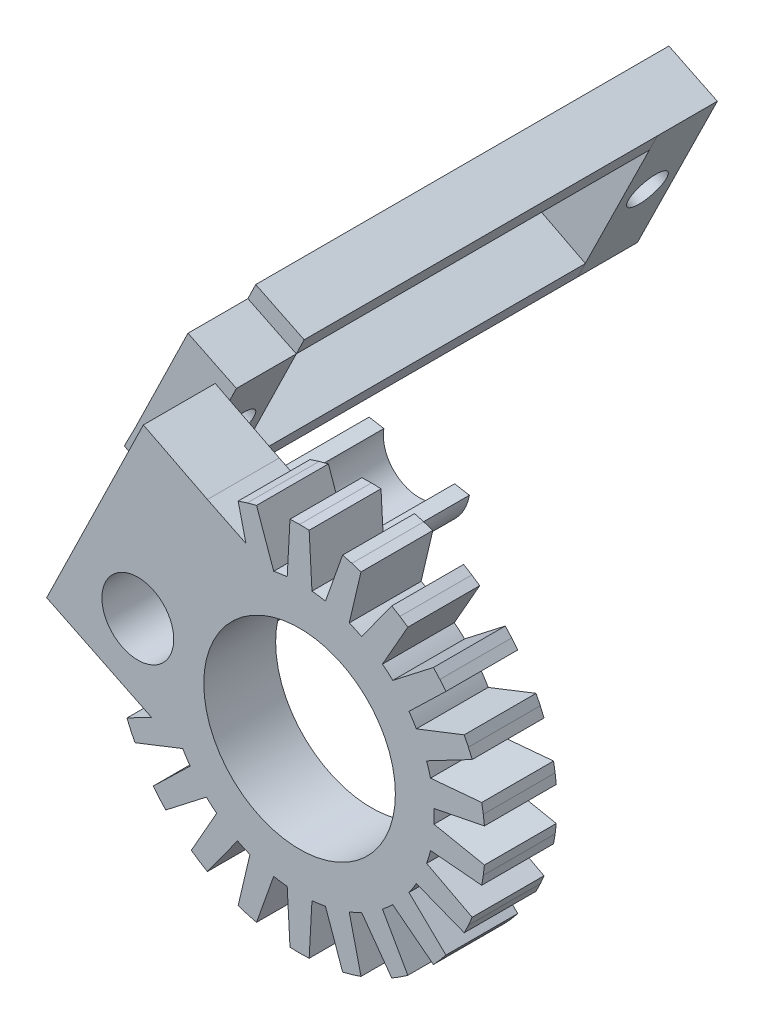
ISO-10303-21;
HEADER;
FILE_DESCRIPTION(('STEP AP214'),'2;1');
FILE_NAME('part.step','',(''),(''),'','','');
FILE_SCHEMA(('AUTOMOTIVE_DESIGN { 1 0 10303 214 1 1 1 1 }'));
ENDSEC;
DATA;
#1=APPLICATION_CONTEXT('core data for automotive mechanical design processes');
#2=APPLICATION_PROTOCOL_DEFINITION('international standard','automotive_design',2000,#1);
#3=PRODUCT_CONTEXT('',#1,'mechanical');
#4=PRODUCT('Part','Part','',(#3));
#5=PRODUCT_RELATED_PRODUCT_CATEGORY('part','',(#4));
#6=PRODUCT_DEFINITION_FORMATION('','',#4);
#7=PRODUCT_DEFINITION_CONTEXT('part definition',#1,'design');
#8=PRODUCT_DEFINITION('design','',#6,#7);
#9=PRODUCT_DEFINITION_SHAPE('','',#8);
#10=(LENGTH_UNIT() NAMED_UNIT(*) SI_UNIT(.MILLI.,.METRE.));
#11=(NAMED_UNIT(*) PLANE_ANGLE_UNIT() SI_UNIT($,.RADIAN.));
#12=(NAMED_UNIT(*) SI_UNIT($,.STERADIAN.) SOLID_ANGLE_UNIT());
#13=UNCERTAINTY_MEASURE_WITH_UNIT(LENGTH_MEASURE(1.E-05),#10,'distance_accuracy_value','');
#14=(GEOMETRIC_REPRESENTATION_CONTEXT(3) GLOBAL_UNCERTAINTY_ASSIGNED_CONTEXT((#13)) GLOBAL_UNIT_ASSIGNED_CONTEXT((#10,
#11,#12)) REPRESENTATION_CONTEXT('',''));
#15=CARTESIAN_POINT('',(0.,0.,0.));
#16=DIRECTION('',(0.,0.,1.));
#17=DIRECTION('',(1.,0.,0.));
#18=AXIS2_PLACEMENT_3D('',#15,#16,#17);
#19=CARTESIAN_POINT('',(5.06929326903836,10.4003166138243,-34.5));
#20=DIRECTION('',(-0.43814211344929,-0.898905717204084,0.));
#21=DIRECTION('',(0.898905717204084,-0.43814211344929,0.));
#22=AXIS2_PLACEMENT_3D('',#19,#20,#21);
#23=PLANE('',#22);
#24=DIRECTION('',(0.898905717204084,-0.43814211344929,0.));
#25=VECTOR('',#24,1.);
#26=CARTESIAN_POINT('',(5.06929326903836,10.4003166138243,-5.));
#27=LINE('',#26,#25);
#28=CARTESIAN_POINT('',(-14.6602694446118,20.0168449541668,-5.));
#29=VERTEX_POINT('',#28);
#30=CARTESIAN_POINT('',(-10.6151937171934,18.045205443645,-5.));
#31=VERTEX_POINT('',#30);
#32=EDGE_CURVE('E191',#29,#31,#27,.T.);
#33=ORIENTED_EDGE('',*,*,#32,.T.);
#34=DIRECTION('',(0.,0.,1.));
#35=VECTOR('',#34,1.);
#36=CARTESIAN_POINT('',(-10.6151937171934,18.045205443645,-34.5));
#37=LINE('',#36,#35);
#38=CARTESIAN_POINT('',(-10.6151937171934,18.045205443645,-34.5));
#39=VERTEX_POINT('',#38);
#40=EDGE_CURVE('E12',#39,#31,#37,.T.);
#41=ORIENTED_EDGE('',*,*,#40,.F.);
#42=DIRECTION('',(0.,0.,1.));
#43=VECTOR('',#42,1.);
#44=CARTESIAN_POINT('',(-10.6151937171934,18.045205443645,-39.5));
#45=LINE('',#44,#43);
#46=CARTESIAN_POINT('',(-10.6151937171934,18.045205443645,-39.5));
#47=VERTEX_POINT('',#46);
#48=EDGE_CURVE('E187',#47,#39,#45,.T.);
#49=ORIENTED_EDGE('',*,*,#48,.F.);
#50=DIRECTION('',(0.898905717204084,-0.43814211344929,0.));
#51=VECTOR('',#50,1.);
#52=CARTESIAN_POINT('',(-10.6151937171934,18.045205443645,-39.5));
#53=LINE('',#52,#51);
#54=CARTESIAN_POINT('',(-14.6602694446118,20.0168449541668,-39.5));
#55=VERTEX_POINT('',#54);
#56=EDGE_CURVE('E231',#55,#47,#53,.T.);
#57=ORIENTED_EDGE('',*,*,#56,.F.);
#58=DIRECTION('',(0.,0.,1.));
#59=VECTOR('',#58,1.);
#60=CARTESIAN_POINT('',(-14.6602694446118,20.0168449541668,-39.5));
#61=LINE('',#60,#59);
#62=CARTESIAN_POINT('',(-14.6602694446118,20.0168449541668,-34.5));
#63=VERTEX_POINT('',#62);
#64=EDGE_CURVE('E193',#55,#63,#61,.T.);
#65=ORIENTED_EDGE('',*,*,#64,.T.);
#66=DIRECTION('',(0.,0.,1.));
#67=VECTOR('',#66,1.);
#68=CARTESIAN_POINT('',(-14.6602694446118,20.0168449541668,-34.5));
#69=LINE('',#68,#67);
#70=EDGE_CURVE('E62',#63,#29,#69,.T.);
#71=ORIENTED_EDGE('',*,*,#70,.T.);
#72=EDGE_LOOP('',(#33,#41,#49,#57,#65,#71));
#73=FACE_BOUND('',#72,.T.);
#74=ADVANCED_FACE('F45',(#73),#23,.F.);
#75=CARTESIAN_POINT('',(-15.6844869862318,7.64488882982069,-34.5));
#76=DIRECTION('',(-0.898905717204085,0.43814211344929,0.));
#77=DIRECTION('',(-0.43814211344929,-0.898905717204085,0.));
#78=AXIS2_PLACEMENT_3D('',#75,#76,#77);
#79=PLANE('',#78);
#80=DIRECTION('',(-0.43814211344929,-0.898905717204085,0.));
#81=VECTOR('',#80,1.);
#82=CARTESIAN_POINT('',(-15.6844869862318,7.64488882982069,-5.));
#83=LINE('',#82,#81);
#84=CARTESIAN_POINT('',(-11.2724068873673,16.6968468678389,-5.));
#85=VERTEX_POINT('',#84);
#86=EDGE_CURVE('E206',#31,#85,#83,.T.);
#87=ORIENTED_EDGE('',*,*,#86,.T.);
#88=DIRECTION('',(0.,0.,1.));
#89=VECTOR('',#88,1.);
#90=CARTESIAN_POINT('',(-11.2724068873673,16.6968468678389,-34.5));
#91=LINE('',#90,#89);
#92=CARTESIAN_POINT('',(-11.2724068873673,16.6968468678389,-34.5));
#93=VERTEX_POINT('',#92);
#94=EDGE_CURVE('E54',#93,#85,#91,.T.);
#95=ORIENTED_EDGE('',*,*,#94,.F.);
#96=DIRECTION('',(-0.43814211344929,-0.898905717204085,0.));
#97=VECTOR('',#96,1.);
#98=CARTESIAN_POINT('',(-15.6844869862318,7.64488882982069,-34.5));
#99=LINE('',#98,#97);
#100=EDGE_CURVE('E197',#39,#93,#99,.T.);
#101=ORIENTED_EDGE('',*,*,#100,.F.);
#102=ORIENTED_EDGE('',*,*,#40,.T.);
#103=EDGE_LOOP('',(#87,#95,#101,#102));
#104=FACE_BOUND('',#103,.T.);
#105=ADVANCED_FACE('F220',(#104),#79,.F.);
#106=CARTESIAN_POINT('',(4.41208009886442,9.05195803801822,-34.5));
#107=DIRECTION('',(-0.43814211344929,-0.898905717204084,0.));
#108=DIRECTION('',(0.898905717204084,-0.43814211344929,0.));
#109=AXIS2_PLACEMENT_3D('',#106,#107,#108);
#110=PLANE('',#109);
#111=DIRECTION('',(0.898905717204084,-0.43814211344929,0.));
#112=VECTOR('',#111,1.);
#113=CARTESIAN_POINT('',(4.41208009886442,9.05195803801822,-5.));
#114=LINE('',#113,#112);
#115=CARTESIAN_POINT('',(-15.3174826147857,18.6684863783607,-5.));
#116=VERTEX_POINT('',#115);
#117=EDGE_CURVE('E209',#116,#85,#114,.T.);
#118=ORIENTED_EDGE('',*,*,#117,.F.);
#119=DIRECTION('',(0.,0.,1.));
#120=VECTOR('',#119,1.);
#121=CARTESIAN_POINT('',(-15.3174826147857,18.6684863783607,-34.5));
#122=LINE('',#121,#120);
#123=CARTESIAN_POINT('',(-15.3174826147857,18.6684863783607,-34.5));
#124=VERTEX_POINT('',#123);
#125=EDGE_CURVE('E77',#124,#116,#122,.T.);
#126=ORIENTED_EDGE('',*,*,#125,.F.);
#127=DIRECTION('',(0.898905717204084,-0.43814211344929,0.));
#128=VECTOR('',#127,1.);
#129=CARTESIAN_POINT('',(4.41208009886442,9.05195803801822,-34.5));
#130=LINE('',#129,#128);
#131=CARTESIAN_POINT('',(-11.2777175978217,16.6994353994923,-34.5));
#132=VERTEX_POINT('',#131);
#133=EDGE_CURVE('E200',#124,#132,#130,.T.);
#134=ORIENTED_EDGE('',*,*,#133,.T.);
#135=EDGE_CURVE('E199',#132,#93,#130,.T.);
#136=ORIENTED_EDGE('',*,*,#135,.T.);
#137=ORIENTED_EDGE('',*,*,#94,.T.);
#138=EDGE_LOOP('',(#118,#126,#134,#136,#137));
#139=FACE_BOUND('',#138,.T.);
#140=ADVANCED_FACE('F218',(#139),#110,.T.);
#141=CARTESIAN_POINT('',(-19.7295627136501,9.61652834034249,-34.5));
#142=DIRECTION('',(0.898905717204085,-0.43814211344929,0.));
#143=DIRECTION('',(0.43814211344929,0.898905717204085,0.));
#144=AXIS2_PLACEMENT_3D('',#141,#142,#143);
#145=PLANE('',#144);
#146=DIRECTION('',(0.43814211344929,0.898905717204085,0.));
#147=VECTOR('',#146,1.);
#148=CARTESIAN_POINT('',(-19.7295627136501,9.61652834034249,-5.));
#149=LINE('',#148,#147);
#150=EDGE_CURVE('E80',#116,#29,#149,.T.);
#151=ORIENTED_EDGE('',*,*,#150,.T.);
#152=ORIENTED_EDGE('',*,*,#70,.F.);
#153=DIRECTION('',(0.43814211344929,0.898905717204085,0.));
#154=VECTOR('',#153,1.);
#155=CARTESIAN_POINT('',(-19.7295627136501,9.61652834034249,-34.5));
#156=LINE('',#155,#154);
#157=EDGE_CURVE('E202',#124,#63,#156,.T.);
#158=ORIENTED_EDGE('',*,*,#157,.F.);
#159=ORIENTED_EDGE('',*,*,#125,.T.);
#160=EDGE_LOOP('',(#151,#152,#158,#159));
#161=FACE_BOUND('',#160,.T.);
#162=ADVANCED_FACE('F288',(#161),#145,.F.);
#163=CARTESIAN_POINT('',(0.,0.,-34.5));
#164=DIRECTION('',(0.,0.,-1.));
#165=DIRECTION('',(-1.,0.,0.));
#166=AXIS2_PLACEMENT_3D('',#163,#164,#165);
#167=PLANE('',#166);
#168=DIRECTION('',(-0.441679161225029,-0.897173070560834,0.));
#169=VECTOR('',#168,1.);
#170=CARTESIAN_POINT('',(-17.286114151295,4.49471292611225,-34.5));
#171=LINE('',#170,#169);
#172=EDGE_CURVE('E87',#39,#132,#171,.T.);
#173=ORIENTED_EDGE('',*,*,#172,.F.);
#174=ORIENTED_EDGE('',*,*,#100,.T.);
#175=ORIENTED_EDGE('',*,*,#135,.F.);
#176=EDGE_LOOP('',(#173,#174,#175));
#177=FACE_BOUND('',#176,.T.);
#178=ADVANCED_FACE('F293',(#177),#167,.T.);
#179=CARTESIAN_POINT('',(0.,0.,-5.));
#180=DIRECTION('',(0.,0.,-1.));
#181=DIRECTION('',(-1.,0.,0.));
#182=AXIS2_PLACEMENT_3D('',#179,#180,#181);
#183=PLANE('',#182);
#184=ORIENTED_EDGE('',*,*,#32,.F.);
#185=ORIENTED_EDGE('',*,*,#150,.F.);
#186=ORIENTED_EDGE('',*,*,#117,.T.);
#187=ORIENTED_EDGE('',*,*,#86,.F.);
#188=EDGE_LOOP('',(#184,#185,#186,#187));
#189=FACE_BOUND('',#188,.T.);
#190=ADVANCED_FACE('F224',(#189),#183,.F.);
#191=CARTESIAN_POINT('',(0.,0.,-34.5));
#192=DIRECTION('',(0.,0.,1.));
#193=DIRECTION('',(1.,0.,0.));
#194=AXIS2_PLACEMENT_3D('',#191,#192,#193);
#195=PLANE('',#194);
#196=DIRECTION('',(-0.448814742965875,-0.893624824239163,0.));
#197=VECTOR('',#196,1.);
#198=CARTESIAN_POINT('',(-19.6281065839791,9.85803367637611,-34.5));
#199=LINE('',#198,#197);
#200=CARTESIAN_POINT('',(-20.6342037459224,7.85481650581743,-34.5));
#201=VERTEX_POINT('',#200);
#202=CARTESIAN_POINT('',(-21.2502622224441,6.62819648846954,-34.5));
#203=VERTEX_POINT('',#202);
#204=EDGE_CURVE('E259',#201,#203,#199,.T.);
#205=ORIENTED_EDGE('',*,*,#204,.F.);
#206=DIRECTION('',(-0.889896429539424,0.456162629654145,0.));
#207=VECTOR('',#206,1.);
#208=CARTESIAN_POINT('',(-1.10509022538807,-2.15584482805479,-34.5));
#209=LINE('',#208,#207);
#210=CARTESIAN_POINT('',(-16.639909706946,5.80733366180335,-34.5));
#211=VERTEX_POINT('',#210);
#212=EDGE_CURVE('E258',#211,#201,#209,.T.);
#213=ORIENTED_EDGE('',*,*,#212,.F.);
#214=EDGE_CURVE('E183',#132,#211,#171,.T.);
#215=ORIENTED_EDGE('',*,*,#214,.F.);
#216=ORIENTED_EDGE('',*,*,#133,.F.);
#217=ORIENTED_EDGE('',*,*,#157,.T.);
#218=DIRECTION('',(0.441611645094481,0.897206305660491,0.));
#219=VECTOR('',#218,1.);
#220=CARTESIAN_POINT('',(-14.6602694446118,20.0168449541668,-34.5));
#221=LINE('',#220,#219);
#222=EDGE_CURVE('E148',#203,#63,#221,.T.);
#223=ORIENTED_EDGE('',*,*,#222,.F.);
#224=EDGE_LOOP('',(#205,#213,#215,#216,#217,#223));
#225=FACE_BOUND('',#224,.T.);
#226=ADVANCED_FACE('F296',(#225),#195,.T.);
#227=CARTESIAN_POINT('',(-17.286114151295,4.49471292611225,-39.5));
#228=DIRECTION('',(-0.897173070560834,0.441679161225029,0.));
#229=DIRECTION('',(-0.441679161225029,-0.897173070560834,0.));
#230=AXIS2_PLACEMENT_3D('',#227,#228,#229);
#231=PLANE('',#230);
#232=CARTESIAN_POINT('',(-13.954733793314,11.2616718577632,-37.));
#233=DIRECTION('',(0.897173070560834,-0.441679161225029,0.));
#234=DIRECTION('',(0.441679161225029,0.897173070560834,0.));
#235=AXIS2_PLACEMENT_3D('',#232,#233,#234);
#236=CIRCLE('',#235,1.6);
#237=CARTESIAN_POINT('',(-13.248047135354,12.6971487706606,-37.));
#238=VERTEX_POINT('',#237);
#239=EDGE_CURVE('E261',#238,#238,#236,.T.);
#240=ORIENTED_EDGE('',*,*,#239,.F.);
#241=EDGE_LOOP('',(#240));
#242=FACE_BOUND('',#241,.T.);
#243=ORIENTED_EDGE('',*,*,#172,.T.);
#244=ORIENTED_EDGE('',*,*,#214,.T.);
#245=DIRECTION('',(-0.441679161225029,-0.897173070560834,0.));
#246=VECTOR('',#245,1.);
#247=CARTESIAN_POINT('',(-17.286114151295,4.49471292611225,-34.5));
#248=LINE('',#247,#246);
#249=CARTESIAN_POINT('',(-17.286114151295,4.49471292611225,-34.5));
#250=VERTEX_POINT('',#249);
#251=EDGE_CURVE('E163',#211,#250,#248,.T.);
#252=ORIENTED_EDGE('',*,*,#251,.T.);
#253=DIRECTION('',(0.,0.,1.));
#254=VECTOR('',#253,1.);
#255=CARTESIAN_POINT('',(-17.286114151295,4.49471292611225,-39.5));
#256=LINE('',#255,#254);
#257=CARTESIAN_POINT('',(-17.286114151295,4.49471292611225,-39.5));
#258=VERTEX_POINT('',#257);
#259=EDGE_CURVE('E180',#258,#250,#256,.T.);
#260=ORIENTED_EDGE('',*,*,#259,.F.);
#261=DIRECTION('',(-0.441679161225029,-0.897173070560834,0.));
#262=VECTOR('',#261,1.);
#263=CARTESIAN_POINT('',(-17.286114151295,4.49471292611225,-39.5));
#264=LINE('',#263,#262);
#265=EDGE_CURVE('E241',#47,#258,#264,.T.);
#266=ORIENTED_EDGE('',*,*,#265,.F.);
#267=ORIENTED_EDGE('',*,*,#48,.T.);
#268=EDGE_LOOP('',(#243,#244,#252,#260,#266,#267));
#269=FACE_BOUND('',#268,.T.);
#270=ADVANCED_FACE('F179',(#242,#269),#231,.F.);
#271=CARTESIAN_POINT('',(-21.2502622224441,6.62819648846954,-39.5));
#272=DIRECTION('',(0.473917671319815,0.88056915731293,0.));
#273=DIRECTION('',(-0.88056915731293,0.473917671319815,0.));
#274=AXIS2_PLACEMENT_3D('',#271,#272,#273);
#275=PLANE('',#274);
#276=DIRECTION('',(-0.88056915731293,0.473917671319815,0.));
#277=VECTOR('',#276,1.);
#278=CARTESIAN_POINT('',(-21.2502622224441,6.62819648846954,-34.5));
#279=LINE('',#278,#277);
#280=EDGE_CURVE('E138',#250,#203,#279,.T.);
#281=ORIENTED_EDGE('',*,*,#280,.T.);
#282=DIRECTION('',(0.,0.,1.));
#283=VECTOR('',#282,1.);
#284=CARTESIAN_POINT('',(-21.2502622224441,6.62819648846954,-39.5));
#285=LINE('',#284,#283);
#286=CARTESIAN_POINT('',(-21.2502622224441,6.62819648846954,-39.5));
#287=VERTEX_POINT('',#286);
#288=EDGE_CURVE('E188',#287,#203,#285,.T.);
#289=ORIENTED_EDGE('',*,*,#288,.F.);
#290=DIRECTION('',(-0.88056915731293,0.473917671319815,0.));
#291=VECTOR('',#290,1.);
#292=CARTESIAN_POINT('',(-21.2502622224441,6.62819648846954,-39.5));
#293=LINE('',#292,#291);
#294=EDGE_CURVE('E186',#258,#287,#293,.T.);
#295=ORIENTED_EDGE('',*,*,#294,.F.);
#296=ORIENTED_EDGE('',*,*,#259,.T.);
#297=EDGE_LOOP('',(#281,#289,#295,#296));
#298=FACE_BOUND('',#297,.T.);
#299=ADVANCED_FACE('F185',(#298),#275,.F.);
#300=CARTESIAN_POINT('',(-14.6602694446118,20.0168449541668,-39.5));
#301=DIRECTION('',(0.897206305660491,-0.441611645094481,0.));
#302=DIRECTION('',(0.441611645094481,0.897206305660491,0.));
#303=AXIS2_PLACEMENT_3D('',#300,#301,#302);
#304=PLANE('',#303);
#305=CARTESIAN_POINT('',(-17.9914720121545,13.2489619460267,-37.));
#306=DIRECTION('',(0.897206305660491,-0.441611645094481,0.));
#307=DIRECTION('',(-0.441611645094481,-0.897206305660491,0.));
#308=AXIS2_PLACEMENT_3D('',#305,#306,#307);
#309=ELLIPSE('',#308,1.6000000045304,1.6);
#310=CARTESIAN_POINT('',(-18.6980506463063,11.8134318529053,-37.));
#311=VERTEX_POINT('',#310);
#312=EDGE_CURVE('E48',#311,#311,#309,.T.);
#313=ORIENTED_EDGE('',*,*,#312,.T.);
#314=EDGE_LOOP('',(#313));
#315=FACE_BOUND('',#314,.T.);
#316=ORIENTED_EDGE('',*,*,#222,.T.);
#317=ORIENTED_EDGE('',*,*,#64,.F.);
#318=DIRECTION('',(0.441611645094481,0.897206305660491,0.));
#319=VECTOR('',#318,1.);
#320=CARTESIAN_POINT('',(-14.6602694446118,20.0168449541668,-39.5));
#321=LINE('',#320,#319);
#322=EDGE_CURVE('E235',#287,#55,#321,.T.);
#323=ORIENTED_EDGE('',*,*,#322,.F.);
#324=ORIENTED_EDGE('',*,*,#288,.T.);
#325=EDGE_LOOP('',(#316,#317,#323,#324));
#326=FACE_BOUND('',#325,.T.);
#327=ADVANCED_FACE('F268',(#315,#326),#304,.F.);
#328=CARTESIAN_POINT('',(0.,0.,-39.5));
#329=DIRECTION('',(0.,0.,1.));
#330=DIRECTION('',(1.,0.,0.));
#331=AXIS2_PLACEMENT_3D('',#328,#329,#330);
#332=PLANE('',#331);
#333=ORIENTED_EDGE('',*,*,#56,.T.);
#334=ORIENTED_EDGE('',*,*,#265,.T.);
#335=ORIENTED_EDGE('',*,*,#294,.T.);
#336=ORIENTED_EDGE('',*,*,#322,.T.);
#337=EDGE_LOOP('',(#333,#334,#335,#336));
#338=FACE_BOUND('',#337,.T.);
#339=ADVANCED_FACE('F306',(#338),#332,.F.);
#340=CARTESIAN_POINT('',(0.,0.,-34.5));
#341=DIRECTION('',(0.,0.,-1.));
#342=DIRECTION('',(-1.,0.,0.));
#343=AXIS2_PLACEMENT_3D('',#340,#341,#342);
#344=PLANE('',#343);
#345=ORIENTED_EDGE('',*,*,#251,.F.);
#346=CARTESIAN_POINT('',(-16.6295338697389,5.80201498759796,-34.5));
#347=VERTEX_POINT('',#346);
#348=EDGE_CURVE('E170',#347,#211,#209,.T.);
#349=ORIENTED_EDGE('',*,*,#348,.F.);
#350=DIRECTION('',(0.448814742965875,0.893624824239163,0.));
#351=VECTOR('',#350,1.);
#352=CARTESIAN_POINT('',(-15.6067948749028,7.83836733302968,-34.5));
#353=LINE('',#352,#351);
#354=EDGE_CURVE('E156',#250,#347,#353,.T.);
#355=ORIENTED_EDGE('',*,*,#354,.F.);
#356=EDGE_LOOP('',(#345,#349,#355));
#357=FACE_BOUND('',#356,.T.);
#358=ADVANCED_FACE('F167',(#357),#344,.T.);
#359=ORIENTED_EDGE('',*,*,#280,.F.);
#360=DIRECTION('',(0.893624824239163,-0.448814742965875,0.));
#361=VECTOR('',#360,1.);
#362=CARTESIAN_POINT('',(-1.67931927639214,-3.34365440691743,-34.5));
#363=LINE('',#362,#361);
#364=CARTESIAN_POINT('',(-21.3074258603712,6.51437926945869,-34.5));
#365=VERTEX_POINT('',#364);
#366=EDGE_CURVE('E142',#365,#250,#363,.T.);
#367=ORIENTED_EDGE('',*,*,#366,.F.);
#368=EDGE_CURVE('E143',#203,#365,#199,.T.);
#369=ORIENTED_EDGE('',*,*,#368,.F.);
#370=EDGE_LOOP('',(#359,#367,#369));
#371=FACE_BOUND('',#370,.T.);
#372=ADVANCED_FACE('F140',(#371),#344,.T.);
#373=CARTESIAN_POINT('',(-15.6067948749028,7.83836733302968,-34.5));
#374=DIRECTION('',(0.893624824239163,-0.448814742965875,0.));
#375=DIRECTION('',(0.448814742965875,0.893624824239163,0.));
#376=AXIS2_PLACEMENT_3D('',#373,#374,#375);
#377=PLANE('',#376);
#378=DIRECTION('',(0.448814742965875,0.893624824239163,0.));
#379=VECTOR('',#378,1.);
#380=CARTESIAN_POINT('',(-15.6067948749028,7.83836733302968,-5.));
#381=LINE('',#380,#379);
#382=CARTESIAN_POINT('',(-17.286114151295,4.49471292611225,-5.));
#383=VERTEX_POINT('',#382);
#384=CARTESIAN_POINT('',(-16.6295338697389,5.80201498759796,-5.));
#385=VERTEX_POINT('',#384);
#386=EDGE_CURVE('E159',#383,#385,#381,.T.);
#387=ORIENTED_EDGE('',*,*,#386,.F.);
#388=DIRECTION('',(0.,0.,1.));
#389=VECTOR('',#388,1.);
#390=CARTESIAN_POINT('',(-17.286114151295,4.49471292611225,-34.5));
#391=LINE('',#390,#389);
#392=EDGE_CURVE('E153',#250,#383,#391,.T.);
#393=ORIENTED_EDGE('',*,*,#392,.F.);
#394=ORIENTED_EDGE('',*,*,#354,.T.);
#395=DIRECTION('',(0.,0.,1.));
#396=VECTOR('',#395,1.);
#397=CARTESIAN_POINT('',(-16.6295338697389,5.80201498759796,-34.5));
#398=LINE('',#397,#396);
#399=EDGE_CURVE('E247',#347,#385,#398,.T.);
#400=ORIENTED_EDGE('',*,*,#399,.T.);
#401=EDGE_LOOP('',(#387,#393,#394,#400));
#402=FACE_BOUND('',#401,.T.);
#403=ADVANCED_FACE('F155',(#402),#377,.T.);
#404=CARTESIAN_POINT('',(-1.67931927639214,-3.34365440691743,-34.5));
#405=DIRECTION('',(-0.448814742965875,-0.893624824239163,0.));
#406=DIRECTION('',(0.893624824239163,-0.448814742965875,0.));
#407=AXIS2_PLACEMENT_3D('',#404,#405,#406);
#408=PLANE('',#407);
#409=DIRECTION('',(0.893624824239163,-0.448814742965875,0.));
#410=VECTOR('',#409,1.);
#411=CARTESIAN_POINT('',(-1.67931927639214,-3.34365440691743,-5.));
#412=LINE('',#411,#410);
#413=CARTESIAN_POINT('',(-21.3074258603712,6.51437926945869,-5.));
#414=VERTEX_POINT('',#413);
#415=EDGE_CURVE('E254',#414,#383,#412,.T.);
#416=ORIENTED_EDGE('',*,*,#415,.F.);
#417=DIRECTION('',(0.,0.,1.));
#418=VECTOR('',#417,1.);
#419=CARTESIAN_POINT('',(-21.3074258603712,6.51437926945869,-34.5));
#420=LINE('',#419,#418);
#421=EDGE_CURVE('E164',#365,#414,#420,.T.);
#422=ORIENTED_EDGE('',*,*,#421,.F.);
#423=ORIENTED_EDGE('',*,*,#366,.T.);
#424=ORIENTED_EDGE('',*,*,#392,.T.);
#425=EDGE_LOOP('',(#416,#422,#423,#424));
#426=FACE_BOUND('',#425,.T.);
#427=ADVANCED_FACE('F174',(#426),#408,.T.);
#428=CARTESIAN_POINT('',(-19.6281065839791,9.85803367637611,-34.5));
#429=DIRECTION('',(-0.893624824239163,0.448814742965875,0.));
#430=DIRECTION('',(-0.448814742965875,-0.893624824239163,0.));
#431=AXIS2_PLACEMENT_3D('',#428,#429,#430);
#432=PLANE('',#431);
#433=DIRECTION('',(-0.448814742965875,-0.893624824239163,0.));
#434=VECTOR('',#433,1.);
#435=CARTESIAN_POINT('',(-19.6281065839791,9.85803367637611,-5.));
#436=LINE('',#435,#434);
#437=CARTESIAN_POINT('',(-20.6342037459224,7.85481650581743,-5.));
#438=VERTEX_POINT('',#437);
#439=EDGE_CURVE('E251',#438,#414,#436,.T.);
#440=ORIENTED_EDGE('',*,*,#439,.F.);
#441=DIRECTION('',(0.,0.,1.));
#442=VECTOR('',#441,1.);
#443=CARTESIAN_POINT('',(-20.6342037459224,7.85481650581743,-34.5));
#444=LINE('',#443,#442);
#445=EDGE_CURVE('E245',#201,#438,#444,.T.);
#446=ORIENTED_EDGE('',*,*,#445,.F.);
#447=ORIENTED_EDGE('',*,*,#204,.T.);
#448=ORIENTED_EDGE('',*,*,#368,.T.);
#449=ORIENTED_EDGE('',*,*,#421,.T.);
#450=EDGE_LOOP('',(#440,#446,#447,#448,#449));
#451=FACE_BOUND('',#450,.T.);
#452=ADVANCED_FACE('F317',(#451),#432,.T.);
#453=CARTESIAN_POINT('',(-1.10509022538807,-2.15584482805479,-34.5));
#454=DIRECTION('',(0.456162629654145,0.889896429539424,0.));
#455=DIRECTION('',(-0.889896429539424,0.456162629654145,0.));
#456=AXIS2_PLACEMENT_3D('',#453,#454,#455);
#457=PLANE('',#456);
#458=DIRECTION('',(-0.889896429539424,0.456162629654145,0.));
#459=VECTOR('',#458,1.);
#460=CARTESIAN_POINT('',(-1.10509022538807,-2.15584482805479,-5.));
#461=LINE('',#460,#459);
#462=EDGE_CURVE('E171',#385,#438,#461,.T.);
#463=ORIENTED_EDGE('',*,*,#462,.F.);
#464=ORIENTED_EDGE('',*,*,#399,.F.);
#465=ORIENTED_EDGE('',*,*,#348,.T.);
#466=ORIENTED_EDGE('',*,*,#212,.T.);
#467=ORIENTED_EDGE('',*,*,#445,.T.);
#468=EDGE_LOOP('',(#463,#464,#465,#466,#467));
#469=FACE_BOUND('',#468,.T.);
#470=ADVANCED_FACE('F277',(#469),#457,.T.);
#471=CARTESIAN_POINT('',(0.,0.,-5.));
#472=DIRECTION('',(0.,0.,-1.));
#473=DIRECTION('',(-1.,0.,0.));
#474=AXIS2_PLACEMENT_3D('',#471,#472,#473);
#475=PLANE('',#474);
#476=ORIENTED_EDGE('',*,*,#386,.T.);
#477=ORIENTED_EDGE('',*,*,#462,.T.);
#478=ORIENTED_EDGE('',*,*,#439,.T.);
#479=ORIENTED_EDGE('',*,*,#415,.T.);
#480=EDGE_LOOP('',(#476,#477,#478,#479));
#481=FACE_BOUND('',#480,.T.);
#482=ADVANCED_FACE('F272',(#481),#475,.F.);
#483=CARTESIAN_POINT('',(-18.4405991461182,13.4700676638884,-37.));
#484=DIRECTION('',(0.897173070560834,-0.441679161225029,0.));
#485=DIRECTION('',(0.441679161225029,0.897173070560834,0.));
#486=AXIS2_PLACEMENT_3D('',#483,#484,#485);
#487=CYLINDRICAL_SURFACE('',#486,1.6);
#488=ORIENTED_EDGE('',*,*,#239,.T.);
#489=EDGE_LOOP('',(#488));
#490=FACE_BOUND('',#489,.T.);
#491=ORIENTED_EDGE('',*,*,#312,.F.);
#492=EDGE_LOOP('',(#491));
#493=FACE_BOUND('',#492,.T.);
#494=ADVANCED_FACE('F270',(#490,#493),#487,.F.);
#495=CLOSED_SHELL('',(#74,#105,#140,#162,#178,#190,#226,#270,#299,#327,#339,#358,#372,#403,#427,
#452,#470,#482,#494));
#496=MANIFOLD_SOLID_BREP('B2',#495);
#497=CARTESIAN_POINT('',(0.,0.,0.));
#498=DIRECTION('',(0.,0.,1.));
#499=DIRECTION('',(1.,0.,0.));
#500=AXIS2_PLACEMENT_3D('',#497,#498,#499);
#501=PLANE('',#500);
#502=CARTESIAN_POINT('',(-13.5060442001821,1.93295208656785,0.));
#503=DIRECTION('',(0.,0.,1.));
#504=DIRECTION('',(1.,0.,0.));
#505=AXIS2_PLACEMENT_3D('',#502,#503,#504);
#506=CIRCLE('',#505,4.25);
#507=CARTESIAN_POINT('',(-9.25604420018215,1.93295208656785,0.));
#508=VERTEX_POINT('',#507);
#509=EDGE_CURVE('E43',#508,#508,#506,.F.);
#510=ORIENTED_EDGE('',*,*,#509,.F.);
#511=EDGE_LOOP('',(#510));
#512=FACE_BOUND('',#511,.T.);
#513=CARTESIAN_POINT('',(0.,0.,0.));
#514=DIRECTION('',(0.,0.,1.));
#515=DIRECTION('',(1.,0.,0.));
#516=AXIS2_PLACEMENT_3D('',#513,#514,#515);
#517=CIRCLE('',#516,8.);
#518=CARTESIAN_POINT('',(8.,0.,0.));
#519=VERTEX_POINT('',#518);
#520=EDGE_CURVE('E1123',#519,#519,#517,.T.);
#521=ORIENTED_EDGE('',*,*,#520,.T.);
#522=EDGE_LOOP('',(#521));
#523=FACE_BOUND('',#522,.T.);
#524=DIRECTION('',(-0.889896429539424,0.456162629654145,0.));
#525=VECTOR('',#524,1.);
#526=CARTESIAN_POINT('',(-20.6342037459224,7.85481650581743,0.));
#527=LINE('',#526,#525);
#528=CARTESIAN_POINT('',(-16.6292182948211,5.80185322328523,0.));
#529=VERTEX_POINT('',#528);
#530=CARTESIAN_POINT('',(-17.8128136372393,6.40856648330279,0.));
#531=VERTEX_POINT('',#530);
#532=EDGE_CURVE('E465',#529,#531,#527,.T.);
#533=ORIENTED_EDGE('',*,*,#532,.F.);
#534=DIRECTION('',(-0.455572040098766,-0.89019891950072,0.));
#535=VECTOR('',#534,1.);
#536=CARTESIAN_POINT('',(-16.6292182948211,5.80185322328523,0.));
#537=LINE('',#536,#535);
#538=CARTESIAN_POINT('',(-15.6538280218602,7.70778969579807,0.));
#539=VERTEX_POINT('',#538);
#540=EDGE_CURVE('E1083',#539,#529,#537,.T.);
#541=ORIENTED_EDGE('',*,*,#540,.F.);
#542=DIRECTION('',(-0.438142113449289,-0.898905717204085,0.));
#543=VECTOR('',#542,1.);
#544=CARTESIAN_POINT('',(-11.2724068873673,16.6968468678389,0.));
#545=LINE('',#544,#543);
#546=CARTESIAN_POINT('',(-11.8288657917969,15.5551988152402,0.));
#547=VERTEX_POINT('',#546);
#548=EDGE_CURVE('E2152',#547,#539,#545,.T.);
#549=ORIENTED_EDGE('',*,*,#548,.F.);
#550=DIRECTION('',(-0.891445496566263,0.453127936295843,0.));
#551=VECTOR('',#550,1.);
#552=CARTESIAN_POINT('',(3.8545882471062,7.58319021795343,0.));
#553=LINE('',#552,#551);
#554=CARTESIAN_POINT('',(-7.69599236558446,13.4544305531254,0.));
#555=VERTEX_POINT('',#554);
#556=EDGE_CURVE('E1387',#555,#547,#553,.T.);
#557=ORIENTED_EDGE('',*,*,#556,.F.);
#558=DIRECTION('',(0.898608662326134,-0.438751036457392,0.));
#559=VECTOR('',#558,1.);
#560=CARTESIAN_POINT('',(3.82311999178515,7.83015527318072,0.));
#561=LINE('',#560,#559);
#562=CARTESIAN_POINT('',(-4.48359460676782,11.8859581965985,0.));
#563=VERTEX_POINT('',#562);
#564=EDGE_CURVE('E1384',#555,#563,#561,.T.);
#565=ORIENTED_EDGE('',*,*,#564,.T.);
#566=DIRECTION('',(-0.228980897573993,0.973430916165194,0.));
#567=VECTOR('',#566,1.);
#568=CARTESIAN_POINT('',(-1.59916421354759,-0.376172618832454,0.));
#569=LINE('',#568,#567);
#570=CARTESIAN_POINT('',(-5.12837695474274,14.6270212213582,0.));
#571=VERTEX_POINT('',#570);
#572=EDGE_CURVE('E1381',#563,#571,#569,.T.);
#573=ORIENTED_EDGE('',*,*,#572,.T.);
#574=DIRECTION('',(-0.951902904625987,-0.306399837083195,0.));
#575=VECTOR('',#574,1.);
#576=CARTESIAN_POINT('',(-4.74761579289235,14.7495811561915,0.));
#577=LINE('',#576,#575);
#578=CARTESIAN_POINT('',(-4.36685463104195,14.8721410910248,0.));
#579=VERTEX_POINT('',#578);
#580=EDGE_CURVE('E1378',#579,#571,#577,.T.);
#581=ORIENTED_EDGE('',*,*,#580,.F.);
#582=DIRECTION('',(0.966443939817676,0.256877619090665,0.));
#583=VECTOR('',#582,1.);
#584=CARTESIAN_POINT('',(-3.98027705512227,14.9748921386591,0.));
#585=LINE('',#584,#583);
#586=CARTESIAN_POINT('',(-3.59369947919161,15.0776431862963,0.));
#587=VERTEX_POINT('',#586);
#588=EDGE_CURVE('E1375',#579,#587,#585,.T.);
#589=ORIENTED_EDGE('',*,*,#588,.T.);
#590=DIRECTION('',(-0.333645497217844,0.942698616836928,0.));
#591=VECTOR('',#590,1.);
#592=CARTESIAN_POINT('',(1.54867681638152,0.548116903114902,0.));
#593=LINE('',#592,#591);
#594=CARTESIAN_POINT('',(-2.16122659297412,11.0302628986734,0.));
#595=VERTEX_POINT('',#594);
#596=EDGE_CURVE('E1372',#595,#587,#593,.T.);
#597=ORIENTED_EDGE('',*,*,#596,.F.);
#598=CARTESIAN_POINT('',(0.,0.,0.));
#599=DIRECTION('',(0.,0.,1.));
#600=DIRECTION('',(1.,0.,0.));
#601=AXIS2_PLACEMENT_3D('',#598,#599,#600);
#602=CIRCLE('',#601,11.2400000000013);
#603=CARTESIAN_POINT('',(-1.0339024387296,11.1923476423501,0.));
#604=VERTEX_POINT('',#603);
#605=EDGE_CURVE('E1369',#604,#595,#602,.T.);
#606=ORIENTED_EDGE('',*,*,#605,.F.);
#607=DIRECTION('',(0.0545416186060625,0.998511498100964,0.));
#608=VECTOR('',#607,1.);
#609=CARTESIAN_POINT('',(-1.64036690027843,0.0896016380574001,0.));
#610=LINE('',#609,#608);
#611=CARTESIAN_POINT('',(-0.799733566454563,15.4793548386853,0.));
#612=VERTEX_POINT('',#611);
#613=EDGE_CURVE('E1366',#604,#612,#610,.T.);
#614=ORIENTED_EDGE('',*,*,#613,.T.);
#615=DIRECTION('',(-0.999666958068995,-0.0258064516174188,0.));
#616=VECTOR('',#615,1.);
#617=CARTESIAN_POINT('',(-0.399866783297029,15.4896774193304,0.));
#618=LINE('',#617,#616);
#619=CARTESIAN_POINT('',(1.75505226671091E-12,15.4999999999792,0.));
#620=VERTEX_POINT('',#619);
#621=EDGE_CURVE('E1363',#620,#612,#618,.T.);
#622=ORIENTED_EDGE('',*,*,#621,.F.);
#623=DIRECTION('',(0.999666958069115,-0.0258064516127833,0.));
#624=VECTOR('',#623,1.);
#625=CARTESIAN_POINT('',(0.399866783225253,15.4896774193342,0.));
#626=LINE('',#625,#624);
#627=CARTESIAN_POINT('',(0.799733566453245,15.4793548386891,0.));
#628=VERTEX_POINT('',#627);
#629=EDGE_CURVE('E1360',#620,#628,#626,.T.);
#630=ORIENTED_EDGE('',*,*,#629,.T.);
#631=DIRECTION('',(-0.0545416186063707,0.998511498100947,0.));
#632=VECTOR('',#631,1.);
#633=CARTESIAN_POINT('',(1.64036690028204,0.0896016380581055,0.));
#634=LINE('',#633,#632);
#635=CARTESIAN_POINT('',(1.03390243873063,11.1923476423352,0.));
#636=VERTEX_POINT('',#635);
#637=EDGE_CURVE('E1128',#636,#628,#634,.T.);
#638=ORIENTED_EDGE('',*,*,#637,.F.);
#639=CARTESIAN_POINT('',(0.,0.,0.));
#640=DIRECTION('',(0.,0.,1.));
#641=DIRECTION('',(1.,0.,0.));
#642=AXIS2_PLACEMENT_3D('',#639,#640,#641);
#643=CIRCLE('',#642,11.2399999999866);
#644=CARTESIAN_POINT('',(2.16122659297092,11.0302628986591,0.));
#645=VERTEX_POINT('',#644);
#646=EDGE_CURVE('E1619',#645,#636,#643,.T.);
#647=ORIENTED_EDGE('',*,*,#646,.F.);
#648=DIRECTION('',(0.33364549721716,0.942698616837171,0.));
#649=VECTOR('',#648,1.);
#650=CARTESIAN_POINT('',(-1.54867681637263,0.548116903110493,0.));
#651=LINE('',#650,#649);
#652=CARTESIAN_POINT('',(3.59369947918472,15.0776431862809,0.));
#653=VERTEX_POINT('',#652);
#654=EDGE_CURVE('E1616',#645,#653,#651,.T.);
#655=ORIENTED_EDGE('',*,*,#654,.T.);
#656=DIRECTION('',(-0.966443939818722,0.256877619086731,0.));
#657=VECTOR('',#656,1.);
#658=CARTESIAN_POINT('',(3.98027705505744,14.9748921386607,0.));
#659=LINE('',#658,#657);
#660=CARTESIAN_POINT('',(4.36685463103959,14.8721410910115,0.));
#661=VERTEX_POINT('',#660);
#662=EDGE_CURVE('E1613',#661,#653,#659,.T.);
#663=ORIENTED_EDGE('',*,*,#662,.F.);
#664=DIRECTION('',(0.951902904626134,-0.30639983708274,0.));
#665=VECTOR('',#664,1.);
#666=CARTESIAN_POINT('',(4.74761579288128,14.7495811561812,0.));
#667=LINE('',#666,#665);
#668=CARTESIAN_POINT('',(5.12837695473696,14.6270212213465,0.));
#669=VERTEX_POINT('',#668);
#670=EDGE_CURVE('E1610',#661,#669,#667,.T.);
#671=ORIENTED_EDGE('',*,*,#670,.T.);
#672=DIRECTION('',(0.228980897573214,0.973430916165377,0.));
#673=VECTOR('',#672,1.);
#674=CARTESIAN_POINT('',(1.59916421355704,-0.376172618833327,0.));
#675=LINE('',#674,#673);
#676=CARTESIAN_POINT('',(4.1452708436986,10.4476949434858,0.));
#677=VERTEX_POINT('',#676);
#678=EDGE_CURVE('E1607',#677,#669,#675,.T.);
#679=ORIENTED_EDGE('',*,*,#678,.F.);
#680=CARTESIAN_POINT('',(0.,0.,0.));
#681=DIRECTION('',(0.,0.,1.));
#682=DIRECTION('',(1.,0.,0.));
#683=AXIS2_PLACEMENT_3D('',#680,#681,#682);
#684=CIRCLE('',#683,11.2399999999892);
#685=CARTESIAN_POINT('',(5.18126589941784,9.97457185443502,0.));
#686=VERTEX_POINT('',#685);
#687=EDGE_CURVE('E1604',#686,#677,#684,.T.);
#688=ORIENTED_EDGE('',*,*,#687,.F.);
#689=DIRECTION('',(0.585719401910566,0.810513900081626,0.));
#690=VECTOR('',#689,1.);
#691=CARTESIAN_POINT('',(-1.33152214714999,0.962226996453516,0.));
#692=LINE('',#691,#690);
#693=CARTESIAN_POINT('',(7.69599236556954,13.4544305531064,0.));
#694=VERTEX_POINT('',#693);
#695=EDGE_CURVE('E1601',#686,#694,#692,.T.);
#696=ORIENTED_EDGE('',*,*,#695,.T.);
#697=DIRECTION('',(-0.854925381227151,0.518750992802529,0.));
#698=VECTOR('',#697,1.);
#699=CARTESIAN_POINT('',(8.03796251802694,13.2469301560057,0.));
#700=LINE('',#699,#698);
#701=CARTESIAN_POINT('',(8.37993267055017,13.0394297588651,0.));
#702=VERTEX_POINT('',#701);
#703=EDGE_CURVE('E1598',#702,#694,#700,.T.);
#704=ORIENTED_EDGE('',*,*,#703,.F.);
#705=DIRECTION('',(0.827021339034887,-0.562170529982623,0.));
#706=VECTOR('',#705,1.);
#707=CARTESIAN_POINT('',(8.71074120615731,12.8145615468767,0.));
#708=LINE('',#707,#706);
#709=CARTESIAN_POINT('',(9.04154974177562,12.5896933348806,0.));
#710=VERTEX_POINT('',#709);
#711=EDGE_CURVE('E1595',#702,#710,#708,.T.);
#712=ORIENTED_EDGE('',*,*,#711,.T.);
#713=DIRECTION('',(0.493952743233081,0.869488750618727,0.));
#714=VECTOR('',#713,1.);
#715=CARTESIAN_POINT('',(1.42840675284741,-0.811471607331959,0.));
#716=LINE('',#715,#714);
#717=CARTESIAN_POINT('',(6.92081405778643,8.85663213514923,0.));
#718=VERTEX_POINT('',#717);
#719=EDGE_CURVE('E1592',#718,#710,#716,.T.);
#720=ORIENTED_EDGE('',*,*,#719,.F.);
#721=CARTESIAN_POINT('',(0.,0.,0.));
#722=DIRECTION('',(0.,0.,1.));
#723=DIRECTION('',(1.,0.,0.));
#724=AXIS2_PLACEMENT_3D('',#721,#722,#723);
#725=CIRCLE('',#724,11.2399999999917);
#726=CARTESIAN_POINT('',(7.78154985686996,8.11080031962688,0.));
#727=VERTEX_POINT('',#726);
#728=EDGE_CURVE('E1589',#727,#718,#725,.T.);
#729=ORIENTED_EDGE('',*,*,#728,.F.);
#730=DIRECTION('',(0.790341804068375,0.612666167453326,0.));
#731=VECTOR('',#730,1.);
#732=CARTESIAN_POINT('',(-1.00649547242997,1.29838318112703,0.));
#733=LINE('',#732,#731);
#734=CARTESIAN_POINT('',(11.1748017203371,10.7412199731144,0.));
#735=VERTEX_POINT('',#734);
#736=EDGE_CURVE('E1586',#727,#735,#733,.T.);
#737=ORIENTED_EDGE('',*,*,#736,.T.);
#738=DIRECTION('',(-0.674145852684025,0.738598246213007,0.));
#739=VECTOR('',#738,1.);
#740=CARTESIAN_POINT('',(11.4444600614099,10.44578067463,0.));
#741=LINE('',#740,#739);
#742=CARTESIAN_POINT('',(11.7141184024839,10.1503413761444,0.));
#743=VERTEX_POINT('',#742);
#744=EDGE_CURVE('E1583',#743,#735,#741,.T.);
#745=ORIENTED_EDGE('',*,*,#744,.F.);
#746=DIRECTION('',(0.635139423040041,-0.772397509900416,0.));
#747=VECTOR('',#746,1.);
#748=CARTESIAN_POINT('',(11.9681741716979,9.84138237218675,0.));
#749=LINE('',#748,#747);
#750=CARTESIAN_POINT('',(12.2222299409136,9.53242336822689,0.));
#751=VERTEX_POINT('',#750);
#752=EDGE_CURVE('E1580',#743,#751,#749,.T.);
#753=ORIENTED_EDGE('',*,*,#752,.T.);
#754=DIRECTION('',(0.718907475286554,0.695105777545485,0.));
#755=VECTOR('',#754,1.);
#756=CARTESIAN_POINT('',(1.14192827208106,-1.18102999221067,0.));
#757=LINE('',#756,#755);
#758=CARTESIAN_POINT('',(9.13567407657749,6.54805766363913,0.));
#759=VERTEX_POINT('',#758);
#760=EDGE_CURVE('E1577',#759,#751,#757,.T.);
#761=ORIENTED_EDGE('',*,*,#760,.F.);
#762=CARTESIAN_POINT('',(0.,0.,0.));
#763=DIRECTION('',(0.,0.,1.));
#764=DIRECTION('',(1.,0.,0.));
#765=AXIS2_PLACEMENT_3D('',#762,#763,#764);
#766=CIRCLE('',#765,11.2399999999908);
#767=CARTESIAN_POINT('',(9.75141892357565,5.58993997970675,0.));
#768=VERTEX_POINT('',#767);
#769=EDGE_CURVE('E1574',#768,#759,#766,.T.);
#770=ORIENTED_EDGE('',*,*,#769,.F.);
#771=DIRECTION('',(0.930935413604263,0.365183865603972,0.));
#772=VECTOR('',#771,1.);
#773=CARTESIAN_POINT('',(-0.599928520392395,1.52935208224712,0.));
#774=LINE('',#773,#772);
#775=CARTESIAN_POINT('',(13.7482950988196,7.15781963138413,0.));
#776=VERTEX_POINT('',#775);
#777=EDGE_CURVE('E1571',#768,#776,#774,.T.);
#778=ORIENTED_EDGE('',*,*,#777,.T.);
#779=DIRECTION('',(-0.43875103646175,0.898608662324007,0.));
#780=VECTOR('',#779,1.);
#781=CARTESIAN_POINT('',(13.9237955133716,6.79837616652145,0.));
#782=LINE('',#781,#780);
#783=CARTESIAN_POINT('',(14.0992959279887,6.43893270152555,0.));
#784=VERTEX_POINT('',#783);
#785=EDGE_CURVE('E1568',#784,#776,#782,.T.);
#786=ORIENTED_EDGE('',*,*,#785,.F.);
#787=DIRECTION('',(0.391802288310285,-0.920049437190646,0.));
#788=VECTOR('',#787,1.);
#789=CARTESIAN_POINT('',(14.2560168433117,6.07091292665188,0.));
#790=LINE('',#789,#788);
#791=CARTESIAN_POINT('',(14.4127377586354,5.70289315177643,0.));
#792=VERTEX_POINT('',#791);
#793=EDGE_CURVE('E1565',#784,#792,#790,.T.);
#794=ORIENTED_EDGE('',*,*,#793,.T.);
#795=DIRECTION('',(0.885620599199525,0.464409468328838,0.));
#796=VECTOR('',#795,1.);
#797=CARTESIAN_POINT('',(0.762937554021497,-1.45490835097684,0.));
#798=LINE('',#797,#796);
#799=CARTESIAN_POINT('',(10.6104161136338,3.70899850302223,0.));
#800=VERTEX_POINT('',#799);
#801=EDGE_CURVE('E1562',#800,#792,#798,.T.);
#802=ORIENTED_EDGE('',*,*,#801,.F.);
#803=CARTESIAN_POINT('',(0.,0.,0.));
#804=DIRECTION('',(0.,0.,1.));
#805=DIRECTION('',(1.,0.,0.));
#806=AXIS2_PLACEMENT_3D('',#803,#804,#805);
#807=CIRCLE('',#806,11.2399999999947);
#808=CARTESIAN_POINT('',(10.931286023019,2.61621594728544,0.));
#809=VERTEX_POINT('',#808);
#810=EDGE_CURVE('E1559',#809,#800,#807,.T.);
#811=ORIENTED_EDGE('',*,*,#810,.F.);
#812=DIRECTION('',(0.99611017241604,0.0881165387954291,0.));
#813=VECTOR('',#812,1.);
#814=CARTESIAN_POINT('',(-0.144758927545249,1.63642197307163,0.));
#815=LINE('',#814,#813);
#816=CARTESIAN_POINT('',(15.2079833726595,2.99453531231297,0.));
#817=VERTEX_POINT('',#816);
#818=EDGE_CURVE('E1556',#809,#817,#815,.T.);
#819=ORIENTED_EDGE('',*,*,#818,.T.);
#820=DIRECTION('',(-0.167811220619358,0.985819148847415,0.));
#821=VECTOR('',#820,1.);
#822=CARTESIAN_POINT('',(15.2751078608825,2.6002076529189,0.));
#823=LINE('',#822,#821);
#824=CARTESIAN_POINT('',(15.3422323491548,2.20587999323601,0.));
#825=VERTEX_POINT('',#824);
#826=EDGE_CURVE('E1553',#825,#817,#823,.T.);
#827=ORIENTED_EDGE('',*,*,#826,.F.);
#828=DIRECTION('',(0.116723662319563,-0.993164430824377,0.));
#829=VECTOR('',#828,1.);
#830=CARTESIAN_POINT('',(15.3889218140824,1.80861422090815,0.));
#831=LINE('',#830,#829);
#832=CARTESIAN_POINT('',(15.43561127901,1.41134844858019,0.));
#833=VERTEX_POINT('',#832);
#834=EDGE_CURVE('E1550',#825,#833,#831,.T.);
#835=ORIENTED_EDGE('',*,*,#834,.T.);
#836=DIRECTION('',(0.980586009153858,0.196089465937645,0.));
#837=VECTOR('',#836,1.);
#838=CARTESIAN_POINT('',(0.322138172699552,-1.61091868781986,0.));
#839=LINE('',#838,#837);
#840=CARTESIAN_POINT('',(11.2255653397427,0.569458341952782,0.));
#841=VERTEX_POINT('',#840);
#842=EDGE_CURVE('E1547',#841,#833,#839,.T.);
#843=ORIENTED_EDGE('',*,*,#842,.F.);
#844=CARTESIAN_POINT('',(0.,0.,0.));
#845=DIRECTION('',(0.,0.,1.));
#846=DIRECTION('',(1.,0.,0.));
#847=AXIS2_PLACEMENT_3D('',#844,#845,#846);
#848=CIRCLE('',#847,11.2400000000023);
#849=CARTESIAN_POINT('',(11.2255653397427,-0.569458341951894,0.));
#850=VERTEX_POINT('',#849);
#851=EDGE_CURVE('E1544',#850,#841,#848,.T.);
#852=ORIENTED_EDGE('',*,*,#851,.F.);
#853=DIRECTION('',(0.98058600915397,-0.196089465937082,0.));
#854=VECTOR('',#853,1.);
#855=CARTESIAN_POINT('',(0.322138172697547,1.61091868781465,0.));
#856=LINE('',#855,#854);
#857=CARTESIAN_POINT('',(15.4356112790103,-1.41134844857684,0.));
#858=VERTEX_POINT('',#857);
#859=EDGE_CURVE('E1541',#850,#858,#856,.T.);
#860=ORIENTED_EDGE('',*,*,#859,.T.);
#861=DIRECTION('',(0.11672366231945,0.99316443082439,0.));
#862=VECTOR('',#861,1.);
#863=CARTESIAN_POINT('',(15.3889218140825,-1.80861422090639,0.));
#864=LINE('',#863,#862);
#865=CARTESIAN_POINT('',(15.3422323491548,-2.20587999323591,0.));
#866=VERTEX_POINT('',#865);
#867=EDGE_CURVE('E1538',#866,#858,#864,.T.);
#868=ORIENTED_EDGE('',*,*,#867,.F.);
#869=DIRECTION('',(-0.167811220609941,-0.985819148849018,0.));
#870=VECTOR('',#869,1.);
#871=CARTESIAN_POINT('',(15.2751078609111,-2.60020765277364,0.));
#872=LINE('',#871,#870);
#873=CARTESIAN_POINT('',(15.2079833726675,-2.99453531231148,0.));
#874=VERTEX_POINT('',#873);
#875=EDGE_CURVE('E1535',#866,#874,#872,.T.);
#876=ORIENTED_EDGE('',*,*,#875,.T.);
#877=DIRECTION('',(0.996110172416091,-0.0881165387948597,0.));
#878=VECTOR('',#877,1.);
#879=CARTESIAN_POINT('',(-0.144758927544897,-1.6364219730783,0.));
#880=LINE('',#879,#878);
#881=CARTESIAN_POINT('',(10.9312860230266,-2.61621594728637,0.));
#882=VERTEX_POINT('',#881);
#883=EDGE_CURVE('E1532',#882,#874,#880,.T.);
#884=ORIENTED_EDGE('',*,*,#883,.F.);
#885=CARTESIAN_POINT('',(0.,0.,0.));
#886=DIRECTION('',(0.,0.,1.));
#887=DIRECTION('',(1.,0.,0.));
#888=AXIS2_PLACEMENT_3D('',#885,#886,#887);
#889=CIRCLE('',#888,11.2400000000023);
#890=CARTESIAN_POINT('',(10.6104161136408,-3.70899850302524,0.));
#891=VERTEX_POINT('',#890);
#892=EDGE_CURVE('E1529',#891,#882,#889,.T.);
#893=ORIENTED_EDGE('',*,*,#892,.F.);
#894=DIRECTION('',(0.885620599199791,-0.464409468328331,0.));
#895=VECTOR('',#894,1.);
#896=CARTESIAN_POINT('',(0.762937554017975,1.45490835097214,0.));
#897=LINE('',#896,#895);
#898=CARTESIAN_POINT('',(14.4127377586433,-5.70289315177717,0.));
#899=VERTEX_POINT('',#898);
#900=EDGE_CURVE('E1526',#891,#899,#897,.T.);
#901=ORIENTED_EDGE('',*,*,#900,.T.);
#902=DIRECTION('',(0.39180228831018,0.920049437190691,0.));
#903=VECTOR('',#902,1.);
#904=CARTESIAN_POINT('',(14.2560168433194,-6.07091292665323,0.));
#905=LINE('',#904,#903);
#906=CARTESIAN_POINT('',(14.0992959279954,-6.43893270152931,0.));
#907=VERTEX_POINT('',#906);
#908=EDGE_CURVE('E1523',#907,#899,#905,.T.);
#909=ORIENTED_EDGE('',*,*,#908,.F.);
#910=DIRECTION('',(-0.438751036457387,-0.898608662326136,0.));
#911=VECTOR('',#910,1.);
#912=CARTESIAN_POINT('',(13.9237955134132,-6.79837616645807,0.));
#913=LINE('',#912,#911);
#914=CARTESIAN_POINT('',(13.7482950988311,-7.1578196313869,0.));
#915=VERTEX_POINT('',#914);
#916=EDGE_CURVE('E1520',#907,#915,#913,.T.);
#917=ORIENTED_EDGE('',*,*,#916,.T.);
#918=DIRECTION('',(0.930935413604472,-0.36518386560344,0.));
#919=VECTOR('',#918,1.);
#920=CARTESIAN_POINT('',(-0.599928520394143,-1.52935208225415,0.));
#921=LINE('',#920,#919);
#922=CARTESIAN_POINT('',(9.75141892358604,-5.58993997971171,0.));
#923=VERTEX_POINT('',#922);
#924=EDGE_CURVE('E1517',#923,#915,#921,.T.);
#925=ORIENTED_EDGE('',*,*,#924,.F.);
#926=CARTESIAN_POINT('',(0.,0.,0.));
#927=DIRECTION('',(0.,0.,1.));
#928=DIRECTION('',(1.,0.,0.));
#929=AXIS2_PLACEMENT_3D('',#926,#927,#928);
#930=CIRCLE('',#929,11.2400000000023);
#931=CARTESIAN_POINT('',(9.13567407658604,-6.54805766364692,0.));
#932=VERTEX_POINT('',#931);
#933=EDGE_CURVE('E1514',#932,#923,#930,.T.);
#934=ORIENTED_EDGE('',*,*,#933,.F.);
#935=DIRECTION('',(0.71890747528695,-0.695105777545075,0.));
#936=VECTOR('',#935,1.);
#937=CARTESIAN_POINT('',(1.14192827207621,1.181029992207,0.));
#938=LINE('',#937,#936);
#939=CARTESIAN_POINT('',(12.222229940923,-9.53242336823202,0.));
#940=VERTEX_POINT('',#939);
#941=EDGE_CURVE('E1511',#932,#940,#938,.T.);
#942=ORIENTED_EDGE('',*,*,#941,.T.);
#943=DIRECTION('',(0.635139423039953,0.772397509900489,0.));
#944=VECTOR('',#943,1.);
#945=CARTESIAN_POINT('',(11.9681741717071,-9.84138237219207,0.));
#946=LINE('',#945,#944);
#947=CARTESIAN_POINT('',(11.7141184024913,-10.1503413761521,0.));
#948=VERTEX_POINT('',#947);
#949=EDGE_CURVE('E1508',#948,#940,#946,.T.);
#950=ORIENTED_EDGE('',*,*,#949,.F.);
#951=DIRECTION('',(-0.674145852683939,-0.738598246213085,0.));
#952=VECTOR('',#951,1.);
#953=CARTESIAN_POINT('',(11.444460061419,-10.4457806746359,0.));
#954=LINE('',#953,#952);
#955=CARTESIAN_POINT('',(11.1748017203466,-10.7412199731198,0.));
#956=VERTEX_POINT('',#955);
#957=EDGE_CURVE('E1505',#948,#956,#954,.T.);
#958=ORIENTED_EDGE('',*,*,#957,.T.);
#959=DIRECTION('',(0.790341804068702,-0.612666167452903,0.));
#960=VECTOR('',#959,1.);
#961=CARTESIAN_POINT('',(-1.00649547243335,-1.29838318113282,0.));
#962=LINE('',#961,#960);
#963=CARTESIAN_POINT('',(7.78154985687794,-8.11080031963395,0.));
#964=VERTEX_POINT('',#963);
#965=EDGE_CURVE('E1502',#964,#956,#962,.T.);
#966=ORIENTED_EDGE('',*,*,#965,.F.);
#967=CARTESIAN_POINT('',(0.,0.,0.));
#968=DIRECTION('',(0.,0.,1.));
#969=DIRECTION('',(1.,0.,0.));
#970=AXIS2_PLACEMENT_3D('',#967,#968,#969);
#971=CIRCLE('',#970,11.2400000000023);
#972=CARTESIAN_POINT('',(6.92081405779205,-8.85663213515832,0.));
#973=VERTEX_POINT('',#972);
#974=EDGE_CURVE('E1499',#973,#964,#971,.T.);
#975=ORIENTED_EDGE('',*,*,#974,.F.);
#976=DIRECTION('',(0.493952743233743,-0.86948875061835,0.));
#977=VECTOR('',#976,1.);
#978=CARTESIAN_POINT('',(1.42840675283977,0.811471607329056,0.));
#979=LINE('',#978,#977);
#980=CARTESIAN_POINT('',(9.04154974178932,-12.5896933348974,0.));
#981=VERTEX_POINT('',#980);
#982=EDGE_CURVE('E1496',#973,#981,#979,.T.);
#983=ORIENTED_EDGE('',*,*,#982,.T.);
#984=DIRECTION('',(0.82702133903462,0.562170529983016,0.));
#985=VECTOR('',#984,1.);
#986=CARTESIAN_POINT('',(8.71074120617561,-12.8145615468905,0.));
#987=LINE('',#986,#985);
#988=CARTESIAN_POINT('',(8.37993267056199,-13.0394297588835,0.));
#989=VERTEX_POINT('',#988);
#990=EDGE_CURVE('E1493',#989,#981,#987,.T.);
#991=ORIENTED_EDGE('',*,*,#990,.F.);
#992=DIRECTION('',(-0.854925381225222,-0.518750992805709,0.));
#993=VECTOR('',#992,1.);
#994=CARTESIAN_POINT('',(8.03796251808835,-13.2469301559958,0.));
#995=LINE('',#994,#993);
#996=CARTESIAN_POINT('',(7.69599236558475,-13.4544305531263,0.));
#997=VERTEX_POINT('',#996);
#998=EDGE_CURVE('E1490',#989,#997,#995,.T.);
#999=ORIENTED_EDGE('',*,*,#998,.T.);
#1000=DIRECTION('',(0.585719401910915,-0.810513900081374,0.));
#1001=VECTOR('',#1000,1.);
#1002=CARTESIAN_POINT('',(-1.33152214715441,-0.962226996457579,0.));
#1003=LINE('',#1002,#1001);
#1004=CARTESIAN_POINT('',(5.18126589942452,-9.97457185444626,0.));
#1005=VERTEX_POINT('',#1004);
#1006=EDGE_CURVE('E1487',#1005,#997,#1003,.T.);
#1007=ORIENTED_EDGE('',*,*,#1006,.F.);
#1008=CARTESIAN_POINT('',(0.,0.,0.));
#1009=DIRECTION('',(0.,0.,1.));
#1010=DIRECTION('',(1.,0.,0.));
#1011=AXIS2_PLACEMENT_3D('',#1008,#1009,#1010);
#1012=CIRCLE('',#1011,11.2400000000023);
#1013=CARTESIAN_POINT('',(4.14527084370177,-10.4476949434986,0.));
#1014=VERTEX_POINT('',#1013);
#1015=EDGE_CURVE('E1484',#1014,#1005,#1012,.T.);
#1016=ORIENTED_EDGE('',*,*,#1015,.F.);
#1017=DIRECTION('',(0.228980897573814,-0.973430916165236,0.));
#1018=VECTOR('',#1017,1.);
#1019=CARTESIAN_POINT('',(1.5991642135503,0.37617261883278,0.));
#1020=LINE('',#1019,#1018);
#1021=CARTESIAN_POINT('',(5.12837695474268,-14.6270212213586,0.));
#1022=VERTEX_POINT('',#1021);
#1023=EDGE_CURVE('E1481',#1014,#1022,#1020,.T.);
#1024=ORIENTED_EDGE('',*,*,#1023,.T.);
#1025=DIRECTION('',(0.951902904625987,0.306399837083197,0.));
#1026=VECTOR('',#1025,1.);
#1027=CARTESIAN_POINT('',(4.74761579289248,-14.7495811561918,0.));
#1028=LINE('',#1027,#1026);
#1029=CARTESIAN_POINT('',(4.36685463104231,-14.872141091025,0.));
#1030=VERTEX_POINT('',#1029);
#1031=EDGE_CURVE('E1478',#1030,#1022,#1028,.T.);
#1032=ORIENTED_EDGE('',*,*,#1031,.F.);
#1033=DIRECTION('',(-0.966443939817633,-0.256877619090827,0.));
#1034=VECTOR('',#1033,1.);
#1035=CARTESIAN_POINT('',(3.98027705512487,-14.9748921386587,0.));
#1036=LINE('',#1035,#1034);
#1037=CARTESIAN_POINT('',(3.59369947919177,-15.0776431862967,0.));
#1038=VERTEX_POINT('',#1037);
#1039=EDGE_CURVE('E1475',#1030,#1038,#1036,.T.);
#1040=ORIENTED_EDGE('',*,*,#1039,.T.);
#1041=DIRECTION('',(0.33364549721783,-0.942698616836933,0.));
#1042=VECTOR('',#1041,1.);
#1043=CARTESIAN_POINT('',(-1.54867681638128,-0.548116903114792,0.));
#1044=LINE('',#1043,#1042);
#1045=CARTESIAN_POINT('',(2.16122659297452,-11.0302628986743,0.));
#1046=VERTEX_POINT('',#1045);
#1047=EDGE_CURVE('E1472',#1046,#1038,#1044,.T.);
#1048=ORIENTED_EDGE('',*,*,#1047,.F.);
#1049=CARTESIAN_POINT('',(0.,0.,0.));
#1050=DIRECTION('',(0.,0.,1.));
#1051=DIRECTION('',(1.,0.,0.));
#1052=AXIS2_PLACEMENT_3D('',#1049,#1050,#1051);
#1053=CIRCLE('',#1052,11.2400000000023);
#1054=CARTESIAN_POINT('',(1.03390243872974,-11.192347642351,0.));
#1055=VERTEX_POINT('',#1054);
#1056=EDGE_CURVE('E1469',#1055,#1046,#1053,.T.);
#1057=ORIENTED_EDGE('',*,*,#1056,.F.);
#1058=DIRECTION('',(-0.0545416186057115,-0.998511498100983,0.));
#1059=VECTOR('',#1058,1.);
#1060=CARTESIAN_POINT('',(1.64036690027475,-0.089601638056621,0.));
#1061=LINE('',#1060,#1059);
#1062=CARTESIAN_POINT('',(0.799733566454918,-15.47935483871,0.));
#1063=VERTEX_POINT('',#1062);
#1064=EDGE_CURVE('E1466',#1055,#1063,#1061,.T.);
#1065=ORIENTED_EDGE('',*,*,#1064,.T.);
#1066=DIRECTION('',(0.999666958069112,0.0258064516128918,0.));
#1067=VECTOR('',#1066,1.);
#1068=CARTESIAN_POINT('',(0.399866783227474,-15.4896774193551,0.));
#1069=LINE('',#1068,#1067);
#1070=CARTESIAN_POINT('',(0.,-15.5000000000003,0.));
#1071=VERTEX_POINT('',#1070);
#1072=EDGE_CURVE('E1463',#1071,#1063,#1069,.T.);
#1073=ORIENTED_EDGE('',*,*,#1072,.F.);
#1074=DIRECTION('',(-0.999666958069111,0.02580645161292,0.));
#1075=VECTOR('',#1074,1.);
#1076=CARTESIAN_POINT('',(-0.399866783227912,-15.4896774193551,0.));
#1077=LINE('',#1076,#1075);
#1078=CARTESIAN_POINT('',(-0.799733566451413,-15.4793548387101,0.));
#1079=VERTEX_POINT('',#1078);
#1080=EDGE_CURVE('E1460',#1071,#1079,#1077,.T.);
#1081=ORIENTED_EDGE('',*,*,#1080,.T.);
#1082=DIRECTION('',(0.0545416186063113,-0.99851149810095,0.));
#1083=VECTOR('',#1082,1.);
#1084=CARTESIAN_POINT('',(-1.64036690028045,-0.0896016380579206,0.));
#1085=LINE('',#1084,#1083);
#1086=CARTESIAN_POINT('',(-1.03390243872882,-11.1923476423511,0.));
#1087=VERTEX_POINT('',#1086);
#1088=EDGE_CURVE('E1457',#1087,#1079,#1085,.T.);
#1089=ORIENTED_EDGE('',*,*,#1088,.F.);
#1090=CARTESIAN_POINT('',(0.,0.,0.));
#1091=DIRECTION('',(0.,0.,1.));
#1092=DIRECTION('',(1.,0.,0.));
#1093=AXIS2_PLACEMENT_3D('',#1090,#1091,#1092);
#1094=CIRCLE('',#1093,11.2400000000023);
#1095=CARTESIAN_POINT('',(-2.16122659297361,-11.0302628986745,0.));
#1096=VERTEX_POINT('',#1095);
#1097=EDGE_CURVE('E1454',#1096,#1087,#1094,.T.);
#1098=ORIENTED_EDGE('',*,*,#1097,.F.);
#1099=DIRECTION('',(-0.333645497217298,-0.942698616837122,0.));
#1100=VECTOR('',#1099,1.);
#1101=CARTESIAN_POINT('',(1.54867681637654,-0.54811690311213,0.));
#1102=LINE('',#1101,#1100);
#1103=CARTESIAN_POINT('',(-3.59369947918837,-15.0776431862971,0.));
#1104=VERTEX_POINT('',#1103);
#1105=EDGE_CURVE('E1451',#1096,#1104,#1102,.T.);
#1106=ORIENTED_EDGE('',*,*,#1105,.T.);
#1107=DIRECTION('',(0.966443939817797,-0.256877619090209,0.));
#1108=VECTOR('',#1107,1.);
#1109=CARTESIAN_POINT('',(-3.98027705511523,-14.974892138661,0.));
#1110=LINE('',#1109,#1108);
#1111=CARTESIAN_POINT('',(-4.36685463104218,-14.872141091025,0.));
#1112=VERTEX_POINT('',#1111);
#1113=EDGE_CURVE('E1448',#1112,#1104,#1110,.T.);
#1114=ORIENTED_EDGE('',*,*,#1113,.F.);
#1115=DIRECTION('',(-0.951902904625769,0.306399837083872,0.));
#1116=VECTOR('',#1115,1.);
#1117=CARTESIAN_POINT('',(-4.74761579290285,-14.7495811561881,0.));
#1118=LINE('',#1117,#1116);
#1119=CARTESIAN_POINT('',(-5.12837695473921,-14.6270212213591,0.));
#1120=VERTEX_POINT('',#1119);
#1121=EDGE_CURVE('E1445',#1112,#1120,#1118,.T.);
#1122=ORIENTED_EDGE('',*,*,#1121,.T.);
#1123=DIRECTION('',(-0.228980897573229,-0.973430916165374,0.));
#1124=VECTOR('',#1123,1.);
#1125=CARTESIAN_POINT('',(-1.59916421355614,0.376172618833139,0.));
#1126=LINE('',#1125,#1124);
#1127=CARTESIAN_POINT('',(-4.14527084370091,-10.447694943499,0.));
#1128=VERTEX_POINT('',#1127);
#1129=EDGE_CURVE('E1442',#1128,#1120,#1126,.T.);
#1130=ORIENTED_EDGE('',*,*,#1129,.F.);
#1131=CARTESIAN_POINT('',(0.,0.,0.));
#1132=DIRECTION('',(0.,0.,1.));
#1133=DIRECTION('',(1.,0.,0.));
#1134=AXIS2_PLACEMENT_3D('',#1131,#1132,#1133);
#1135=CIRCLE('',#1134,11.2400000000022);
#1136=CARTESIAN_POINT('',(-5.1812658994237,-9.97457185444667,0.));
#1137=VERTEX_POINT('',#1136);
#1138=EDGE_CURVE('E1439',#1137,#1128,#1135,.T.);
#1139=ORIENTED_EDGE('',*,*,#1138,.F.);
#1140=DIRECTION('',(-0.585719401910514,-0.810513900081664,0.));
#1141=VECTOR('',#1140,1.);
#1142=CARTESIAN_POINT('',(1.33152214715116,-0.962226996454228,0.));
#1143=LINE('',#1142,#1141);
#1144=CARTESIAN_POINT('',(-7.69599236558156,-13.4544305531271,0.));
#1145=VERTEX_POINT('',#1144);
#1146=EDGE_CURVE('E1436',#1137,#1145,#1143,.T.);
#1147=ORIENTED_EDGE('',*,*,#1146,.T.);
#1148=DIRECTION('',(0.854925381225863,-0.518750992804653,0.));
#1149=VECTOR('',#1148,1.);
#1150=CARTESIAN_POINT('',(-8.03796251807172,-13.2469301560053,0.));
#1151=LINE('',#1150,#1149);
#1152=CARTESIAN_POINT('',(-8.37993267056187,-13.0394297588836,0.));
#1153=VERTEX_POINT('',#1152);
#1154=EDGE_CURVE('E1433',#1153,#1145,#1151,.T.);
#1155=ORIENTED_EDGE('',*,*,#1154,.F.);
#1156=DIRECTION('',(-0.827021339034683,0.562170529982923,0.));
#1157=VECTOR('',#1156,1.);
#1158=CARTESIAN_POINT('',(-8.71074120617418,-12.8145615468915,0.));
#1159=LINE('',#1158,#1157);
#1160=CARTESIAN_POINT('',(-9.04154974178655,-12.5896933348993,0.));
#1161=VERTEX_POINT('',#1160);
#1162=EDGE_CURVE('E1430',#1153,#1161,#1159,.T.);
#1163=ORIENTED_EDGE('',*,*,#1162,.T.);
#1164=DIRECTION('',(-0.493952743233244,-0.869488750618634,0.));
#1165=VECTOR('',#1164,1.);
#1166=CARTESIAN_POINT('',(-1.42840675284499,0.811471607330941,0.));
#1167=LINE('',#1166,#1165);
#1168=CARTESIAN_POINT('',(-6.92081405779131,-8.85663213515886,0.));
#1169=VERTEX_POINT('',#1168);
#1170=EDGE_CURVE('E1427',#1169,#1161,#1167,.T.);
#1171=ORIENTED_EDGE('',*,*,#1170,.F.);
#1172=CARTESIAN_POINT('',(0.,0.,0.));
#1173=DIRECTION('',(0.,0.,1.));
#1174=DIRECTION('',(1.,0.,0.));
#1175=AXIS2_PLACEMENT_3D('',#1172,#1173,#1174);
#1176=CIRCLE('',#1175,11.2400000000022);
#1177=CARTESIAN_POINT('',(-7.78154985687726,-8.11080031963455,0.));
#1178=VERTEX_POINT('',#1177);
#1179=EDGE_CURVE('E1424',#1178,#1169,#1176,.T.);
#1180=ORIENTED_EDGE('',*,*,#1179,.F.);
#1181=DIRECTION('',(-0.790341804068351,-0.612666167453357,0.));
#1182=VECTOR('',#1181,1.);
#1183=CARTESIAN_POINT('',(1.00649547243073,-1.2983831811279,0.));
#1184=LINE('',#1183,#1182);
#1185=CARTESIAN_POINT('',(-11.1748017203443,-10.7412199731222,0.));
#1186=VERTEX_POINT('',#1185);
#1187=EDGE_CURVE('E1421',#1178,#1186,#1184,.T.);
#1188=ORIENTED_EDGE('',*,*,#1187,.T.);
#1189=DIRECTION('',(0.674145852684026,-0.738598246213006,0.));
#1190=VECTOR('',#1189,1.);
#1191=CARTESIAN_POINT('',(-11.4444600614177,-10.4457806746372,0.));
#1192=LINE('',#1191,#1190);
#1193=CARTESIAN_POINT('',(-11.7141184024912,-10.1503413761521,0.));
#1194=VERTEX_POINT('',#1193);
#1195=EDGE_CURVE('E1418',#1194,#1186,#1192,.T.);
#1196=ORIENTED_EDGE('',*,*,#1195,.F.);
#1197=DIRECTION('',(-0.635139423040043,0.772397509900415,0.));
#1198=VECTOR('',#1197,1.);
#1199=CARTESIAN_POINT('',(-11.968174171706,-9.84138237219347,0.));
#1200=LINE('',#1199,#1198);
#1201=CARTESIAN_POINT('',(-12.2222299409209,-9.53242336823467,0.));
#1202=VERTEX_POINT('',#1201);
#1203=EDGE_CURVE('E1415',#1194,#1202,#1200,.T.);
#1204=ORIENTED_EDGE('',*,*,#1203,.T.);
#1205=DIRECTION('',(-0.718907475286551,-0.695105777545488,0.));
#1206=VECTOR('',#1205,1.);
#1207=CARTESIAN_POINT('',(-1.14192827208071,1.18102999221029,0.));
#1208=LINE('',#1207,#1206);
#1209=CARTESIAN_POINT('',(-9.13567407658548,-6.54805766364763,0.));
#1210=VERTEX_POINT('',#1209);
#1211=EDGE_CURVE('E1412',#1210,#1202,#1208,.T.);
#1212=ORIENTED_EDGE('',*,*,#1211,.F.);
#1213=CARTESIAN_POINT('',(0.,0.,0.));
#1214=DIRECTION('',(0.,0.,1.));
#1215=DIRECTION('',(1.,0.,0.));
#1216=AXIS2_PLACEMENT_3D('',#1213,#1214,#1215);
#1217=CIRCLE('',#1216,11.2400000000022);
#1218=CARTESIAN_POINT('',(-9.75141892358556,-5.58993997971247,0.));
#1219=VERTEX_POINT('',#1218);
#1220=EDGE_CURVE('E1409',#1219,#1210,#1217,.T.);
#1221=ORIENTED_EDGE('',*,*,#1220,.F.);
#1222=DIRECTION('',(-0.930935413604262,-0.365183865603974,0.));
#1223=VECTOR('',#1222,1.);
#1224=CARTESIAN_POINT('',(0.59992852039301,-1.52935208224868,0.));
#1225=LINE('',#1224,#1223);
#1226=CARTESIAN_POINT('',(-13.7482950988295,-7.15781963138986,0.));
#1227=VERTEX_POINT('',#1226);
#1228=EDGE_CURVE('E1406',#1219,#1227,#1225,.T.);
#1229=ORIENTED_EDGE('',*,*,#1228,.T.);
#1230=DIRECTION('',(0.438751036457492,-0.898608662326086,0.));
#1231=VECTOR('',#1230,1.);
#1232=CARTESIAN_POINT('',(-13.9237955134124,-6.79837616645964,0.));
#1233=LINE('',#1232,#1231);
#1234=CARTESIAN_POINT('',(-14.0992959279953,-6.43893270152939,0.));
#1235=VERTEX_POINT('',#1234);
#1236=EDGE_CURVE('E1403',#1235,#1227,#1233,.T.);
#1237=ORIENTED_EDGE('',*,*,#1236,.F.);
#1238=DIRECTION('',(-0.391802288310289,0.920049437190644,0.));
#1239=VECTOR('',#1238,1.);
#1240=CARTESIAN_POINT('',(-14.2560168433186,-6.07091292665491,0.));
#1241=LINE('',#1240,#1239);
#1242=CARTESIAN_POINT('',(-14.4127377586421,-5.70289315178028,0.));
#1243=VERTEX_POINT('',#1242);
#1244=EDGE_CURVE('E1400',#1235,#1243,#1241,.T.);
#1245=ORIENTED_EDGE('',*,*,#1244,.T.);
#1246=DIRECTION('',(-0.885620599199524,-0.46440946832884,0.));
#1247=VECTOR('',#1246,1.);
#1248=CARTESIAN_POINT('',(-0.762937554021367,1.45490835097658,0.));
#1249=LINE('',#1248,#1247);
#1250=CARTESIAN_POINT('',(-12.3720259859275,-4.63276688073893,0.));
#1251=VERTEX_POINT('',#1250);
#1252=EDGE_CURVE('E1397',#1251,#1243,#1249,.T.);
#1253=ORIENTED_EDGE('',*,*,#1252,.F.);
#1254=DIRECTION('',(-0.898608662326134,0.438751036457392,0.));
#1255=VECTOR('',#1254,1.);
#1256=CARTESIAN_POINT('',(-4.20818565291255,-8.61881059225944,0.));
#1257=LINE('',#1256,#1255);
#1258=CARTESIAN_POINT('',(-21.118949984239,-0.362029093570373,0.));
#1259=VERTEX_POINT('',#1258);
#1260=EDGE_CURVE('E1394',#1251,#1259,#1257,.T.);
#1261=ORIENTED_EDGE('',*,*,#1260,.T.);
#1262=DIRECTION('',(-0.438788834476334,-0.898590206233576,0.));
#1263=VECTOR('',#1262,1.);
#1264=CARTESIAN_POINT('',(-16.9100544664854,8.25731578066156,0.));
#1265=LINE('',#1264,#1263);
#1266=EDGE_CURVE('E1390',#531,#1259,#1265,.T.);
#1267=ORIENTED_EDGE('',*,*,#1266,.F.);
#1268=EDGE_LOOP('',(#533,#541,#549,#557,#565,#573,#581,#589,#597,#606,#614,#622,#630,#638,#647,
#655,#663,#671,#679,#688,#696,#704,#712,#720,#729,#737,#745,#753,#761,#770,#778,#786,#794,#802,
#811,#819,#827,#835,#843,#852,#860,#868,#876,#884,#893,#901,#909,#917,#925,#934,#942,#950,#958,
#966,#975,#983,#991,#999,#1007,#1016,#1024,#1032,#1040,#1048,#1057,#1065,#1073,#1081,#1089,
#1098,#1106,#1114,#1122,#1130,#1139,#1147,#1155,#1163,#1171,#1180,#1188,#1196,#1204,#1212,#1221,
#1229,#1237,#1245,#1253,#1261,#1267));
#1269=FACE_BOUND('',#1268,.T.);
#1270=ADVANCED_FACE('F449',(#512,#523,#1269),#501,.F.);
#1271=CARTESIAN_POINT('',(0.399866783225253,15.4896774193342,6.));
#1272=DIRECTION('',(0.0258064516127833,0.999666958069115,0.));
#1273=DIRECTION('',(-0.999666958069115,0.0258064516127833,0.));
#1274=AXIS2_PLACEMENT_3D('',#1271,#1272,#1273);
#1275=PLANE('',#1274);
#1276=ORIENTED_EDGE('',*,*,#629,.F.);
#1277=DIRECTION('',(0.,0.,-1.));
#1278=VECTOR('',#1277,1.);
#1279=CARTESIAN_POINT('',(1.75505226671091E-12,15.4999999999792,6.));
#1280=LINE('',#1279,#1278);
#1281=CARTESIAN_POINT('',(1.75505226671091E-12,15.4999999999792,6.));
#1282=VERTEX_POINT('',#1281);
#1283=EDGE_CURVE('E458',#1282,#620,#1280,.T.);
#1284=ORIENTED_EDGE('',*,*,#1283,.F.);
#1285=DIRECTION('',(0.999666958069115,-0.0258064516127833,0.));
#1286=VECTOR('',#1285,1.);
#1287=CARTESIAN_POINT('',(0.399866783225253,15.4896774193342,6.));
#1288=LINE('',#1287,#1286);
#1289=CARTESIAN_POINT('',(0.799733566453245,15.4793548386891,6.));
#1290=VERTEX_POINT('',#1289);
#1291=EDGE_CURVE('E1127',#1282,#1290,#1288,.T.);
#1292=ORIENTED_EDGE('',*,*,#1291,.T.);
#1293=DIRECTION('',(0.,0.,-1.));
#1294=VECTOR('',#1293,1.);
#1295=CARTESIAN_POINT('',(0.799733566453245,15.4793548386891,6.));
#1296=LINE('',#1295,#1294);
#1297=EDGE_CURVE('E1357',#1290,#628,#1296,.T.);
#1298=ORIENTED_EDGE('',*,*,#1297,.T.);
#1299=EDGE_LOOP('',(#1276,#1284,#1292,#1298));
#1300=FACE_BOUND('',#1299,.T.);
#1301=ADVANCED_FACE('F1826',(#1300),#1275,.T.);
#1302=CARTESIAN_POINT('',(-0.399866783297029,15.4896774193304,6.));
#1303=DIRECTION('',(0.0258064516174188,-0.999666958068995,0.));
#1304=DIRECTION('',(0.999666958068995,0.0258064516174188,0.));
#1305=AXIS2_PLACEMENT_3D('',#1302,#1303,#1304);
#1306=PLANE('',#1305);
#1307=ORIENTED_EDGE('',*,*,#621,.T.);
#1308=DIRECTION('',(0.,0.,-1.));
#1309=VECTOR('',#1308,1.);
#1310=CARTESIAN_POINT('',(-0.799733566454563,15.4793548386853,6.));
#1311=LINE('',#1310,#1309);
#1312=CARTESIAN_POINT('',(-0.799733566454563,15.4793548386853,6.));
#1313=VERTEX_POINT('',#1312);
#1314=EDGE_CURVE('E1813',#1313,#612,#1311,.T.);
#1315=ORIENTED_EDGE('',*,*,#1314,.F.);
#1316=DIRECTION('',(-0.999666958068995,-0.0258064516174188,0.));
#1317=VECTOR('',#1316,1.);
#1318=CARTESIAN_POINT('',(-0.399866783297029,15.4896774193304,6.));
#1319=LINE('',#1318,#1317);
#1320=EDGE_CURVE('E1131',#1282,#1313,#1319,.T.);
#1321=ORIENTED_EDGE('',*,*,#1320,.F.);
#1322=ORIENTED_EDGE('',*,*,#1283,.T.);
#1323=EDGE_LOOP('',(#1307,#1315,#1321,#1322));
#1324=FACE_BOUND('',#1323,.T.);
#1325=ADVANCED_FACE('F1818',(#1324),#1306,.F.);
#1326=CARTESIAN_POINT('',(-1.64036690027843,0.0896016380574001,6.));
#1327=DIRECTION('',(-0.998511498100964,0.0545416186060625,0.));
#1328=DIRECTION('',(-0.0545416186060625,-0.998511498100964,0.));
#1329=AXIS2_PLACEMENT_3D('',#1326,#1327,#1328);
#1330=PLANE('',#1329);
#1331=ORIENTED_EDGE('',*,*,#613,.F.);
#1332=DIRECTION('',(0.,0.,-1.));
#1333=VECTOR('',#1332,1.);
#1334=CARTESIAN_POINT('',(-1.0339024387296,11.1923476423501,6.));
#1335=LINE('',#1334,#1333);
#1336=CARTESIAN_POINT('',(-1.0339024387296,11.1923476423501,6.));
#1337=VERTEX_POINT('',#1336);
#1338=EDGE_CURVE('E1811',#1337,#604,#1335,.T.);
#1339=ORIENTED_EDGE('',*,*,#1338,.F.);
#1340=DIRECTION('',(0.0545416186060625,0.998511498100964,0.));
#1341=VECTOR('',#1340,1.);
#1342=CARTESIAN_POINT('',(-1.64036690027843,0.0896016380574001,6.));
#1343=LINE('',#1342,#1341);
#1344=EDGE_CURVE('E1133',#1337,#1313,#1343,.T.);
#1345=ORIENTED_EDGE('',*,*,#1344,.T.);
#1346=ORIENTED_EDGE('',*,*,#1314,.T.);
#1347=EDGE_LOOP('',(#1331,#1339,#1345,#1346));
#1348=FACE_BOUND('',#1347,.T.);
#1349=ADVANCED_FACE('F2413',(#1348),#1330,.T.);
#1350=CARTESIAN_POINT('',(0.,0.,6.));
#1351=DIRECTION('',(0.,0.,-1.));
#1352=DIRECTION('',(-1.,0.,0.));
#1353=AXIS2_PLACEMENT_3D('',#1350,#1351,#1352);
#1354=CYLINDRICAL_SURFACE('',#1353,11.2400000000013);
#1355=ORIENTED_EDGE('',*,*,#605,.T.);
#1356=DIRECTION('',(0.,0.,-1.));
#1357=VECTOR('',#1356,1.);
#1358=CARTESIAN_POINT('',(-2.16122659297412,11.0302628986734,6.));
#1359=LINE('',#1358,#1357);
#1360=CARTESIAN_POINT('',(-2.16122659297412,11.0302628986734,6.));
#1361=VERTEX_POINT('',#1360);
#1362=EDGE_CURVE('E1808',#1361,#595,#1359,.T.);
#1363=ORIENTED_EDGE('',*,*,#1362,.F.);
#1364=CARTESIAN_POINT('',(0.,0.,6.));
#1365=DIRECTION('',(0.,0.,1.));
#1366=DIRECTION('',(1.,0.,0.));
#1367=AXIS2_PLACEMENT_3D('',#1364,#1365,#1366);
#1368=CIRCLE('',#1367,11.2400000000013);
#1369=EDGE_CURVE('E1136',#1337,#1361,#1368,.T.);
#1370=ORIENTED_EDGE('',*,*,#1369,.F.);
#1371=ORIENTED_EDGE('',*,*,#1338,.T.);
#1372=EDGE_LOOP('',(#1355,#1363,#1370,#1371));
#1373=FACE_BOUND('',#1372,.T.);
#1374=ADVANCED_FACE('F2409',(#1373),#1354,.T.);
#1375=CARTESIAN_POINT('',(1.54867681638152,0.548116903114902,6.));
#1376=DIRECTION('',(-0.942698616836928,-0.333645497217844,0.));
#1377=DIRECTION('',(0.333645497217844,-0.942698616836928,0.));
#1378=AXIS2_PLACEMENT_3D('',#1375,#1376,#1377);
#1379=PLANE('',#1378);
#1380=ORIENTED_EDGE('',*,*,#596,.T.);
#1381=DIRECTION('',(0.,0.,-1.));
#1382=VECTOR('',#1381,1.);
#1383=CARTESIAN_POINT('',(-3.59369947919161,15.0776431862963,6.));
#1384=LINE('',#1383,#1382);
#1385=CARTESIAN_POINT('',(-3.59369947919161,15.0776431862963,6.));
#1386=VERTEX_POINT('',#1385);
#1387=EDGE_CURVE('E1806',#1386,#587,#1384,.T.);
#1388=ORIENTED_EDGE('',*,*,#1387,.F.);
#1389=DIRECTION('',(-0.333645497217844,0.942698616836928,0.));
#1390=VECTOR('',#1389,1.);
#1391=CARTESIAN_POINT('',(1.54867681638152,0.548116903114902,6.));
#1392=LINE('',#1391,#1390);
#1393=EDGE_CURVE('E1139',#1361,#1386,#1392,.T.);
#1394=ORIENTED_EDGE('',*,*,#1393,.F.);
#1395=ORIENTED_EDGE('',*,*,#1362,.T.);
#1396=EDGE_LOOP('',(#1380,#1388,#1394,#1395));
#1397=FACE_BOUND('',#1396,.T.);
#1398=ADVANCED_FACE('F2405',(#1397),#1379,.F.);
#1399=CARTESIAN_POINT('',(-3.98027705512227,14.9748921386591,6.));
#1400=DIRECTION('',(-0.256877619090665,0.966443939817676,0.));
#1401=DIRECTION('',(-0.966443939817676,-0.256877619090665,0.));
#1402=AXIS2_PLACEMENT_3D('',#1399,#1400,#1401);
#1403=PLANE('',#1402);
#1404=ORIENTED_EDGE('',*,*,#588,.F.);
#1405=DIRECTION('',(0.,0.,-1.));
#1406=VECTOR('',#1405,1.);
#1407=CARTESIAN_POINT('',(-4.36685463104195,14.8721410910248,6.));
#1408=LINE('',#1407,#1406);
#1409=CARTESIAN_POINT('',(-4.36685463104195,14.8721410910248,6.));
#1410=VERTEX_POINT('',#1409);
#1411=EDGE_CURVE('E1804',#1410,#579,#1408,.T.);
#1412=ORIENTED_EDGE('',*,*,#1411,.F.);
#1413=DIRECTION('',(0.966443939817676,0.256877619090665,0.));
#1414=VECTOR('',#1413,1.);
#1415=CARTESIAN_POINT('',(-3.98027705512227,14.9748921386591,6.));
#1416=LINE('',#1415,#1414);
#1417=EDGE_CURVE('E1141',#1410,#1386,#1416,.T.);
#1418=ORIENTED_EDGE('',*,*,#1417,.T.);
#1419=ORIENTED_EDGE('',*,*,#1387,.T.);
#1420=EDGE_LOOP('',(#1404,#1412,#1418,#1419));
#1421=FACE_BOUND('',#1420,.T.);
#1422=ADVANCED_FACE('F2401',(#1421),#1403,.T.);
#1423=CARTESIAN_POINT('',(-4.74761579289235,14.7495811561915,6.));
#1424=DIRECTION('',(0.306399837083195,-0.951902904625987,0.));
#1425=DIRECTION('',(0.951902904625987,0.306399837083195,0.));
#1426=AXIS2_PLACEMENT_3D('',#1423,#1424,#1425);
#1427=PLANE('',#1426);
#1428=ORIENTED_EDGE('',*,*,#580,.T.);
#1429=DIRECTION('',(0.,0.,-1.));
#1430=VECTOR('',#1429,1.);
#1431=CARTESIAN_POINT('',(-5.12837695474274,14.6270212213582,6.));
#1432=LINE('',#1431,#1430);
#1433=CARTESIAN_POINT('',(-5.12837695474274,14.6270212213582,6.));
#1434=VERTEX_POINT('',#1433);
#1435=EDGE_CURVE('E1802',#1434,#571,#1432,.T.);
#1436=ORIENTED_EDGE('',*,*,#1435,.F.);
#1437=DIRECTION('',(-0.951902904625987,-0.306399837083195,0.));
#1438=VECTOR('',#1437,1.);
#1439=CARTESIAN_POINT('',(-4.74761579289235,14.7495811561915,6.));
#1440=LINE('',#1439,#1438);
#1441=EDGE_CURVE('E1144',#1410,#1434,#1440,.T.);
#1442=ORIENTED_EDGE('',*,*,#1441,.F.);
#1443=ORIENTED_EDGE('',*,*,#1411,.T.);
#1444=EDGE_LOOP('',(#1428,#1436,#1442,#1443));
#1445=FACE_BOUND('',#1444,.T.);
#1446=ADVANCED_FACE('F2397',(#1445),#1427,.F.);
#1447=CARTESIAN_POINT('',(-1.59916421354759,-0.376172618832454,6.));
#1448=DIRECTION('',(-0.973430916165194,-0.228980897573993,0.));
#1449=DIRECTION('',(0.228980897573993,-0.973430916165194,0.));
#1450=AXIS2_PLACEMENT_3D('',#1447,#1448,#1449);
#1451=PLANE('',#1450);
#1452=ORIENTED_EDGE('',*,*,#572,.F.);
#1453=DIRECTION('',(0.,0.,-1.));
#1454=VECTOR('',#1453,1.);
#1455=CARTESIAN_POINT('',(-4.48359460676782,11.8859581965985,6.));
#1456=LINE('',#1455,#1454);
#1457=CARTESIAN_POINT('',(-4.48359460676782,11.8859581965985,6.));
#1458=VERTEX_POINT('',#1457);
#1459=EDGE_CURVE('E1800',#1458,#563,#1456,.T.);
#1460=ORIENTED_EDGE('',*,*,#1459,.F.);
#1461=DIRECTION('',(-0.228980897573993,0.973430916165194,0.));
#1462=VECTOR('',#1461,1.);
#1463=CARTESIAN_POINT('',(-1.59916421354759,-0.376172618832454,6.));
#1464=LINE('',#1463,#1462);
#1465=EDGE_CURVE('E1146',#1458,#1434,#1464,.T.);
#1466=ORIENTED_EDGE('',*,*,#1465,.T.);
#1467=ORIENTED_EDGE('',*,*,#1435,.T.);
#1468=EDGE_LOOP('',(#1452,#1460,#1466,#1467));
#1469=FACE_BOUND('',#1468,.T.);
#1470=ADVANCED_FACE('F2393',(#1469),#1451,.T.);
#1471=CARTESIAN_POINT('',(3.82311999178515,7.83015527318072,6.));
#1472=DIRECTION('',(0.438751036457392,0.898608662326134,0.));
#1473=DIRECTION('',(-0.898608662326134,0.438751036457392,0.));
#1474=AXIS2_PLACEMENT_3D('',#1471,#1472,#1473);
#1475=PLANE('',#1474);
#1476=ORIENTED_EDGE('',*,*,#564,.F.);
#1477=DIRECTION('',(0.,0.,-1.));
#1478=VECTOR('',#1477,1.);
#1479=CARTESIAN_POINT('',(-7.69599236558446,13.4544305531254,6.));
#1480=LINE('',#1479,#1478);
#1481=CARTESIAN_POINT('',(-7.69599236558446,13.4544305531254,6.));
#1482=VERTEX_POINT('',#1481);
#1483=EDGE_CURVE('E1798',#1482,#555,#1480,.T.);
#1484=ORIENTED_EDGE('',*,*,#1483,.F.);
#1485=DIRECTION('',(0.898608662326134,-0.438751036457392,0.));
#1486=VECTOR('',#1485,1.);
#1487=CARTESIAN_POINT('',(3.82311999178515,7.83015527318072,6.));
#1488=LINE('',#1487,#1486);
#1489=EDGE_CURVE('E1149',#1482,#1458,#1488,.T.);
#1490=ORIENTED_EDGE('',*,*,#1489,.T.);
#1491=ORIENTED_EDGE('',*,*,#1459,.T.);
#1492=EDGE_LOOP('',(#1476,#1484,#1490,#1491));
#1493=FACE_BOUND('',#1492,.T.);
#1494=ADVANCED_FACE('F2389',(#1493),#1475,.T.);
#1495=CARTESIAN_POINT('',(3.8545882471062,7.58319021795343,6.));
#1496=DIRECTION('',(-0.453127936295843,-0.891445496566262,0.));
#1497=DIRECTION('',(0.891445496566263,-0.453127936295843,0.));
#1498=AXIS2_PLACEMENT_3D('',#1495,#1496,#1497);
#1499=PLANE('',#1498);
#1500=ORIENTED_EDGE('',*,*,#556,.T.);
#1501=DIRECTION('',(0.891445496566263,-0.453127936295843,0.));
#1502=VECTOR('',#1501,1.);
#1503=CARTESIAN_POINT('',(3.8545882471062,7.58319021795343,0.));
#1504=LINE('',#1503,#1502);
#1505=CARTESIAN_POINT('',(-13.044665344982,16.1731981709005,0.));
#1506=VERTEX_POINT('',#1505);
#1507=EDGE_CURVE('E1084',#1506,#547,#1504,.T.);
#1508=ORIENTED_EDGE('',*,*,#1507,.F.);
#1509=DIRECTION('',(0.,0.,-1.));
#1510=VECTOR('',#1509,1.);
#1511=CARTESIAN_POINT('',(-13.044665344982,16.1731981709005,6.));
#1512=LINE('',#1511,#1510);
#1513=CARTESIAN_POINT('',(-13.044665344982,16.1731981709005,6.));
#1514=VERTEX_POINT('',#1513);
#1515=EDGE_CURVE('E1795',#1514,#1506,#1512,.T.);
#1516=ORIENTED_EDGE('',*,*,#1515,.F.);
#1517=DIRECTION('',(-0.891445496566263,0.453127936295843,0.));
#1518=VECTOR('',#1517,1.);
#1519=CARTESIAN_POINT('',(3.8545882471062,7.58319021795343,6.));
#1520=LINE('',#1519,#1518);
#1521=EDGE_CURVE('E1152',#1482,#1514,#1520,.T.);
#1522=ORIENTED_EDGE('',*,*,#1521,.F.);
#1523=ORIENTED_EDGE('',*,*,#1483,.T.);
#1524=EDGE_LOOP('',(#1500,#1508,#1516,#1522,#1523));
#1525=FACE_BOUND('',#1524,.T.);
#1526=ADVANCED_FACE('F2387',(#1525),#1499,.F.);
#1527=CARTESIAN_POINT('',(-16.9100544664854,8.25731578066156,6.));
#1528=DIRECTION('',(0.898590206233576,-0.438788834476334,0.));
#1529=DIRECTION('',(0.438788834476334,0.898590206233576,0.));
#1530=AXIS2_PLACEMENT_3D('',#1527,#1528,#1529);
#1531=PLANE('',#1530);
#1532=EDGE_CURVE('E1391',#1506,#531,#1265,.T.);
#1533=ORIENTED_EDGE('',*,*,#1532,.T.);
#1534=ORIENTED_EDGE('',*,*,#1266,.T.);
#1535=DIRECTION('',(0.,0.,-1.));
#1536=VECTOR('',#1535,1.);
#1537=CARTESIAN_POINT('',(-21.118949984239,-0.362029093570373,6.));
#1538=LINE('',#1537,#1536);
#1539=CARTESIAN_POINT('',(-21.118949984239,-0.362029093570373,6.));
#1540=VERTEX_POINT('',#1539);
#1541=EDGE_CURVE('E1792',#1540,#1259,#1538,.T.);
#1542=ORIENTED_EDGE('',*,*,#1541,.F.);
#1543=DIRECTION('',(-0.438788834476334,-0.898590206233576,0.));
#1544=VECTOR('',#1543,1.);
#1545=CARTESIAN_POINT('',(-16.9100544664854,8.25731578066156,6.));
#1546=LINE('',#1545,#1544);
#1547=EDGE_CURVE('E1155',#1514,#1540,#1546,.T.);
#1548=ORIENTED_EDGE('',*,*,#1547,.F.);
#1549=ORIENTED_EDGE('',*,*,#1515,.T.);
#1550=EDGE_LOOP('',(#1533,#1534,#1542,#1548,#1549));
#1551=FACE_BOUND('',#1550,.T.);
#1552=ADVANCED_FACE('F2139',(#1551),#1531,.F.);
#1553=CARTESIAN_POINT('',(-4.20818565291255,-8.61881059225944,6.));
#1554=DIRECTION('',(-0.438751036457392,-0.898608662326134,0.));
#1555=DIRECTION('',(0.898608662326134,-0.438751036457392,0.));
#1556=AXIS2_PLACEMENT_3D('',#1553,#1554,#1555);
#1557=PLANE('',#1556);
#1558=ORIENTED_EDGE('',*,*,#1260,.F.);
#1559=DIRECTION('',(0.,0.,-1.));
#1560=VECTOR('',#1559,1.);
#1561=CARTESIAN_POINT('',(-12.3720259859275,-4.63276688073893,6.));
#1562=LINE('',#1561,#1560);
#1563=CARTESIAN_POINT('',(-12.3720259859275,-4.63276688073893,6.));
#1564=VERTEX_POINT('',#1563);
#1565=EDGE_CURVE('E1790',#1564,#1251,#1562,.T.);
#1566=ORIENTED_EDGE('',*,*,#1565,.F.);
#1567=DIRECTION('',(-0.898608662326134,0.438751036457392,0.));
#1568=VECTOR('',#1567,1.);
#1569=CARTESIAN_POINT('',(-4.20818565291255,-8.61881059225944,6.));
#1570=LINE('',#1569,#1568);
#1571=EDGE_CURVE('E1157',#1564,#1540,#1570,.T.);
#1572=ORIENTED_EDGE('',*,*,#1571,.T.);
#1573=ORIENTED_EDGE('',*,*,#1541,.T.);
#1574=EDGE_LOOP('',(#1558,#1566,#1572,#1573));
#1575=FACE_BOUND('',#1574,.T.);
#1576=ADVANCED_FACE('F2135',(#1575),#1557,.T.);
#1577=CARTESIAN_POINT('',(-0.762937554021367,1.45490835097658,6.));
#1578=DIRECTION('',(0.46440946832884,-0.885620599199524,0.));
#1579=DIRECTION('',(0.885620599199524,0.46440946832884,0.));
#1580=AXIS2_PLACEMENT_3D('',#1577,#1578,#1579);
#1581=PLANE('',#1580);
#1582=ORIENTED_EDGE('',*,*,#1252,.T.);
#1583=DIRECTION('',(0.,0.,-1.));
#1584=VECTOR('',#1583,1.);
#1585=CARTESIAN_POINT('',(-14.4127377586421,-5.70289315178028,6.));
#1586=LINE('',#1585,#1584);
#1587=CARTESIAN_POINT('',(-14.4127377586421,-5.70289315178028,6.));
#1588=VERTEX_POINT('',#1587);
#1589=EDGE_CURVE('E1788',#1588,#1243,#1586,.T.);
#1590=ORIENTED_EDGE('',*,*,#1589,.F.);
#1591=DIRECTION('',(-0.885620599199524,-0.46440946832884,0.));
#1592=VECTOR('',#1591,1.);
#1593=CARTESIAN_POINT('',(-0.762937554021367,1.45490835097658,6.));
#1594=LINE('',#1593,#1592);
#1595=EDGE_CURVE('E1160',#1564,#1588,#1594,.T.);
#1596=ORIENTED_EDGE('',*,*,#1595,.F.);
#1597=ORIENTED_EDGE('',*,*,#1565,.T.);
#1598=EDGE_LOOP('',(#1582,#1590,#1596,#1597));
#1599=FACE_BOUND('',#1598,.T.);
#1600=ADVANCED_FACE('F2131',(#1599),#1581,.F.);
#1601=CARTESIAN_POINT('',(-14.2560168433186,-6.07091292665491,6.));
#1602=DIRECTION('',(-0.920049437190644,-0.391802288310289,0.));
#1603=DIRECTION('',(0.391802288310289,-0.920049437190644,0.));
#1604=AXIS2_PLACEMENT_3D('',#1601,#1602,#1603);
#1605=PLANE('',#1604);
#1606=ORIENTED_EDGE('',*,*,#1244,.F.);
#1607=DIRECTION('',(0.,0.,-1.));
#1608=VECTOR('',#1607,1.);
#1609=CARTESIAN_POINT('',(-14.0992959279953,-6.43893270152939,6.));
#1610=LINE('',#1609,#1608);
#1611=CARTESIAN_POINT('',(-14.0992959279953,-6.43893270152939,6.));
#1612=VERTEX_POINT('',#1611);
#1613=EDGE_CURVE('E1786',#1612,#1235,#1610,.T.);
#1614=ORIENTED_EDGE('',*,*,#1613,.F.);
#1615=DIRECTION('',(-0.391802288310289,0.920049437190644,0.));
#1616=VECTOR('',#1615,1.);
#1617=CARTESIAN_POINT('',(-14.2560168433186,-6.07091292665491,6.));
#1618=LINE('',#1617,#1616);
#1619=EDGE_CURVE('E1162',#1612,#1588,#1618,.T.);
#1620=ORIENTED_EDGE('',*,*,#1619,.T.);
#1621=ORIENTED_EDGE('',*,*,#1589,.T.);
#1622=EDGE_LOOP('',(#1606,#1614,#1620,#1621));
#1623=FACE_BOUND('',#1622,.T.);
#1624=ADVANCED_FACE('F2126',(#1623),#1605,.T.);
#1625=CARTESIAN_POINT('',(-13.9237955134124,-6.79837616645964,6.));
#1626=DIRECTION('',(0.898608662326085,0.438751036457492,0.));
#1627=DIRECTION('',(-0.438751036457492,0.898608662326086,0.));
#1628=AXIS2_PLACEMENT_3D('',#1625,#1626,#1627);
#1629=PLANE('',#1628);
#1630=ORIENTED_EDGE('',*,*,#1236,.T.);
#1631=DIRECTION('',(0.,0.,-1.));
#1632=VECTOR('',#1631,1.);
#1633=CARTESIAN_POINT('',(-13.7482950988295,-7.15781963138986,6.));
#1634=LINE('',#1633,#1632);
#1635=CARTESIAN_POINT('',(-13.7482950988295,-7.15781963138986,6.));
#1636=VERTEX_POINT('',#1635);
#1637=EDGE_CURVE('E1784',#1636,#1227,#1634,.T.);
#1638=ORIENTED_EDGE('',*,*,#1637,.F.);
#1639=DIRECTION('',(0.438751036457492,-0.898608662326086,0.));
#1640=VECTOR('',#1639,1.);
#1641=CARTESIAN_POINT('',(-13.9237955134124,-6.79837616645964,6.));
#1642=LINE('',#1641,#1640);
#1643=EDGE_CURVE('E1165',#1612,#1636,#1642,.T.);
#1644=ORIENTED_EDGE('',*,*,#1643,.F.);
#1645=ORIENTED_EDGE('',*,*,#1613,.T.);
#1646=EDGE_LOOP('',(#1630,#1638,#1644,#1645));
#1647=FACE_BOUND('',#1646,.T.);
#1648=ADVANCED_FACE('F2122',(#1647),#1629,.F.);
#1649=CARTESIAN_POINT('',(0.59992852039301,-1.52935208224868,6.));
#1650=DIRECTION('',(0.365183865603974,-0.930935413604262,0.));
#1651=DIRECTION('',(0.930935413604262,0.365183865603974,0.));
#1652=AXIS2_PLACEMENT_3D('',#1649,#1650,#1651);
#1653=PLANE('',#1652);
#1654=ORIENTED_EDGE('',*,*,#1228,.F.);
#1655=DIRECTION('',(0.,0.,-1.));
#1656=VECTOR('',#1655,1.);
#1657=CARTESIAN_POINT('',(-9.75141892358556,-5.58993997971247,6.));
#1658=LINE('',#1657,#1656);
#1659=CARTESIAN_POINT('',(-9.75141892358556,-5.58993997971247,6.));
#1660=VERTEX_POINT('',#1659);
#1661=EDGE_CURVE('E1782',#1660,#1219,#1658,.T.);
#1662=ORIENTED_EDGE('',*,*,#1661,.F.);
#1663=DIRECTION('',(-0.930935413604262,-0.365183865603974,0.));
#1664=VECTOR('',#1663,1.);
#1665=CARTESIAN_POINT('',(0.59992852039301,-1.52935208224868,6.));
#1666=LINE('',#1665,#1664);
#1667=EDGE_CURVE('E1167',#1660,#1636,#1666,.T.);
#1668=ORIENTED_EDGE('',*,*,#1667,.T.);
#1669=ORIENTED_EDGE('',*,*,#1637,.T.);
#1670=EDGE_LOOP('',(#1654,#1662,#1668,#1669));
#1671=FACE_BOUND('',#1670,.T.);
#1672=ADVANCED_FACE('F2116',(#1671),#1653,.T.);
#1673=CARTESIAN_POINT('',(0.,0.,6.));
#1674=DIRECTION('',(0.,0.,-1.));
#1675=DIRECTION('',(-1.,0.,0.));
#1676=AXIS2_PLACEMENT_3D('',#1673,#1674,#1675);
#1677=CYLINDRICAL_SURFACE('',#1676,11.2400000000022);
#1678=ORIENTED_EDGE('',*,*,#1220,.T.);
#1679=DIRECTION('',(0.,0.,-1.));
#1680=VECTOR('',#1679,1.);
#1681=CARTESIAN_POINT('',(-9.13567407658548,-6.54805766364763,6.));
#1682=LINE('',#1681,#1680);
#1683=CARTESIAN_POINT('',(-9.13567407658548,-6.54805766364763,6.));
#1684=VERTEX_POINT('',#1683);
#1685=EDGE_CURVE('E1779',#1684,#1210,#1682,.T.);
#1686=ORIENTED_EDGE('',*,*,#1685,.F.);
#1687=CARTESIAN_POINT('',(0.,0.,6.));
#1688=DIRECTION('',(0.,0.,1.));
#1689=DIRECTION('',(1.,0.,0.));
#1690=AXIS2_PLACEMENT_3D('',#1687,#1688,#1689);
#1691=CIRCLE('',#1690,11.2400000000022);
#1692=EDGE_CURVE('E1170',#1660,#1684,#1691,.T.);
#1693=ORIENTED_EDGE('',*,*,#1692,.F.);
#1694=ORIENTED_EDGE('',*,*,#1661,.T.);
#1695=EDGE_LOOP('',(#1678,#1686,#1693,#1694));
#1696=FACE_BOUND('',#1695,.T.);
#1697=ADVANCED_FACE('F2372',(#1696),#1677,.T.);
#1698=CARTESIAN_POINT('',(-1.14192827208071,1.18102999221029,6.));
#1699=DIRECTION('',(0.695105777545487,-0.718907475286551,0.));
#1700=DIRECTION('',(0.718907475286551,0.695105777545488,0.));
#1701=AXIS2_PLACEMENT_3D('',#1698,#1699,#1700);
#1702=PLANE('',#1701);
#1703=ORIENTED_EDGE('',*,*,#1211,.T.);
#1704=DIRECTION('',(0.,0.,-1.));
#1705=VECTOR('',#1704,1.);
#1706=CARTESIAN_POINT('',(-12.2222299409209,-9.53242336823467,6.));
#1707=LINE('',#1706,#1705);
#1708=CARTESIAN_POINT('',(-12.2222299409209,-9.53242336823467,6.));
#1709=VERTEX_POINT('',#1708);
#1710=EDGE_CURVE('E1777',#1709,#1202,#1707,.T.);
#1711=ORIENTED_EDGE('',*,*,#1710,.F.);
#1712=DIRECTION('',(-0.718907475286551,-0.695105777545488,0.));
#1713=VECTOR('',#1712,1.);
#1714=CARTESIAN_POINT('',(-1.14192827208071,1.18102999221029,6.));
#1715=LINE('',#1714,#1713);
#1716=EDGE_CURVE('E1173',#1684,#1709,#1715,.T.);
#1717=ORIENTED_EDGE('',*,*,#1716,.F.);
#1718=ORIENTED_EDGE('',*,*,#1685,.T.);
#1719=EDGE_LOOP('',(#1703,#1711,#1717,#1718));
#1720=FACE_BOUND('',#1719,.T.);
#1721=ADVANCED_FACE('F2109',(#1720),#1702,.F.);
#1722=CARTESIAN_POINT('',(-11.968174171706,-9.84138237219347,6.));
#1723=DIRECTION('',(-0.772397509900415,-0.635139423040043,0.));
#1724=DIRECTION('',(0.635139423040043,-0.772397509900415,0.));
#1725=AXIS2_PLACEMENT_3D('',#1722,#1723,#1724);
#1726=PLANE('',#1725);
#1727=ORIENTED_EDGE('',*,*,#1203,.F.);
#1728=DIRECTION('',(0.,0.,-1.));
#1729=VECTOR('',#1728,1.);
#1730=CARTESIAN_POINT('',(-11.7141184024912,-10.1503413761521,6.));
#1731=LINE('',#1730,#1729);
#1732=CARTESIAN_POINT('',(-11.7141184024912,-10.1503413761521,6.));
#1733=VERTEX_POINT('',#1732);
#1734=EDGE_CURVE('E1775',#1733,#1194,#1731,.T.);
#1735=ORIENTED_EDGE('',*,*,#1734,.F.);
#1736=DIRECTION('',(-0.635139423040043,0.772397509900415,0.));
#1737=VECTOR('',#1736,1.);
#1738=CARTESIAN_POINT('',(-11.968174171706,-9.84138237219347,6.));
#1739=LINE('',#1738,#1737);
#1740=EDGE_CURVE('E1175',#1733,#1709,#1739,.T.);
#1741=ORIENTED_EDGE('',*,*,#1740,.T.);
#1742=ORIENTED_EDGE('',*,*,#1710,.T.);
#1743=EDGE_LOOP('',(#1727,#1735,#1741,#1742));
#1744=FACE_BOUND('',#1743,.T.);
#1745=ADVANCED_FACE('F2105',(#1744),#1726,.T.);
#1746=CARTESIAN_POINT('',(-11.4444600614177,-10.4457806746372,6.));
#1747=DIRECTION('',(0.738598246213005,0.674145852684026,0.));
#1748=DIRECTION('',(-0.674145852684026,0.738598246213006,0.));
#1749=AXIS2_PLACEMENT_3D('',#1746,#1747,#1748);
#1750=PLANE('',#1749);
#1751=ORIENTED_EDGE('',*,*,#1195,.T.);
#1752=DIRECTION('',(0.,0.,-1.));
#1753=VECTOR('',#1752,1.);
#1754=CARTESIAN_POINT('',(-11.1748017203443,-10.7412199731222,6.));
#1755=LINE('',#1754,#1753);
#1756=CARTESIAN_POINT('',(-11.1748017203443,-10.7412199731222,6.));
#1757=VERTEX_POINT('',#1756);
#1758=EDGE_CURVE('E1773',#1757,#1186,#1755,.T.);
#1759=ORIENTED_EDGE('',*,*,#1758,.F.);
#1760=DIRECTION('',(0.674145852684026,-0.738598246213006,0.));
#1761=VECTOR('',#1760,1.);
#1762=CARTESIAN_POINT('',(-11.4444600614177,-10.4457806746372,6.));
#1763=LINE('',#1762,#1761);
#1764=EDGE_CURVE('E1178',#1733,#1757,#1763,.T.);
#1765=ORIENTED_EDGE('',*,*,#1764,.F.);
#1766=ORIENTED_EDGE('',*,*,#1734,.T.);
#1767=EDGE_LOOP('',(#1751,#1759,#1765,#1766));
#1768=FACE_BOUND('',#1767,.T.);
#1769=ADVANCED_FACE('F2102',(#1768),#1750,.F.);
#1770=CARTESIAN_POINT('',(1.00649547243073,-1.2983831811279,6.));
#1771=DIRECTION('',(0.612666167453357,-0.790341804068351,0.));
#1772=DIRECTION('',(0.790341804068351,0.612666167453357,0.));
#1773=AXIS2_PLACEMENT_3D('',#1770,#1771,#1772);
#1774=PLANE('',#1773);
#1775=ORIENTED_EDGE('',*,*,#1187,.F.);
#1776=DIRECTION('',(0.,0.,-1.));
#1777=VECTOR('',#1776,1.);
#1778=CARTESIAN_POINT('',(-7.78154985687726,-8.11080031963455,6.));
#1779=LINE('',#1778,#1777);
#1780=CARTESIAN_POINT('',(-7.78154985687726,-8.11080031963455,6.));
#1781=VERTEX_POINT('',#1780);
#1782=EDGE_CURVE('E1771',#1781,#1178,#1779,.T.);
#1783=ORIENTED_EDGE('',*,*,#1782,.F.);
#1784=DIRECTION('',(-0.790341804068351,-0.612666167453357,0.));
#1785=VECTOR('',#1784,1.);
#1786=CARTESIAN_POINT('',(1.00649547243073,-1.2983831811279,6.));
#1787=LINE('',#1786,#1785);
#1788=EDGE_CURVE('E1180',#1781,#1757,#1787,.T.);
#1789=ORIENTED_EDGE('',*,*,#1788,.T.);
#1790=ORIENTED_EDGE('',*,*,#1758,.T.);
#1791=EDGE_LOOP('',(#1775,#1783,#1789,#1790));
#1792=FACE_BOUND('',#1791,.T.);
#1793=ADVANCED_FACE('F2096',(#1792),#1774,.T.);
#1794=CARTESIAN_POINT('',(0.,0.,6.));
#1795=DIRECTION('',(0.,0.,-1.));
#1796=DIRECTION('',(-1.,0.,0.));
#1797=AXIS2_PLACEMENT_3D('',#1794,#1795,#1796);
#1798=CYLINDRICAL_SURFACE('',#1797,11.2400000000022);
#1799=ORIENTED_EDGE('',*,*,#1179,.T.);
#1800=DIRECTION('',(0.,0.,-1.));
#1801=VECTOR('',#1800,1.);
#1802=CARTESIAN_POINT('',(-6.92081405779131,-8.85663213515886,6.));
#1803=LINE('',#1802,#1801);
#1804=CARTESIAN_POINT('',(-6.92081405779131,-8.85663213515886,6.));
#1805=VERTEX_POINT('',#1804);
#1806=EDGE_CURVE('E1768',#1805,#1169,#1803,.T.);
#1807=ORIENTED_EDGE('',*,*,#1806,.F.);
#1808=CARTESIAN_POINT('',(0.,0.,6.));
#1809=DIRECTION('',(0.,0.,1.));
#1810=DIRECTION('',(1.,0.,0.));
#1811=AXIS2_PLACEMENT_3D('',#1808,#1809,#1810);
#1812=CIRCLE('',#1811,11.2400000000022);
#1813=EDGE_CURVE('E1183',#1781,#1805,#1812,.T.);
#1814=ORIENTED_EDGE('',*,*,#1813,.F.);
#1815=ORIENTED_EDGE('',*,*,#1782,.T.);
#1816=EDGE_LOOP('',(#1799,#1807,#1814,#1815));
#1817=FACE_BOUND('',#1816,.T.);
#1818=ADVANCED_FACE('F2361',(#1817),#1798,.T.);
#1819=CARTESIAN_POINT('',(-1.42840675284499,0.811471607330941,6.));
#1820=DIRECTION('',(0.869488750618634,-0.493952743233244,0.));
#1821=DIRECTION('',(0.493952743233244,0.869488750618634,0.));
#1822=AXIS2_PLACEMENT_3D('',#1819,#1820,#1821);
#1823=PLANE('',#1822);
#1824=ORIENTED_EDGE('',*,*,#1170,.T.);
#1825=DIRECTION('',(0.,0.,-1.));
#1826=VECTOR('',#1825,1.);
#1827=CARTESIAN_POINT('',(-9.04154974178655,-12.5896933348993,6.));
#1828=LINE('',#1827,#1826);
#1829=CARTESIAN_POINT('',(-9.04154974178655,-12.5896933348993,6.));
#1830=VERTEX_POINT('',#1829);
#1831=EDGE_CURVE('E1766',#1830,#1161,#1828,.T.);
#1832=ORIENTED_EDGE('',*,*,#1831,.F.);
#1833=DIRECTION('',(-0.493952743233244,-0.869488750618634,0.));
#1834=VECTOR('',#1833,1.);
#1835=CARTESIAN_POINT('',(-1.42840675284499,0.811471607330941,6.));
#1836=LINE('',#1835,#1834);
#1837=EDGE_CURVE('E1186',#1805,#1830,#1836,.T.);
#1838=ORIENTED_EDGE('',*,*,#1837,.F.);
#1839=ORIENTED_EDGE('',*,*,#1806,.T.);
#1840=EDGE_LOOP('',(#1824,#1832,#1838,#1839));
#1841=FACE_BOUND('',#1840,.T.);
#1842=ADVANCED_FACE('F2089',(#1841),#1823,.F.);
#1843=CARTESIAN_POINT('',(-8.71074120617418,-12.8145615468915,6.));
#1844=DIRECTION('',(-0.562170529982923,-0.827021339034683,0.));
#1845=DIRECTION('',(0.827021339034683,-0.562170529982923,0.));
#1846=AXIS2_PLACEMENT_3D('',#1843,#1844,#1845);
#1847=PLANE('',#1846);
#1848=ORIENTED_EDGE('',*,*,#1162,.F.);
#1849=DIRECTION('',(0.,0.,-1.));
#1850=VECTOR('',#1849,1.);
#1851=CARTESIAN_POINT('',(-8.37993267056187,-13.0394297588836,6.));
#1852=LINE('',#1851,#1850);
#1853=CARTESIAN_POINT('',(-8.37993267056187,-13.0394297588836,6.));
#1854=VERTEX_POINT('',#1853);
#1855=EDGE_CURVE('E1764',#1854,#1153,#1852,.T.);
#1856=ORIENTED_EDGE('',*,*,#1855,.F.);
#1857=DIRECTION('',(-0.827021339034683,0.562170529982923,0.));
#1858=VECTOR('',#1857,1.);
#1859=CARTESIAN_POINT('',(-8.71074120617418,-12.8145615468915,6.));
#1860=LINE('',#1859,#1858);
#1861=EDGE_CURVE('E1188',#1854,#1830,#1860,.T.);
#1862=ORIENTED_EDGE('',*,*,#1861,.T.);
#1863=ORIENTED_EDGE('',*,*,#1831,.T.);
#1864=EDGE_LOOP('',(#1848,#1856,#1862,#1863));
#1865=FACE_BOUND('',#1864,.T.);
#1866=ADVANCED_FACE('F2085',(#1865),#1847,.T.);
#1867=CARTESIAN_POINT('',(-8.03796251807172,-13.2469301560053,6.));
#1868=DIRECTION('',(0.518750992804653,0.854925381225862,0.));
#1869=DIRECTION('',(-0.854925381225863,0.518750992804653,0.));
#1870=AXIS2_PLACEMENT_3D('',#1867,#1868,#1869);
#1871=PLANE('',#1870);
#1872=ORIENTED_EDGE('',*,*,#1154,.T.);
#1873=DIRECTION('',(0.,0.,-1.));
#1874=VECTOR('',#1873,1.);
#1875=CARTESIAN_POINT('',(-7.69599236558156,-13.4544305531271,6.));
#1876=LINE('',#1875,#1874);
#1877=CARTESIAN_POINT('',(-7.69599236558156,-13.4544305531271,6.));
#1878=VERTEX_POINT('',#1877);
#1879=EDGE_CURVE('E1762',#1878,#1145,#1876,.T.);
#1880=ORIENTED_EDGE('',*,*,#1879,.F.);
#1881=DIRECTION('',(0.854925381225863,-0.518750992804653,0.));
#1882=VECTOR('',#1881,1.);
#1883=CARTESIAN_POINT('',(-8.03796251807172,-13.2469301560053,6.));
#1884=LINE('',#1883,#1882);
#1885=EDGE_CURVE('E1191',#1854,#1878,#1884,.T.);
#1886=ORIENTED_EDGE('',*,*,#1885,.F.);
#1887=ORIENTED_EDGE('',*,*,#1855,.T.);
#1888=EDGE_LOOP('',(#1872,#1880,#1886,#1887));
#1889=FACE_BOUND('',#1888,.T.);
#1890=ADVANCED_FACE('F2082',(#1889),#1871,.F.);
#1891=CARTESIAN_POINT('',(1.33152214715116,-0.962226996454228,6.));
#1892=DIRECTION('',(0.810513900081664,-0.585719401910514,0.));
#1893=DIRECTION('',(0.585719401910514,0.810513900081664,0.));
#1894=AXIS2_PLACEMENT_3D('',#1891,#1892,#1893);
#1895=PLANE('',#1894);
#1896=ORIENTED_EDGE('',*,*,#1146,.F.);
#1897=DIRECTION('',(0.,0.,-1.));
#1898=VECTOR('',#1897,1.);
#1899=CARTESIAN_POINT('',(-5.1812658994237,-9.97457185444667,6.));
#1900=LINE('',#1899,#1898);
#1901=CARTESIAN_POINT('',(-5.1812658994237,-9.97457185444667,6.));
#1902=VERTEX_POINT('',#1901);
#1903=EDGE_CURVE('E1760',#1902,#1137,#1900,.T.);
#1904=ORIENTED_EDGE('',*,*,#1903,.F.);
#1905=DIRECTION('',(-0.585719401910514,-0.810513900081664,0.));
#1906=VECTOR('',#1905,1.);
#1907=CARTESIAN_POINT('',(1.33152214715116,-0.962226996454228,6.));
#1908=LINE('',#1907,#1906);
#1909=EDGE_CURVE('E1193',#1902,#1878,#1908,.T.);
#1910=ORIENTED_EDGE('',*,*,#1909,.T.);
#1911=ORIENTED_EDGE('',*,*,#1879,.T.);
#1912=EDGE_LOOP('',(#1896,#1904,#1910,#1911));
#1913=FACE_BOUND('',#1912,.T.);
#1914=ADVANCED_FACE('F2076',(#1913),#1895,.T.);
#1915=CARTESIAN_POINT('',(0.,0.,6.));
#1916=DIRECTION('',(0.,0.,-1.));
#1917=DIRECTION('',(-1.,0.,0.));
#1918=AXIS2_PLACEMENT_3D('',#1915,#1916,#1917);
#1919=CYLINDRICAL_SURFACE('',#1918,11.2400000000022);
#1920=ORIENTED_EDGE('',*,*,#1138,.T.);
#1921=DIRECTION('',(0.,0.,-1.));
#1922=VECTOR('',#1921,1.);
#1923=CARTESIAN_POINT('',(-4.14527084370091,-10.447694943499,6.));
#1924=LINE('',#1923,#1922);
#1925=CARTESIAN_POINT('',(-4.14527084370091,-10.447694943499,6.));
#1926=VERTEX_POINT('',#1925);
#1927=EDGE_CURVE('E1757',#1926,#1128,#1924,.T.);
#1928=ORIENTED_EDGE('',*,*,#1927,.F.);
#1929=CARTESIAN_POINT('',(0.,0.,6.));
#1930=DIRECTION('',(0.,0.,1.));
#1931=DIRECTION('',(1.,0.,0.));
#1932=AXIS2_PLACEMENT_3D('',#1929,#1930,#1931);
#1933=CIRCLE('',#1932,11.2400000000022);
#1934=EDGE_CURVE('E1196',#1902,#1926,#1933,.T.);
#1935=ORIENTED_EDGE('',*,*,#1934,.F.);
#1936=ORIENTED_EDGE('',*,*,#1903,.T.);
#1937=EDGE_LOOP('',(#1920,#1928,#1935,#1936));
#1938=FACE_BOUND('',#1937,.T.);
#1939=ADVANCED_FACE('F2350',(#1938),#1919,.T.);
#1940=CARTESIAN_POINT('',(-1.59916421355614,0.376172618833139,6.));
#1941=DIRECTION('',(0.973430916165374,-0.228980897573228,0.));
#1942=DIRECTION('',(0.228980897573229,0.973430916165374,0.));
#1943=AXIS2_PLACEMENT_3D('',#1940,#1941,#1942);
#1944=PLANE('',#1943);
#1945=ORIENTED_EDGE('',*,*,#1129,.T.);
#1946=DIRECTION('',(0.,0.,-1.));
#1947=VECTOR('',#1946,1.);
#1948=CARTESIAN_POINT('',(-5.12837695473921,-14.6270212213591,6.));
#1949=LINE('',#1948,#1947);
#1950=CARTESIAN_POINT('',(-5.12837695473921,-14.6270212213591,6.));
#1951=VERTEX_POINT('',#1950);
#1952=EDGE_CURVE('E1755',#1951,#1120,#1949,.T.);
#1953=ORIENTED_EDGE('',*,*,#1952,.F.);
#1954=DIRECTION('',(-0.228980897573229,-0.973430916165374,0.));
#1955=VECTOR('',#1954,1.);
#1956=CARTESIAN_POINT('',(-1.59916421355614,0.376172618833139,6.));
#1957=LINE('',#1956,#1955);
#1958=EDGE_CURVE('E1199',#1926,#1951,#1957,.T.);
#1959=ORIENTED_EDGE('',*,*,#1958,.F.);
#1960=ORIENTED_EDGE('',*,*,#1927,.T.);
#1961=EDGE_LOOP('',(#1945,#1953,#1959,#1960));
#1962=FACE_BOUND('',#1961,.T.);
#1963=ADVANCED_FACE('F2069',(#1962),#1944,.F.);
#1964=CARTESIAN_POINT('',(-4.74761579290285,-14.7495811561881,6.));
#1965=DIRECTION('',(-0.306399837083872,-0.951902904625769,0.));
#1966=DIRECTION('',(0.951902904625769,-0.306399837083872,0.));
#1967=AXIS2_PLACEMENT_3D('',#1964,#1965,#1966);
#1968=PLANE('',#1967);
#1969=ORIENTED_EDGE('',*,*,#1121,.F.);
#1970=DIRECTION('',(0.,0.,-1.));
#1971=VECTOR('',#1970,1.);
#1972=CARTESIAN_POINT('',(-4.36685463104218,-14.872141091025,6.));
#1973=LINE('',#1972,#1971);
#1974=CARTESIAN_POINT('',(-4.36685463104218,-14.872141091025,6.));
#1975=VERTEX_POINT('',#1974);
#1976=EDGE_CURVE('E1753',#1975,#1112,#1973,.T.);
#1977=ORIENTED_EDGE('',*,*,#1976,.F.);
#1978=DIRECTION('',(-0.951902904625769,0.306399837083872,0.));
#1979=VECTOR('',#1978,1.);
#1980=CARTESIAN_POINT('',(-4.74761579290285,-14.7495811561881,6.));
#1981=LINE('',#1980,#1979);
#1982=EDGE_CURVE('E1201',#1975,#1951,#1981,.T.);
#1983=ORIENTED_EDGE('',*,*,#1982,.T.);
#1984=ORIENTED_EDGE('',*,*,#1952,.T.);
#1985=EDGE_LOOP('',(#1969,#1977,#1983,#1984));
#1986=FACE_BOUND('',#1985,.T.);
#1987=ADVANCED_FACE('F2065',(#1986),#1968,.T.);
#1988=CARTESIAN_POINT('',(-3.98027705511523,-14.974892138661,6.));
#1989=DIRECTION('',(0.256877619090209,0.966443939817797,0.));
#1990=DIRECTION('',(-0.966443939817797,0.256877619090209,0.));
#1991=AXIS2_PLACEMENT_3D('',#1988,#1989,#1990);
#1992=PLANE('',#1991);
#1993=ORIENTED_EDGE('',*,*,#1113,.T.);
#1994=DIRECTION('',(0.,0.,-1.));
#1995=VECTOR('',#1994,1.);
#1996=CARTESIAN_POINT('',(-3.59369947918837,-15.0776431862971,6.));
#1997=LINE('',#1996,#1995);
#1998=CARTESIAN_POINT('',(-3.59369947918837,-15.0776431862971,6.));
#1999=VERTEX_POINT('',#1998);
#2000=EDGE_CURVE('E1751',#1999,#1104,#1997,.T.);
#2001=ORIENTED_EDGE('',*,*,#2000,.F.);
#2002=DIRECTION('',(0.966443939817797,-0.256877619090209,0.));
#2003=VECTOR('',#2002,1.);
#2004=CARTESIAN_POINT('',(-3.98027705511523,-14.974892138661,6.));
#2005=LINE('',#2004,#2003);
#2006=EDGE_CURVE('E1204',#1975,#1999,#2005,.T.);
#2007=ORIENTED_EDGE('',*,*,#2006,.F.);
#2008=ORIENTED_EDGE('',*,*,#1976,.T.);
#2009=EDGE_LOOP('',(#1993,#2001,#2007,#2008));
#2010=FACE_BOUND('',#2009,.T.);
#2011=ADVANCED_FACE('F2062',(#2010),#1992,.F.);
#2012=CARTESIAN_POINT('',(1.54867681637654,-0.54811690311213,6.));
#2013=DIRECTION('',(0.942698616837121,-0.333645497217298,0.));
#2014=DIRECTION('',(0.333645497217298,0.942698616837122,0.));
#2015=AXIS2_PLACEMENT_3D('',#2012,#2013,#2014);
#2016=PLANE('',#2015);
#2017=ORIENTED_EDGE('',*,*,#1105,.F.);
#2018=DIRECTION('',(0.,0.,-1.));
#2019=VECTOR('',#2018,1.);
#2020=CARTESIAN_POINT('',(-2.16122659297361,-11.0302628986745,6.));
#2021=LINE('',#2020,#2019);
#2022=CARTESIAN_POINT('',(-2.16122659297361,-11.0302628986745,6.));
#2023=VERTEX_POINT('',#2022);
#2024=EDGE_CURVE('E1749',#2023,#1096,#2021,.T.);
#2025=ORIENTED_EDGE('',*,*,#2024,.F.);
#2026=DIRECTION('',(-0.333645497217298,-0.942698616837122,0.));
#2027=VECTOR('',#2026,1.);
#2028=CARTESIAN_POINT('',(1.54867681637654,-0.54811690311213,6.));
#2029=LINE('',#2028,#2027);
#2030=EDGE_CURVE('E1206',#2023,#1999,#2029,.T.);
#2031=ORIENTED_EDGE('',*,*,#2030,.T.);
#2032=ORIENTED_EDGE('',*,*,#2000,.T.);
#2033=EDGE_LOOP('',(#2017,#2025,#2031,#2032));
#2034=FACE_BOUND('',#2033,.T.);
#2035=ADVANCED_FACE('F2056',(#2034),#2016,.T.);
#2036=CARTESIAN_POINT('',(0.,0.,6.));
#2037=DIRECTION('',(0.,0.,-1.));
#2038=DIRECTION('',(-1.,0.,0.));
#2039=AXIS2_PLACEMENT_3D('',#2036,#2037,#2038);
#2040=CYLINDRICAL_SURFACE('',#2039,11.2400000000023);
#2041=ORIENTED_EDGE('',*,*,#1097,.T.);
#2042=DIRECTION('',(0.,0.,-1.));
#2043=VECTOR('',#2042,1.);
#2044=CARTESIAN_POINT('',(-1.03390243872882,-11.1923476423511,6.));
#2045=LINE('',#2044,#2043);
#2046=CARTESIAN_POINT('',(-1.03390243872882,-11.1923476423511,6.));
#2047=VERTEX_POINT('',#2046);
#2048=EDGE_CURVE('E1746',#2047,#1087,#2045,.T.);
#2049=ORIENTED_EDGE('',*,*,#2048,.F.);
#2050=CARTESIAN_POINT('',(0.,0.,6.));
#2051=DIRECTION('',(0.,0.,1.));
#2052=DIRECTION('',(1.,0.,0.));
#2053=AXIS2_PLACEMENT_3D('',#2050,#2051,#2052);
#2054=CIRCLE('',#2053,11.2400000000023);
#2055=EDGE_CURVE('E1209',#2023,#2047,#2054,.T.);
#2056=ORIENTED_EDGE('',*,*,#2055,.F.);
#2057=ORIENTED_EDGE('',*,*,#2024,.T.);
#2058=EDGE_LOOP('',(#2041,#2049,#2056,#2057));
#2059=FACE_BOUND('',#2058,.T.);
#2060=ADVANCED_FACE('F2339',(#2059),#2040,.T.);
#2061=CARTESIAN_POINT('',(-1.64036690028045,-0.0896016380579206,6.));
#2062=DIRECTION('',(0.99851149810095,0.0545416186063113,0.));
#2063=DIRECTION('',(-0.0545416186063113,0.99851149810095,0.));
#2064=AXIS2_PLACEMENT_3D('',#2061,#2062,#2063);
#2065=PLANE('',#2064);
#2066=ORIENTED_EDGE('',*,*,#1088,.T.);
#2067=DIRECTION('',(0.,0.,-1.));
#2068=VECTOR('',#2067,1.);
#2069=CARTESIAN_POINT('',(-0.799733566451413,-15.4793548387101,6.));
#2070=LINE('',#2069,#2068);
#2071=CARTESIAN_POINT('',(-0.799733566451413,-15.4793548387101,6.));
#2072=VERTEX_POINT('',#2071);
#2073=EDGE_CURVE('E1744',#2072,#1079,#2070,.T.);
#2074=ORIENTED_EDGE('',*,*,#2073,.F.);
#2075=DIRECTION('',(0.0545416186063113,-0.99851149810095,0.));
#2076=VECTOR('',#2075,1.);
#2077=CARTESIAN_POINT('',(-1.64036690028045,-0.0896016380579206,6.));
#2078=LINE('',#2077,#2076);
#2079=EDGE_CURVE('E1212',#2047,#2072,#2078,.T.);
#2080=ORIENTED_EDGE('',*,*,#2079,.F.);
#2081=ORIENTED_EDGE('',*,*,#2048,.T.);
#2082=EDGE_LOOP('',(#2066,#2074,#2080,#2081));
#2083=FACE_BOUND('',#2082,.T.);
#2084=ADVANCED_FACE('F2049',(#2083),#2065,.F.);
#2085=CARTESIAN_POINT('',(-0.399866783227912,-15.4896774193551,6.));
#2086=DIRECTION('',(-0.02580645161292,-0.999666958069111,0.));
#2087=DIRECTION('',(0.999666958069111,-0.02580645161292,0.));
#2088=AXIS2_PLACEMENT_3D('',#2085,#2086,#2087);
#2089=PLANE('',#2088);
#2090=ORIENTED_EDGE('',*,*,#1080,.F.);
#2091=DIRECTION('',(0.,0.,-1.));
#2092=VECTOR('',#2091,1.);
#2093=CARTESIAN_POINT('',(0.,-15.5000000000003,6.));
#2094=LINE('',#2093,#2092);
#2095=CARTESIAN_POINT('',(0.,-15.5000000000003,6.));
#2096=VERTEX_POINT('',#2095);
#2097=EDGE_CURVE('E1742',#2096,#1071,#2094,.T.);
#2098=ORIENTED_EDGE('',*,*,#2097,.F.);
#2099=DIRECTION('',(-0.999666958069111,0.02580645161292,0.));
#2100=VECTOR('',#2099,1.);
#2101=CARTESIAN_POINT('',(-0.399866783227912,-15.4896774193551,6.));
#2102=LINE('',#2101,#2100);
#2103=EDGE_CURVE('E1214',#2096,#2072,#2102,.T.);
#2104=ORIENTED_EDGE('',*,*,#2103,.T.);
#2105=ORIENTED_EDGE('',*,*,#2073,.T.);
#2106=EDGE_LOOP('',(#2090,#2098,#2104,#2105));
#2107=FACE_BOUND('',#2106,.T.);
#2108=ADVANCED_FACE('F2045',(#2107),#2089,.T.);
#2109=CARTESIAN_POINT('',(0.399866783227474,-15.4896774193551,6.));
#2110=DIRECTION('',(-0.0258064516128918,0.999666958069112,0.));
#2111=DIRECTION('',(-0.999666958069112,-0.0258064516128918,0.));
#2112=AXIS2_PLACEMENT_3D('',#2109,#2110,#2111);
#2113=PLANE('',#2112);
#2114=ORIENTED_EDGE('',*,*,#1072,.T.);
#2115=DIRECTION('',(0.,0.,-1.));
#2116=VECTOR('',#2115,1.);
#2117=CARTESIAN_POINT('',(0.799733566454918,-15.47935483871,6.));
#2118=LINE('',#2117,#2116);
#2119=CARTESIAN_POINT('',(0.799733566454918,-15.47935483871,6.));
#2120=VERTEX_POINT('',#2119);
#2121=EDGE_CURVE('E1740',#2120,#1063,#2118,.T.);
#2122=ORIENTED_EDGE('',*,*,#2121,.F.);
#2123=DIRECTION('',(0.999666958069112,0.0258064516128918,0.));
#2124=VECTOR('',#2123,1.);
#2125=CARTESIAN_POINT('',(0.399866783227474,-15.4896774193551,6.));
#2126=LINE('',#2125,#2124);
#2127=EDGE_CURVE('E1217',#2096,#2120,#2126,.T.);
#2128=ORIENTED_EDGE('',*,*,#2127,.F.);
#2129=ORIENTED_EDGE('',*,*,#2097,.T.);
#2130=EDGE_LOOP('',(#2114,#2122,#2128,#2129));
#2131=FACE_BOUND('',#2130,.T.);
#2132=ADVANCED_FACE('F2042',(#2131),#2113,.F.);
#2133=CARTESIAN_POINT('',(1.64036690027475,-0.089601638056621,6.));
#2134=DIRECTION('',(0.998511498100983,-0.0545416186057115,0.));
#2135=DIRECTION('',(0.0545416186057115,0.998511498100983,0.));
#2136=AXIS2_PLACEMENT_3D('',#2133,#2134,#2135);
#2137=PLANE('',#2136);
#2138=ORIENTED_EDGE('',*,*,#1064,.F.);
#2139=DIRECTION('',(0.,0.,-1.));
#2140=VECTOR('',#2139,1.);
#2141=CARTESIAN_POINT('',(1.03390243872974,-11.192347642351,6.));
#2142=LINE('',#2141,#2140);
#2143=CARTESIAN_POINT('',(1.03390243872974,-11.192347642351,6.));
#2144=VERTEX_POINT('',#2143);
#2145=EDGE_CURVE('E1738',#2144,#1055,#2142,.T.);
#2146=ORIENTED_EDGE('',*,*,#2145,.F.);
#2147=DIRECTION('',(-0.0545416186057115,-0.998511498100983,0.));
#2148=VECTOR('',#2147,1.);
#2149=CARTESIAN_POINT('',(1.64036690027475,-0.089601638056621,6.));
#2150=LINE('',#2149,#2148);
#2151=EDGE_CURVE('E1219',#2144,#2120,#2150,.T.);
#2152=ORIENTED_EDGE('',*,*,#2151,.T.);
#2153=ORIENTED_EDGE('',*,*,#2121,.T.);
#2154=EDGE_LOOP('',(#2138,#2146,#2152,#2153));
#2155=FACE_BOUND('',#2154,.T.);
#2156=ADVANCED_FACE('F2036',(#2155),#2137,.T.);
#2157=CARTESIAN_POINT('',(0.,0.,6.));
#2158=DIRECTION('',(0.,0.,-1.));
#2159=DIRECTION('',(-1.,0.,0.));
#2160=AXIS2_PLACEMENT_3D('',#2157,#2158,#2159);
#2161=CYLINDRICAL_SURFACE('',#2160,11.2400000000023);
#2162=ORIENTED_EDGE('',*,*,#1056,.T.);
#2163=DIRECTION('',(0.,0.,-1.));
#2164=VECTOR('',#2163,1.);
#2165=CARTESIAN_POINT('',(2.16122659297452,-11.0302628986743,6.));
#2166=LINE('',#2165,#2164);
#2167=CARTESIAN_POINT('',(2.16122659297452,-11.0302628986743,6.));
#2168=VERTEX_POINT('',#2167);
#2169=EDGE_CURVE('E1735',#2168,#1046,#2166,.T.);
#2170=ORIENTED_EDGE('',*,*,#2169,.F.);
#2171=CARTESIAN_POINT('',(0.,0.,6.));
#2172=DIRECTION('',(0.,0.,1.));
#2173=DIRECTION('',(1.,0.,0.));
#2174=AXIS2_PLACEMENT_3D('',#2171,#2172,#2173);
#2175=CIRCLE('',#2174,11.2400000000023);
#2176=EDGE_CURVE('E1222',#2144,#2168,#2175,.T.);
#2177=ORIENTED_EDGE('',*,*,#2176,.F.);
#2178=ORIENTED_EDGE('',*,*,#2145,.T.);
#2179=EDGE_LOOP('',(#2162,#2170,#2177,#2178));
#2180=FACE_BOUND('',#2179,.T.);
#2181=ADVANCED_FACE('F2328',(#2180),#2161,.T.);
#2182=CARTESIAN_POINT('',(-1.54867681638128,-0.548116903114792,6.));
#2183=DIRECTION('',(0.942698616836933,0.33364549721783,0.));
#2184=DIRECTION('',(-0.33364549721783,0.942698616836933,0.));
#2185=AXIS2_PLACEMENT_3D('',#2182,#2183,#2184);
#2186=PLANE('',#2185);
#2187=ORIENTED_EDGE('',*,*,#1047,.T.);
#2188=DIRECTION('',(0.,0.,-1.));
#2189=VECTOR('',#2188,1.);
#2190=CARTESIAN_POINT('',(3.59369947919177,-15.0776431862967,6.));
#2191=LINE('',#2190,#2189);
#2192=CARTESIAN_POINT('',(3.59369947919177,-15.0776431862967,6.));
#2193=VERTEX_POINT('',#2192);
#2194=EDGE_CURVE('E1733',#2193,#1038,#2191,.T.);
#2195=ORIENTED_EDGE('',*,*,#2194,.F.);
#2196=DIRECTION('',(0.33364549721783,-0.942698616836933,0.));
#2197=VECTOR('',#2196,1.);
#2198=CARTESIAN_POINT('',(-1.54867681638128,-0.548116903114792,6.));
#2199=LINE('',#2198,#2197);
#2200=EDGE_CURVE('E1225',#2168,#2193,#2199,.T.);
#2201=ORIENTED_EDGE('',*,*,#2200,.F.);
#2202=ORIENTED_EDGE('',*,*,#2169,.T.);
#2203=EDGE_LOOP('',(#2187,#2195,#2201,#2202));
#2204=FACE_BOUND('',#2203,.T.);
#2205=ADVANCED_FACE('F2029',(#2204),#2186,.F.);
#2206=CARTESIAN_POINT('',(3.98027705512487,-14.9748921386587,6.));
#2207=DIRECTION('',(0.256877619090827,-0.966443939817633,0.));
#2208=DIRECTION('',(0.966443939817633,0.256877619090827,0.));
#2209=AXIS2_PLACEMENT_3D('',#2206,#2207,#2208);
#2210=PLANE('',#2209);
#2211=ORIENTED_EDGE('',*,*,#1039,.F.);
#2212=DIRECTION('',(0.,0.,-1.));
#2213=VECTOR('',#2212,1.);
#2214=CARTESIAN_POINT('',(4.36685463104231,-14.872141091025,6.));
#2215=LINE('',#2214,#2213);
#2216=CARTESIAN_POINT('',(4.36685463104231,-14.872141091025,6.));
#2217=VERTEX_POINT('',#2216);
#2218=EDGE_CURVE('E1731',#2217,#1030,#2215,.T.);
#2219=ORIENTED_EDGE('',*,*,#2218,.F.);
#2220=DIRECTION('',(-0.966443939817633,-0.256877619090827,0.));
#2221=VECTOR('',#2220,1.);
#2222=CARTESIAN_POINT('',(3.98027705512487,-14.9748921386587,6.));
#2223=LINE('',#2222,#2221);
#2224=EDGE_CURVE('E1227',#2217,#2193,#2223,.T.);
#2225=ORIENTED_EDGE('',*,*,#2224,.T.);
#2226=ORIENTED_EDGE('',*,*,#2194,.T.);
#2227=EDGE_LOOP('',(#2211,#2219,#2225,#2226));
#2228=FACE_BOUND('',#2227,.T.);
#2229=ADVANCED_FACE('F2025',(#2228),#2210,.T.);
#2230=CARTESIAN_POINT('',(4.74761579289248,-14.7495811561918,6.));
#2231=DIRECTION('',(-0.306399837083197,0.951902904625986,0.));
#2232=DIRECTION('',(-0.951902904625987,-0.306399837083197,0.));
#2233=AXIS2_PLACEMENT_3D('',#2230,#2231,#2232);
#2234=PLANE('',#2233);
#2235=ORIENTED_EDGE('',*,*,#1031,.T.);
#2236=DIRECTION('',(0.,0.,-1.));
#2237=VECTOR('',#2236,1.);
#2238=CARTESIAN_POINT('',(5.12837695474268,-14.6270212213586,6.));
#2239=LINE('',#2238,#2237);
#2240=CARTESIAN_POINT('',(5.12837695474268,-14.6270212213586,6.));
#2241=VERTEX_POINT('',#2240);
#2242=EDGE_CURVE('E1729',#2241,#1022,#2239,.T.);
#2243=ORIENTED_EDGE('',*,*,#2242,.F.);
#2244=DIRECTION('',(0.951902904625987,0.306399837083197,0.));
#2245=VECTOR('',#2244,1.);
#2246=CARTESIAN_POINT('',(4.74761579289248,-14.7495811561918,6.));
#2247=LINE('',#2246,#2245);
#2248=EDGE_CURVE('E1230',#2217,#2241,#2247,.T.);
#2249=ORIENTED_EDGE('',*,*,#2248,.F.);
#2250=ORIENTED_EDGE('',*,*,#2218,.T.);
#2251=EDGE_LOOP('',(#2235,#2243,#2249,#2250));
#2252=FACE_BOUND('',#2251,.T.);
#2253=ADVANCED_FACE('F2022',(#2252),#2234,.F.);
#2254=CARTESIAN_POINT('',(1.5991642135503,0.37617261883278,6.));
#2255=DIRECTION('',(0.973430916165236,0.228980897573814,0.));
#2256=DIRECTION('',(-0.228980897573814,0.973430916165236,0.));
#2257=AXIS2_PLACEMENT_3D('',#2254,#2255,#2256);
#2258=PLANE('',#2257);
#2259=ORIENTED_EDGE('',*,*,#1023,.F.);
#2260=DIRECTION('',(0.,0.,-1.));
#2261=VECTOR('',#2260,1.);
#2262=CARTESIAN_POINT('',(4.14527084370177,-10.4476949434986,6.));
#2263=LINE('',#2262,#2261);
#2264=CARTESIAN_POINT('',(4.14527084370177,-10.4476949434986,6.));
#2265=VERTEX_POINT('',#2264);
#2266=EDGE_CURVE('E1727',#2265,#1014,#2263,.T.);
#2267=ORIENTED_EDGE('',*,*,#2266,.F.);
#2268=DIRECTION('',(0.228980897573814,-0.973430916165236,0.));
#2269=VECTOR('',#2268,1.);
#2270=CARTESIAN_POINT('',(1.5991642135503,0.37617261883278,6.));
#2271=LINE('',#2270,#2269);
#2272=EDGE_CURVE('E1232',#2265,#2241,#2271,.T.);
#2273=ORIENTED_EDGE('',*,*,#2272,.T.);
#2274=ORIENTED_EDGE('',*,*,#2242,.T.);
#2275=EDGE_LOOP('',(#2259,#2267,#2273,#2274));
#2276=FACE_BOUND('',#2275,.T.);
#2277=ADVANCED_FACE('F2016',(#2276),#2258,.T.);
#2278=CARTESIAN_POINT('',(0.,0.,6.));
#2279=DIRECTION('',(0.,0.,-1.));
#2280=DIRECTION('',(-1.,0.,0.));
#2281=AXIS2_PLACEMENT_3D('',#2278,#2279,#2280);
#2282=CYLINDRICAL_SURFACE('',#2281,11.2400000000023);
#2283=ORIENTED_EDGE('',*,*,#1015,.T.);
#2284=DIRECTION('',(0.,0.,-1.));
#2285=VECTOR('',#2284,1.);
#2286=CARTESIAN_POINT('',(5.18126589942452,-9.97457185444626,6.));
#2287=LINE('',#2286,#2285);
#2288=CARTESIAN_POINT('',(5.18126589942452,-9.97457185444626,6.));
#2289=VERTEX_POINT('',#2288);
#2290=EDGE_CURVE('E1724',#2289,#1005,#2287,.T.);
#2291=ORIENTED_EDGE('',*,*,#2290,.F.);
#2292=CARTESIAN_POINT('',(0.,0.,6.));
#2293=DIRECTION('',(0.,0.,1.));
#2294=DIRECTION('',(1.,0.,0.));
#2295=AXIS2_PLACEMENT_3D('',#2292,#2293,#2294);
#2296=CIRCLE('',#2295,11.2400000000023);
#2297=EDGE_CURVE('E1235',#2265,#2289,#2296,.T.);
#2298=ORIENTED_EDGE('',*,*,#2297,.F.);
#2299=ORIENTED_EDGE('',*,*,#2266,.T.);
#2300=EDGE_LOOP('',(#2283,#2291,#2298,#2299));
#2301=FACE_BOUND('',#2300,.T.);
#2302=ADVANCED_FACE('F2317',(#2301),#2282,.T.);
#2303=CARTESIAN_POINT('',(-1.33152214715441,-0.962226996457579,6.));
#2304=DIRECTION('',(0.810513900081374,0.585719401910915,0.));
#2305=DIRECTION('',(-0.585719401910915,0.810513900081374,0.));
#2306=AXIS2_PLACEMENT_3D('',#2303,#2304,#2305);
#2307=PLANE('',#2306);
#2308=ORIENTED_EDGE('',*,*,#1006,.T.);
#2309=DIRECTION('',(0.,0.,-1.));
#2310=VECTOR('',#2309,1.);
#2311=CARTESIAN_POINT('',(7.69599236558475,-13.4544305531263,6.));
#2312=LINE('',#2311,#2310);
#2313=CARTESIAN_POINT('',(7.69599236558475,-13.4544305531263,6.));
#2314=VERTEX_POINT('',#2313);
#2315=EDGE_CURVE('E1722',#2314,#997,#2312,.T.);
#2316=ORIENTED_EDGE('',*,*,#2315,.F.);
#2317=DIRECTION('',(0.585719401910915,-0.810513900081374,0.));
#2318=VECTOR('',#2317,1.);
#2319=CARTESIAN_POINT('',(-1.33152214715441,-0.962226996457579,6.));
#2320=LINE('',#2319,#2318);
#2321=EDGE_CURVE('E1238',#2289,#2314,#2320,.T.);
#2322=ORIENTED_EDGE('',*,*,#2321,.F.);
#2323=ORIENTED_EDGE('',*,*,#2290,.T.);
#2324=EDGE_LOOP('',(#2308,#2316,#2322,#2323));
#2325=FACE_BOUND('',#2324,.T.);
#2326=ADVANCED_FACE('F2009',(#2325),#2307,.F.);
#2327=CARTESIAN_POINT('',(8.03796251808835,-13.2469301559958,6.));
#2328=DIRECTION('',(0.518750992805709,-0.854925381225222,0.));
#2329=DIRECTION('',(0.854925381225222,0.518750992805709,0.));
#2330=AXIS2_PLACEMENT_3D('',#2327,#2328,#2329);
#2331=PLANE('',#2330);
#2332=ORIENTED_EDGE('',*,*,#998,.F.);
#2333=DIRECTION('',(0.,0.,-1.));
#2334=VECTOR('',#2333,1.);
#2335=CARTESIAN_POINT('',(8.37993267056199,-13.0394297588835,6.));
#2336=LINE('',#2335,#2334);
#2337=CARTESIAN_POINT('',(8.37993267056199,-13.0394297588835,6.));
#2338=VERTEX_POINT('',#2337);
#2339=EDGE_CURVE('E1720',#2338,#989,#2336,.T.);
#2340=ORIENTED_EDGE('',*,*,#2339,.F.);
#2341=DIRECTION('',(-0.854925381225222,-0.518750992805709,0.));
#2342=VECTOR('',#2341,1.);
#2343=CARTESIAN_POINT('',(8.03796251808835,-13.2469301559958,6.));
#2344=LINE('',#2343,#2342);
#2345=EDGE_CURVE('E1240',#2338,#2314,#2344,.T.);
#2346=ORIENTED_EDGE('',*,*,#2345,.T.);
#2347=ORIENTED_EDGE('',*,*,#2315,.T.);
#2348=EDGE_LOOP('',(#2332,#2340,#2346,#2347));
#2349=FACE_BOUND('',#2348,.T.);
#2350=ADVANCED_FACE('F2005',(#2349),#2331,.T.);
#2351=CARTESIAN_POINT('',(8.71074120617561,-12.8145615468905,6.));
#2352=DIRECTION('',(-0.562170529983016,0.82702133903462,0.));
#2353=DIRECTION('',(-0.82702133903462,-0.562170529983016,0.));
#2354=AXIS2_PLACEMENT_3D('',#2351,#2352,#2353);
#2355=PLANE('',#2354);
#2356=ORIENTED_EDGE('',*,*,#990,.T.);
#2357=DIRECTION('',(0.,0.,-1.));
#2358=VECTOR('',#2357,1.);
#2359=CARTESIAN_POINT('',(9.04154974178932,-12.5896933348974,6.));
#2360=LINE('',#2359,#2358);
#2361=CARTESIAN_POINT('',(9.04154974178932,-12.5896933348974,6.));
#2362=VERTEX_POINT('',#2361);
#2363=EDGE_CURVE('E1718',#2362,#981,#2360,.T.);
#2364=ORIENTED_EDGE('',*,*,#2363,.F.);
#2365=DIRECTION('',(0.82702133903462,0.562170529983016,0.));
#2366=VECTOR('',#2365,1.);
#2367=CARTESIAN_POINT('',(8.71074120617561,-12.8145615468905,6.));
#2368=LINE('',#2367,#2366);
#2369=EDGE_CURVE('E1243',#2338,#2362,#2368,.T.);
#2370=ORIENTED_EDGE('',*,*,#2369,.F.);
#2371=ORIENTED_EDGE('',*,*,#2339,.T.);
#2372=EDGE_LOOP('',(#2356,#2364,#2370,#2371));
#2373=FACE_BOUND('',#2372,.T.);
#2374=ADVANCED_FACE('F2002',(#2373),#2355,.F.);
#2375=CARTESIAN_POINT('',(1.42840675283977,0.811471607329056,6.));
#2376=DIRECTION('',(0.86948875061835,0.493952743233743,0.));
#2377=DIRECTION('',(-0.493952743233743,0.869488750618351,0.));
#2378=AXIS2_PLACEMENT_3D('',#2375,#2376,#2377);
#2379=PLANE('',#2378);
#2380=ORIENTED_EDGE('',*,*,#982,.F.);
#2381=DIRECTION('',(0.,0.,-1.));
#2382=VECTOR('',#2381,1.);
#2383=CARTESIAN_POINT('',(6.92081405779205,-8.85663213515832,6.));
#2384=LINE('',#2383,#2382);
#2385=CARTESIAN_POINT('',(6.92081405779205,-8.85663213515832,6.));
#2386=VERTEX_POINT('',#2385);
#2387=EDGE_CURVE('E1716',#2386,#973,#2384,.T.);
#2388=ORIENTED_EDGE('',*,*,#2387,.F.);
#2389=DIRECTION('',(0.493952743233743,-0.86948875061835,0.));
#2390=VECTOR('',#2389,1.);
#2391=CARTESIAN_POINT('',(1.42840675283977,0.811471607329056,6.));
#2392=LINE('',#2391,#2390);
#2393=EDGE_CURVE('E1245',#2386,#2362,#2392,.T.);
#2394=ORIENTED_EDGE('',*,*,#2393,.T.);
#2395=ORIENTED_EDGE('',*,*,#2363,.T.);
#2396=EDGE_LOOP('',(#2380,#2388,#2394,#2395));
#2397=FACE_BOUND('',#2396,.T.);
#2398=ADVANCED_FACE('F1996',(#2397),#2379,.T.);
#2399=CARTESIAN_POINT('',(0.,0.,6.));
#2400=DIRECTION('',(0.,0.,-1.));
#2401=DIRECTION('',(-1.,0.,0.));
#2402=AXIS2_PLACEMENT_3D('',#2399,#2400,#2401);
#2403=CYLINDRICAL_SURFACE('',#2402,11.2400000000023);
#2404=ORIENTED_EDGE('',*,*,#974,.T.);
#2405=DIRECTION('',(0.,0.,-1.));
#2406=VECTOR('',#2405,1.);
#2407=CARTESIAN_POINT('',(7.78154985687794,-8.11080031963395,6.));
#2408=LINE('',#2407,#2406);
#2409=CARTESIAN_POINT('',(7.78154985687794,-8.11080031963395,6.));
#2410=VERTEX_POINT('',#2409);
#2411=EDGE_CURVE('E1713',#2410,#964,#2408,.T.);
#2412=ORIENTED_EDGE('',*,*,#2411,.F.);
#2413=CARTESIAN_POINT('',(0.,0.,6.));
#2414=DIRECTION('',(0.,0.,1.));
#2415=DIRECTION('',(1.,0.,0.));
#2416=AXIS2_PLACEMENT_3D('',#2413,#2414,#2415);
#2417=CIRCLE('',#2416,11.2400000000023);
#2418=EDGE_CURVE('E1248',#2386,#2410,#2417,.T.);
#2419=ORIENTED_EDGE('',*,*,#2418,.F.);
#2420=ORIENTED_EDGE('',*,*,#2387,.T.);
#2421=EDGE_LOOP('',(#2404,#2412,#2419,#2420));
#2422=FACE_BOUND('',#2421,.T.);
#2423=ADVANCED_FACE('F2306',(#2422),#2403,.T.);
#2424=CARTESIAN_POINT('',(-1.00649547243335,-1.29838318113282,6.));
#2425=DIRECTION('',(0.612666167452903,0.790341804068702,0.));
#2426=DIRECTION('',(-0.790341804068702,0.612666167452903,0.));
#2427=AXIS2_PLACEMENT_3D('',#2424,#2425,#2426);
#2428=PLANE('',#2427);
#2429=ORIENTED_EDGE('',*,*,#965,.T.);
#2430=DIRECTION('',(0.,0.,-1.));
#2431=VECTOR('',#2430,1.);
#2432=CARTESIAN_POINT('',(11.1748017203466,-10.7412199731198,6.));
#2433=LINE('',#2432,#2431);
#2434=CARTESIAN_POINT('',(11.1748017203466,-10.7412199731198,6.));
#2435=VERTEX_POINT('',#2434);
#2436=EDGE_CURVE('E1711',#2435,#956,#2433,.T.);
#2437=ORIENTED_EDGE('',*,*,#2436,.F.);
#2438=DIRECTION('',(0.790341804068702,-0.612666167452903,0.));
#2439=VECTOR('',#2438,1.);
#2440=CARTESIAN_POINT('',(-1.00649547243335,-1.29838318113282,6.));
#2441=LINE('',#2440,#2439);
#2442=EDGE_CURVE('E1251',#2410,#2435,#2441,.T.);
#2443=ORIENTED_EDGE('',*,*,#2442,.F.);
#2444=ORIENTED_EDGE('',*,*,#2411,.T.);
#2445=EDGE_LOOP('',(#2429,#2437,#2443,#2444));
#2446=FACE_BOUND('',#2445,.T.);
#2447=ADVANCED_FACE('F1989',(#2446),#2428,.F.);
#2448=CARTESIAN_POINT('',(11.444460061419,-10.4457806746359,6.));
#2449=DIRECTION('',(0.738598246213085,-0.674145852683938,0.));
#2450=DIRECTION('',(0.674145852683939,0.738598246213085,0.));
#2451=AXIS2_PLACEMENT_3D('',#2448,#2449,#2450);
#2452=PLANE('',#2451);
#2453=ORIENTED_EDGE('',*,*,#957,.F.);
#2454=DIRECTION('',(0.,0.,-1.));
#2455=VECTOR('',#2454,1.);
#2456=CARTESIAN_POINT('',(11.7141184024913,-10.1503413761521,6.));
#2457=LINE('',#2456,#2455);
#2458=CARTESIAN_POINT('',(11.7141184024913,-10.1503413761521,6.));
#2459=VERTEX_POINT('',#2458);
#2460=EDGE_CURVE('E1709',#2459,#948,#2457,.T.);
#2461=ORIENTED_EDGE('',*,*,#2460,.F.);
#2462=DIRECTION('',(-0.674145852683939,-0.738598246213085,0.));
#2463=VECTOR('',#2462,1.);
#2464=CARTESIAN_POINT('',(11.444460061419,-10.4457806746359,6.));
#2465=LINE('',#2464,#2463);
#2466=EDGE_CURVE('E1253',#2459,#2435,#2465,.T.);
#2467=ORIENTED_EDGE('',*,*,#2466,.T.);
#2468=ORIENTED_EDGE('',*,*,#2436,.T.);
#2469=EDGE_LOOP('',(#2453,#2461,#2467,#2468));
#2470=FACE_BOUND('',#2469,.T.);
#2471=ADVANCED_FACE('F1985',(#2470),#2452,.T.);
#2472=CARTESIAN_POINT('',(11.9681741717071,-9.84138237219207,6.));
#2473=DIRECTION('',(-0.772397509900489,0.635139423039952,0.));
#2474=DIRECTION('',(-0.635139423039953,-0.772397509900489,0.));
#2475=AXIS2_PLACEMENT_3D('',#2472,#2473,#2474);
#2476=PLANE('',#2475);
#2477=ORIENTED_EDGE('',*,*,#949,.T.);
#2478=DIRECTION('',(0.,0.,-1.));
#2479=VECTOR('',#2478,1.);
#2480=CARTESIAN_POINT('',(12.222229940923,-9.53242336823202,6.));
#2481=LINE('',#2480,#2479);
#2482=CARTESIAN_POINT('',(12.222229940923,-9.53242336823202,6.));
#2483=VERTEX_POINT('',#2482);
#2484=EDGE_CURVE('E1707',#2483,#940,#2481,.T.);
#2485=ORIENTED_EDGE('',*,*,#2484,.F.);
#2486=DIRECTION('',(0.635139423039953,0.772397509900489,0.));
#2487=VECTOR('',#2486,1.);
#2488=CARTESIAN_POINT('',(11.9681741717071,-9.84138237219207,6.));
#2489=LINE('',#2488,#2487);
#2490=EDGE_CURVE('E1256',#2459,#2483,#2489,.T.);
#2491=ORIENTED_EDGE('',*,*,#2490,.F.);
#2492=ORIENTED_EDGE('',*,*,#2460,.T.);
#2493=EDGE_LOOP('',(#2477,#2485,#2491,#2492));
#2494=FACE_BOUND('',#2493,.T.);
#2495=ADVANCED_FACE('F1982',(#2494),#2476,.F.);
#2496=CARTESIAN_POINT('',(1.14192827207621,1.181029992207,6.));
#2497=DIRECTION('',(0.695105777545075,0.71890747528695,0.));
#2498=DIRECTION('',(-0.71890747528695,0.695105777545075,0.));
#2499=AXIS2_PLACEMENT_3D('',#2496,#2497,#2498);
#2500=PLANE('',#2499);
#2501=ORIENTED_EDGE('',*,*,#941,.F.);
#2502=DIRECTION('',(0.,0.,-1.));
#2503=VECTOR('',#2502,1.);
#2504=CARTESIAN_POINT('',(9.13567407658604,-6.54805766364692,6.));
#2505=LINE('',#2504,#2503);
#2506=CARTESIAN_POINT('',(9.13567407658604,-6.54805766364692,6.));
#2507=VERTEX_POINT('',#2506);
#2508=EDGE_CURVE('E1705',#2507,#932,#2505,.T.);
#2509=ORIENTED_EDGE('',*,*,#2508,.F.);
#2510=DIRECTION('',(0.71890747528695,-0.695105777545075,0.));
#2511=VECTOR('',#2510,1.);
#2512=CARTESIAN_POINT('',(1.14192827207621,1.181029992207,6.));
#2513=LINE('',#2512,#2511);
#2514=EDGE_CURVE('E1258',#2507,#2483,#2513,.T.);
#2515=ORIENTED_EDGE('',*,*,#2514,.T.);
#2516=ORIENTED_EDGE('',*,*,#2484,.T.);
#2517=EDGE_LOOP('',(#2501,#2509,#2515,#2516));
#2518=FACE_BOUND('',#2517,.T.);
#2519=ADVANCED_FACE('F1976',(#2518),#2500,.T.);
#2520=CARTESIAN_POINT('',(0.,0.,6.));
#2521=DIRECTION('',(0.,0.,-1.));
#2522=DIRECTION('',(-1.,0.,0.));
#2523=AXIS2_PLACEMENT_3D('',#2520,#2521,#2522);
#2524=CYLINDRICAL_SURFACE('',#2523,11.2400000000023);
#2525=ORIENTED_EDGE('',*,*,#933,.T.);
#2526=DIRECTION('',(0.,0.,-1.));
#2527=VECTOR('',#2526,1.);
#2528=CARTESIAN_POINT('',(9.75141892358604,-5.58993997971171,6.));
#2529=LINE('',#2528,#2527);
#2530=CARTESIAN_POINT('',(9.75141892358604,-5.58993997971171,6.));
#2531=VERTEX_POINT('',#2530);
#2532=EDGE_CURVE('E1702',#2531,#923,#2529,.T.);
#2533=ORIENTED_EDGE('',*,*,#2532,.F.);
#2534=CARTESIAN_POINT('',(0.,0.,6.));
#2535=DIRECTION('',(0.,0.,1.));
#2536=DIRECTION('',(1.,0.,0.));
#2537=AXIS2_PLACEMENT_3D('',#2534,#2535,#2536);
#2538=CIRCLE('',#2537,11.2400000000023);
#2539=EDGE_CURVE('E1261',#2507,#2531,#2538,.T.);
#2540=ORIENTED_EDGE('',*,*,#2539,.F.);
#2541=ORIENTED_EDGE('',*,*,#2508,.T.);
#2542=EDGE_LOOP('',(#2525,#2533,#2540,#2541));
#2543=FACE_BOUND('',#2542,.T.);
#2544=ADVANCED_FACE('F2295',(#2543),#2524,.T.);
#2545=CARTESIAN_POINT('',(-0.599928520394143,-1.52935208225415,6.));
#2546=DIRECTION('',(0.36518386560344,0.930935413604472,0.));
#2547=DIRECTION('',(-0.930935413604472,0.36518386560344,0.));
#2548=AXIS2_PLACEMENT_3D('',#2545,#2546,#2547);
#2549=PLANE('',#2548);
#2550=ORIENTED_EDGE('',*,*,#924,.T.);
#2551=DIRECTION('',(0.,0.,-1.));
#2552=VECTOR('',#2551,1.);
#2553=CARTESIAN_POINT('',(13.7482950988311,-7.1578196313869,6.));
#2554=LINE('',#2553,#2552);
#2555=CARTESIAN_POINT('',(13.7482950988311,-7.1578196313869,6.));
#2556=VERTEX_POINT('',#2555);
#2557=EDGE_CURVE('E1700',#2556,#915,#2554,.T.);
#2558=ORIENTED_EDGE('',*,*,#2557,.F.);
#2559=DIRECTION('',(0.930935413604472,-0.36518386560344,0.));
#2560=VECTOR('',#2559,1.);
#2561=CARTESIAN_POINT('',(-0.599928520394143,-1.52935208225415,6.));
#2562=LINE('',#2561,#2560);
#2563=EDGE_CURVE('E1264',#2531,#2556,#2562,.T.);
#2564=ORIENTED_EDGE('',*,*,#2563,.F.);
#2565=ORIENTED_EDGE('',*,*,#2532,.T.);
#2566=EDGE_LOOP('',(#2550,#2558,#2564,#2565));
#2567=FACE_BOUND('',#2566,.T.);
#2568=ADVANCED_FACE('F1969',(#2567),#2549,.F.);
#2569=CARTESIAN_POINT('',(13.9237955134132,-6.79837616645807,6.));
#2570=DIRECTION('',(0.898608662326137,-0.438751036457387,0.));
#2571=DIRECTION('',(0.438751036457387,0.898608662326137,0.));
#2572=AXIS2_PLACEMENT_3D('',#2569,#2570,#2571);
#2573=PLANE('',#2572);
#2574=ORIENTED_EDGE('',*,*,#916,.F.);
#2575=DIRECTION('',(0.,0.,-1.));
#2576=VECTOR('',#2575,1.);
#2577=CARTESIAN_POINT('',(14.0992959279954,-6.43893270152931,6.));
#2578=LINE('',#2577,#2576);
#2579=CARTESIAN_POINT('',(14.0992959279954,-6.43893270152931,6.));
#2580=VERTEX_POINT('',#2579);
#2581=EDGE_CURVE('E1698',#2580,#907,#2578,.T.);
#2582=ORIENTED_EDGE('',*,*,#2581,.F.);
#2583=DIRECTION('',(-0.438751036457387,-0.898608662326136,0.));
#2584=VECTOR('',#2583,1.);
#2585=CARTESIAN_POINT('',(13.9237955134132,-6.79837616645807,6.));
#2586=LINE('',#2585,#2584);
#2587=EDGE_CURVE('E1266',#2580,#2556,#2586,.T.);
#2588=ORIENTED_EDGE('',*,*,#2587,.T.);
#2589=ORIENTED_EDGE('',*,*,#2557,.T.);
#2590=EDGE_LOOP('',(#2574,#2582,#2588,#2589));
#2591=FACE_BOUND('',#2590,.T.);
#2592=ADVANCED_FACE('F1965',(#2591),#2573,.T.);
#2593=CARTESIAN_POINT('',(14.2560168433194,-6.07091292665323,6.));
#2594=DIRECTION('',(-0.920049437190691,0.39180228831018,0.));
#2595=DIRECTION('',(-0.39180228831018,-0.920049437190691,0.));
#2596=AXIS2_PLACEMENT_3D('',#2593,#2594,#2595);
#2597=PLANE('',#2596);
#2598=ORIENTED_EDGE('',*,*,#908,.T.);
#2599=DIRECTION('',(0.,0.,-1.));
#2600=VECTOR('',#2599,1.);
#2601=CARTESIAN_POINT('',(14.4127377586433,-5.70289315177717,6.));
#2602=LINE('',#2601,#2600);
#2603=CARTESIAN_POINT('',(14.4127377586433,-5.70289315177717,6.));
#2604=VERTEX_POINT('',#2603);
#2605=EDGE_CURVE('E1696',#2604,#899,#2602,.T.);
#2606=ORIENTED_EDGE('',*,*,#2605,.F.);
#2607=DIRECTION('',(0.39180228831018,0.920049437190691,0.));
#2608=VECTOR('',#2607,1.);
#2609=CARTESIAN_POINT('',(14.2560168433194,-6.07091292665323,6.));
#2610=LINE('',#2609,#2608);
#2611=EDGE_CURVE('E1269',#2580,#2604,#2610,.T.);
#2612=ORIENTED_EDGE('',*,*,#2611,.F.);
#2613=ORIENTED_EDGE('',*,*,#2581,.T.);
#2614=EDGE_LOOP('',(#2598,#2606,#2612,#2613));
#2615=FACE_BOUND('',#2614,.T.);
#2616=ADVANCED_FACE('F1962',(#2615),#2597,.F.);
#2617=CARTESIAN_POINT('',(0.762937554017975,1.45490835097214,6.));
#2618=DIRECTION('',(0.464409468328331,0.885620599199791,0.));
#2619=DIRECTION('',(-0.885620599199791,0.464409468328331,0.));
#2620=AXIS2_PLACEMENT_3D('',#2617,#2618,#2619);
#2621=PLANE('',#2620);
#2622=ORIENTED_EDGE('',*,*,#900,.F.);
#2623=DIRECTION('',(0.,0.,-1.));
#2624=VECTOR('',#2623,1.);
#2625=CARTESIAN_POINT('',(10.6104161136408,-3.70899850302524,6.));
#2626=LINE('',#2625,#2624);
#2627=CARTESIAN_POINT('',(10.6104161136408,-3.70899850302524,6.));
#2628=VERTEX_POINT('',#2627);
#2629=EDGE_CURVE('E1694',#2628,#891,#2626,.T.);
#2630=ORIENTED_EDGE('',*,*,#2629,.F.);
#2631=DIRECTION('',(0.885620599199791,-0.464409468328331,0.));
#2632=VECTOR('',#2631,1.);
#2633=CARTESIAN_POINT('',(0.762937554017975,1.45490835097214,6.));
#2634=LINE('',#2633,#2632);
#2635=EDGE_CURVE('E1271',#2628,#2604,#2634,.T.);
#2636=ORIENTED_EDGE('',*,*,#2635,.T.);
#2637=ORIENTED_EDGE('',*,*,#2605,.T.);
#2638=EDGE_LOOP('',(#2622,#2630,#2636,#2637));
#2639=FACE_BOUND('',#2638,.T.);
#2640=ADVANCED_FACE('F1956',(#2639),#2621,.T.);
#2641=CARTESIAN_POINT('',(0.,0.,6.));
#2642=DIRECTION('',(0.,0.,-1.));
#2643=DIRECTION('',(-1.,0.,0.));
#2644=AXIS2_PLACEMENT_3D('',#2641,#2642,#2643);
#2645=CYLINDRICAL_SURFACE('',#2644,11.2400000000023);
#2646=ORIENTED_EDGE('',*,*,#892,.T.);
#2647=DIRECTION('',(0.,0.,-1.));
#2648=VECTOR('',#2647,1.);
#2649=CARTESIAN_POINT('',(10.9312860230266,-2.61621594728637,6.));
#2650=LINE('',#2649,#2648);
#2651=CARTESIAN_POINT('',(10.9312860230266,-2.61621594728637,6.));
#2652=VERTEX_POINT('',#2651);
#2653=EDGE_CURVE('E1691',#2652,#882,#2650,.T.);
#2654=ORIENTED_EDGE('',*,*,#2653,.F.);
#2655=CARTESIAN_POINT('',(0.,0.,6.));
#2656=DIRECTION('',(0.,0.,1.));
#2657=DIRECTION('',(1.,0.,0.));
#2658=AXIS2_PLACEMENT_3D('',#2655,#2656,#2657);
#2659=CIRCLE('',#2658,11.2400000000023);
#2660=EDGE_CURVE('E1274',#2628,#2652,#2659,.T.);
#2661=ORIENTED_EDGE('',*,*,#2660,.F.);
#2662=ORIENTED_EDGE('',*,*,#2629,.T.);
#2663=EDGE_LOOP('',(#2646,#2654,#2661,#2662));
#2664=FACE_BOUND('',#2663,.T.);
#2665=ADVANCED_FACE('F2284',(#2664),#2645,.T.);
#2666=CARTESIAN_POINT('',(-0.144758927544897,-1.6364219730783,6.));
#2667=DIRECTION('',(0.0881165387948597,0.996110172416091,0.));
#2668=DIRECTION('',(-0.996110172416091,0.0881165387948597,0.));
#2669=AXIS2_PLACEMENT_3D('',#2666,#2667,#2668);
#2670=PLANE('',#2669);
#2671=ORIENTED_EDGE('',*,*,#883,.T.);
#2672=DIRECTION('',(0.,0.,-1.));
#2673=VECTOR('',#2672,1.);
#2674=CARTESIAN_POINT('',(15.2079833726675,-2.99453531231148,6.));
#2675=LINE('',#2674,#2673);
#2676=CARTESIAN_POINT('',(15.2079833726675,-2.99453531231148,6.));
#2677=VERTEX_POINT('',#2676);
#2678=EDGE_CURVE('E1689',#2677,#874,#2675,.T.);
#2679=ORIENTED_EDGE('',*,*,#2678,.F.);
#2680=DIRECTION('',(0.996110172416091,-0.0881165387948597,0.));
#2681=VECTOR('',#2680,1.);
#2682=CARTESIAN_POINT('',(-0.144758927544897,-1.6364219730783,6.));
#2683=LINE('',#2682,#2681);
#2684=EDGE_CURVE('E1277',#2652,#2677,#2683,.T.);
#2685=ORIENTED_EDGE('',*,*,#2684,.F.);
#2686=ORIENTED_EDGE('',*,*,#2653,.T.);
#2687=EDGE_LOOP('',(#2671,#2679,#2685,#2686));
#2688=FACE_BOUND('',#2687,.T.);
#2689=ADVANCED_FACE('F1949',(#2688),#2670,.F.);
#2690=CARTESIAN_POINT('',(15.2751078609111,-2.60020765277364,6.));
#2691=DIRECTION('',(0.985819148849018,-0.167811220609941,0.));
#2692=DIRECTION('',(0.167811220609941,0.985819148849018,0.));
#2693=AXIS2_PLACEMENT_3D('',#2690,#2691,#2692);
#2694=PLANE('',#2693);
#2695=ORIENTED_EDGE('',*,*,#875,.F.);
#2696=DIRECTION('',(0.,0.,-1.));
#2697=VECTOR('',#2696,1.);
#2698=CARTESIAN_POINT('',(15.3422323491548,-2.20587999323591,6.));
#2699=LINE('',#2698,#2697);
#2700=CARTESIAN_POINT('',(15.3422323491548,-2.20587999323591,6.));
#2701=VERTEX_POINT('',#2700);
#2702=EDGE_CURVE('E1687',#2701,#866,#2699,.T.);
#2703=ORIENTED_EDGE('',*,*,#2702,.F.);
#2704=DIRECTION('',(-0.167811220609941,-0.985819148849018,0.));
#2705=VECTOR('',#2704,1.);
#2706=CARTESIAN_POINT('',(15.2751078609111,-2.60020765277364,6.));
#2707=LINE('',#2706,#2705);
#2708=EDGE_CURVE('E1279',#2701,#2677,#2707,.T.);
#2709=ORIENTED_EDGE('',*,*,#2708,.T.);
#2710=ORIENTED_EDGE('',*,*,#2678,.T.);
#2711=EDGE_LOOP('',(#2695,#2703,#2709,#2710));
#2712=FACE_BOUND('',#2711,.T.);
#2713=ADVANCED_FACE('F1945',(#2712),#2694,.T.);
#2714=CARTESIAN_POINT('',(15.3889218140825,-1.80861422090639,6.));
#2715=DIRECTION('',(-0.99316443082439,0.11672366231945,0.));
#2716=DIRECTION('',(-0.11672366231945,-0.99316443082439,0.));
#2717=AXIS2_PLACEMENT_3D('',#2714,#2715,#2716);
#2718=PLANE('',#2717);
#2719=ORIENTED_EDGE('',*,*,#867,.T.);
#2720=DIRECTION('',(0.,0.,-1.));
#2721=VECTOR('',#2720,1.);
#2722=CARTESIAN_POINT('',(15.4356112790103,-1.41134844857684,6.));
#2723=LINE('',#2722,#2721);
#2724=CARTESIAN_POINT('',(15.4356112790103,-1.41134844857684,6.));
#2725=VERTEX_POINT('',#2724);
#2726=EDGE_CURVE('E1685',#2725,#858,#2723,.T.);
#2727=ORIENTED_EDGE('',*,*,#2726,.F.);
#2728=DIRECTION('',(0.11672366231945,0.99316443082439,0.));
#2729=VECTOR('',#2728,1.);
#2730=CARTESIAN_POINT('',(15.3889218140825,-1.80861422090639,6.));
#2731=LINE('',#2730,#2729);
#2732=EDGE_CURVE('E1282',#2701,#2725,#2731,.T.);
#2733=ORIENTED_EDGE('',*,*,#2732,.F.);
#2734=ORIENTED_EDGE('',*,*,#2702,.T.);
#2735=EDGE_LOOP('',(#2719,#2727,#2733,#2734));
#2736=FACE_BOUND('',#2735,.T.);
#2737=ADVANCED_FACE('F1942',(#2736),#2718,.F.);
#2738=CARTESIAN_POINT('',(0.322138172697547,1.61091868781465,6.));
#2739=DIRECTION('',(0.196089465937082,0.98058600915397,0.));
#2740=DIRECTION('',(-0.98058600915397,0.196089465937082,0.));
#2741=AXIS2_PLACEMENT_3D('',#2738,#2739,#2740);
#2742=PLANE('',#2741);
#2743=ORIENTED_EDGE('',*,*,#859,.F.);
#2744=DIRECTION('',(0.,0.,-1.));
#2745=VECTOR('',#2744,1.);
#2746=CARTESIAN_POINT('',(11.2255653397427,-0.569458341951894,6.));
#2747=LINE('',#2746,#2745);
#2748=CARTESIAN_POINT('',(11.2255653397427,-0.569458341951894,6.));
#2749=VERTEX_POINT('',#2748);
#2750=EDGE_CURVE('E1683',#2749,#850,#2747,.T.);
#2751=ORIENTED_EDGE('',*,*,#2750,.F.);
#2752=DIRECTION('',(0.98058600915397,-0.196089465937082,0.));
#2753=VECTOR('',#2752,1.);
#2754=CARTESIAN_POINT('',(0.322138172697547,1.61091868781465,6.));
#2755=LINE('',#2754,#2753);
#2756=EDGE_CURVE('E1284',#2749,#2725,#2755,.T.);
#2757=ORIENTED_EDGE('',*,*,#2756,.T.);
#2758=ORIENTED_EDGE('',*,*,#2726,.T.);
#2759=EDGE_LOOP('',(#2743,#2751,#2757,#2758));
#2760=FACE_BOUND('',#2759,.T.);
#2761=ADVANCED_FACE('F1936',(#2760),#2742,.T.);
#2762=CARTESIAN_POINT('',(0.,0.,6.));
#2763=DIRECTION('',(0.,0.,-1.));
#2764=DIRECTION('',(-1.,0.,0.));
#2765=AXIS2_PLACEMENT_3D('',#2762,#2763,#2764);
#2766=CYLINDRICAL_SURFACE('',#2765,11.2400000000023);
#2767=ORIENTED_EDGE('',*,*,#851,.T.);
#2768=DIRECTION('',(0.,0.,-1.));
#2769=VECTOR('',#2768,1.);
#2770=CARTESIAN_POINT('',(11.2255653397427,0.569458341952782,6.));
#2771=LINE('',#2770,#2769);
#2772=CARTESIAN_POINT('',(11.2255653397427,0.569458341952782,6.));
#2773=VERTEX_POINT('',#2772);
#2774=EDGE_CURVE('E1680',#2773,#841,#2771,.T.);
#2775=ORIENTED_EDGE('',*,*,#2774,.F.);
#2776=CARTESIAN_POINT('',(0.,0.,6.));
#2777=DIRECTION('',(0.,0.,1.));
#2778=DIRECTION('',(1.,0.,0.));
#2779=AXIS2_PLACEMENT_3D('',#2776,#2777,#2778);
#2780=CIRCLE('',#2779,11.2400000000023);
#2781=EDGE_CURVE('E1287',#2749,#2773,#2780,.T.);
#2782=ORIENTED_EDGE('',*,*,#2781,.F.);
#2783=ORIENTED_EDGE('',*,*,#2750,.T.);
#2784=EDGE_LOOP('',(#2767,#2775,#2782,#2783));
#2785=FACE_BOUND('',#2784,.T.);
#2786=ADVANCED_FACE('F2273',(#2785),#2766,.T.);
#2787=CARTESIAN_POINT('',(0.322138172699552,-1.61091868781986,6.));
#2788=DIRECTION('',(-0.196089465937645,0.980586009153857,0.));
#2789=DIRECTION('',(-0.980586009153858,-0.196089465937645,0.));
#2790=AXIS2_PLACEMENT_3D('',#2787,#2788,#2789);
#2791=PLANE('',#2790);
#2792=ORIENTED_EDGE('',*,*,#842,.T.);
#2793=DIRECTION('',(0.,0.,-1.));
#2794=VECTOR('',#2793,1.);
#2795=CARTESIAN_POINT('',(15.43561127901,1.41134844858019,6.));
#2796=LINE('',#2795,#2794);
#2797=CARTESIAN_POINT('',(15.43561127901,1.41134844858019,6.));
#2798=VERTEX_POINT('',#2797);
#2799=EDGE_CURVE('E1678',#2798,#833,#2796,.T.);
#2800=ORIENTED_EDGE('',*,*,#2799,.F.);
#2801=DIRECTION('',(0.980586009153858,0.196089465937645,0.));
#2802=VECTOR('',#2801,1.);
#2803=CARTESIAN_POINT('',(0.322138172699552,-1.61091868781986,6.));
#2804=LINE('',#2803,#2802);
#2805=EDGE_CURVE('E1290',#2773,#2798,#2804,.T.);
#2806=ORIENTED_EDGE('',*,*,#2805,.F.);
#2807=ORIENTED_EDGE('',*,*,#2774,.T.);
#2808=EDGE_LOOP('',(#2792,#2800,#2806,#2807));
#2809=FACE_BOUND('',#2808,.T.);
#2810=ADVANCED_FACE('F1929',(#2809),#2791,.F.);
#2811=CARTESIAN_POINT('',(15.3889218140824,1.80861422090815,6.));
#2812=DIRECTION('',(0.993164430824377,0.116723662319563,0.));
#2813=DIRECTION('',(-0.116723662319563,0.993164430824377,0.));
#2814=AXIS2_PLACEMENT_3D('',#2811,#2812,#2813);
#2815=PLANE('',#2814);
#2816=ORIENTED_EDGE('',*,*,#834,.F.);
#2817=DIRECTION('',(0.,0.,-1.));
#2818=VECTOR('',#2817,1.);
#2819=CARTESIAN_POINT('',(15.3422323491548,2.20587999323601,6.));
#2820=LINE('',#2819,#2818);
#2821=CARTESIAN_POINT('',(15.3422323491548,2.20587999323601,6.));
#2822=VERTEX_POINT('',#2821);
#2823=EDGE_CURVE('E1676',#2822,#825,#2820,.T.);
#2824=ORIENTED_EDGE('',*,*,#2823,.F.);
#2825=DIRECTION('',(0.116723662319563,-0.993164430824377,0.));
#2826=VECTOR('',#2825,1.);
#2827=CARTESIAN_POINT('',(15.3889218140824,1.80861422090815,6.));
#2828=LINE('',#2827,#2826);
#2829=EDGE_CURVE('E1292',#2822,#2798,#2828,.T.);
#2830=ORIENTED_EDGE('',*,*,#2829,.T.);
#2831=ORIENTED_EDGE('',*,*,#2799,.T.);
#2832=EDGE_LOOP('',(#2816,#2824,#2830,#2831));
#2833=FACE_BOUND('',#2832,.T.);
#2834=ADVANCED_FACE('F1925',(#2833),#2815,.T.);
#2835=CARTESIAN_POINT('',(15.2751078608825,2.6002076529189,6.));
#2836=DIRECTION('',(-0.985819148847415,-0.167811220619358,0.));
#2837=DIRECTION('',(0.167811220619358,-0.985819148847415,0.));
#2838=AXIS2_PLACEMENT_3D('',#2835,#2836,#2837);
#2839=PLANE('',#2838);
#2840=ORIENTED_EDGE('',*,*,#826,.T.);
#2841=DIRECTION('',(0.,0.,-1.));
#2842=VECTOR('',#2841,1.);
#2843=CARTESIAN_POINT('',(15.2079833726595,2.99453531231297,6.));
#2844=LINE('',#2843,#2842);
#2845=CARTESIAN_POINT('',(15.2079833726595,2.99453531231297,6.));
#2846=VERTEX_POINT('',#2845);
#2847=EDGE_CURVE('E1674',#2846,#817,#2844,.T.);
#2848=ORIENTED_EDGE('',*,*,#2847,.F.);
#2849=DIRECTION('',(-0.167811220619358,0.985819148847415,0.));
#2850=VECTOR('',#2849,1.);
#2851=CARTESIAN_POINT('',(15.2751078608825,2.6002076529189,6.));
#2852=LINE('',#2851,#2850);
#2853=EDGE_CURVE('E1295',#2822,#2846,#2852,.T.);
#2854=ORIENTED_EDGE('',*,*,#2853,.F.);
#2855=ORIENTED_EDGE('',*,*,#2823,.T.);
#2856=EDGE_LOOP('',(#2840,#2848,#2854,#2855));
#2857=FACE_BOUND('',#2856,.T.);
#2858=ADVANCED_FACE('F1922',(#2857),#2839,.F.);
#2859=CARTESIAN_POINT('',(-0.144758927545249,1.63642197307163,6.));
#2860=DIRECTION('',(-0.0881165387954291,0.99611017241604,0.));
#2861=DIRECTION('',(-0.99611017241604,-0.0881165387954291,0.));
#2862=AXIS2_PLACEMENT_3D('',#2859,#2860,#2861);
#2863=PLANE('',#2862);
#2864=ORIENTED_EDGE('',*,*,#818,.F.);
#2865=DIRECTION('',(0.,0.,-1.));
#2866=VECTOR('',#2865,1.);
#2867=CARTESIAN_POINT('',(10.931286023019,2.61621594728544,6.));
#2868=LINE('',#2867,#2866);
#2869=CARTESIAN_POINT('',(10.931286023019,2.61621594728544,6.));
#2870=VERTEX_POINT('',#2869);
#2871=EDGE_CURVE('E1672',#2870,#809,#2868,.T.);
#2872=ORIENTED_EDGE('',*,*,#2871,.F.);
#2873=DIRECTION('',(0.99611017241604,0.0881165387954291,0.));
#2874=VECTOR('',#2873,1.);
#2875=CARTESIAN_POINT('',(-0.144758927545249,1.63642197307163,6.));
#2876=LINE('',#2875,#2874);
#2877=EDGE_CURVE('E1297',#2870,#2846,#2876,.T.);
#2878=ORIENTED_EDGE('',*,*,#2877,.T.);
#2879=ORIENTED_EDGE('',*,*,#2847,.T.);
#2880=EDGE_LOOP('',(#2864,#2872,#2878,#2879));
#2881=FACE_BOUND('',#2880,.T.);
#2882=ADVANCED_FACE('F1916',(#2881),#2863,.T.);
#2883=CARTESIAN_POINT('',(0.,0.,6.));
#2884=DIRECTION('',(0.,0.,-1.));
#2885=DIRECTION('',(-1.,0.,0.));
#2886=AXIS2_PLACEMENT_3D('',#2883,#2884,#2885);
#2887=CYLINDRICAL_SURFACE('',#2886,11.2399999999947);
#2888=ORIENTED_EDGE('',*,*,#810,.T.);
#2889=DIRECTION('',(0.,0.,-1.));
#2890=VECTOR('',#2889,1.);
#2891=CARTESIAN_POINT('',(10.6104161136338,3.70899850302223,6.));
#2892=LINE('',#2891,#2890);
#2893=CARTESIAN_POINT('',(10.6104161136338,3.70899850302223,6.));
#2894=VERTEX_POINT('',#2893);
#2895=EDGE_CURVE('E1669',#2894,#800,#2892,.T.);
#2896=ORIENTED_EDGE('',*,*,#2895,.F.);
#2897=CARTESIAN_POINT('',(0.,0.,6.));
#2898=DIRECTION('',(0.,0.,1.));
#2899=DIRECTION('',(1.,0.,0.));
#2900=AXIS2_PLACEMENT_3D('',#2897,#2898,#2899);
#2901=CIRCLE('',#2900,11.2399999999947);
#2902=EDGE_CURVE('E1300',#2870,#2894,#2901,.T.);
#2903=ORIENTED_EDGE('',*,*,#2902,.F.);
#2904=ORIENTED_EDGE('',*,*,#2871,.T.);
#2905=EDGE_LOOP('',(#2888,#2896,#2903,#2904));
#2906=FACE_BOUND('',#2905,.T.);
#2907=ADVANCED_FACE('F2262',(#2906),#2887,.T.);
#2908=CARTESIAN_POINT('',(0.762937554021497,-1.45490835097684,6.));
#2909=DIRECTION('',(-0.464409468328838,0.885620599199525,0.));
#2910=DIRECTION('',(-0.885620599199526,-0.464409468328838,0.));
#2911=AXIS2_PLACEMENT_3D('',#2908,#2909,#2910);
#2912=PLANE('',#2911);
#2913=ORIENTED_EDGE('',*,*,#801,.T.);
#2914=DIRECTION('',(0.,0.,-1.));
#2915=VECTOR('',#2914,1.);
#2916=CARTESIAN_POINT('',(14.4127377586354,5.70289315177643,6.));
#2917=LINE('',#2916,#2915);
#2918=CARTESIAN_POINT('',(14.4127377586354,5.70289315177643,6.));
#2919=VERTEX_POINT('',#2918);
#2920=EDGE_CURVE('E1667',#2919,#792,#2917,.T.);
#2921=ORIENTED_EDGE('',*,*,#2920,.F.);
#2922=DIRECTION('',(0.885620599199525,0.464409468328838,0.));
#2923=VECTOR('',#2922,1.);
#2924=CARTESIAN_POINT('',(0.762937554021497,-1.45490835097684,6.));
#2925=LINE('',#2924,#2923);
#2926=EDGE_CURVE('E1303',#2894,#2919,#2925,.T.);
#2927=ORIENTED_EDGE('',*,*,#2926,.F.);
#2928=ORIENTED_EDGE('',*,*,#2895,.T.);
#2929=EDGE_LOOP('',(#2913,#2921,#2927,#2928));
#2930=FACE_BOUND('',#2929,.T.);
#2931=ADVANCED_FACE('F1909',(#2930),#2912,.F.);
#2932=CARTESIAN_POINT('',(14.2560168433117,6.07091292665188,6.));
#2933=DIRECTION('',(0.920049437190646,0.391802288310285,0.));
#2934=DIRECTION('',(-0.391802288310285,0.920049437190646,0.));
#2935=AXIS2_PLACEMENT_3D('',#2932,#2933,#2934);
#2936=PLANE('',#2935);
#2937=ORIENTED_EDGE('',*,*,#793,.F.);
#2938=DIRECTION('',(0.,0.,-1.));
#2939=VECTOR('',#2938,1.);
#2940=CARTESIAN_POINT('',(14.0992959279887,6.43893270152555,6.));
#2941=LINE('',#2940,#2939);
#2942=CARTESIAN_POINT('',(14.0992959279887,6.43893270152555,6.));
#2943=VERTEX_POINT('',#2942);
#2944=EDGE_CURVE('E1665',#2943,#784,#2941,.T.);
#2945=ORIENTED_EDGE('',*,*,#2944,.F.);
#2946=DIRECTION('',(0.391802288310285,-0.920049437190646,0.));
#2947=VECTOR('',#2946,1.);
#2948=CARTESIAN_POINT('',(14.2560168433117,6.07091292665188,6.));
#2949=LINE('',#2948,#2947);
#2950=EDGE_CURVE('E1305',#2943,#2919,#2949,.T.);
#2951=ORIENTED_EDGE('',*,*,#2950,.T.);
#2952=ORIENTED_EDGE('',*,*,#2920,.T.);
#2953=EDGE_LOOP('',(#2937,#2945,#2951,#2952));
#2954=FACE_BOUND('',#2953,.T.);
#2955=ADVANCED_FACE('F1905',(#2954),#2936,.T.);
#2956=CARTESIAN_POINT('',(13.9237955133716,6.79837616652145,6.));
#2957=DIRECTION('',(-0.898608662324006,-0.43875103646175,0.));
#2958=DIRECTION('',(0.43875103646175,-0.898608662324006,0.));
#2959=AXIS2_PLACEMENT_3D('',#2956,#2957,#2958);
#2960=PLANE('',#2959);
#2961=ORIENTED_EDGE('',*,*,#785,.T.);
#2962=DIRECTION('',(0.,0.,-1.));
#2963=VECTOR('',#2962,1.);
#2964=CARTESIAN_POINT('',(13.7482950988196,7.15781963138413,6.));
#2965=LINE('',#2964,#2963);
#2966=CARTESIAN_POINT('',(13.7482950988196,7.15781963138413,6.));
#2967=VERTEX_POINT('',#2966);
#2968=EDGE_CURVE('E1663',#2967,#776,#2965,.T.);
#2969=ORIENTED_EDGE('',*,*,#2968,.F.);
#2970=DIRECTION('',(-0.43875103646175,0.898608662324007,0.));
#2971=VECTOR('',#2970,1.);
#2972=CARTESIAN_POINT('',(13.9237955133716,6.79837616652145,6.));
#2973=LINE('',#2972,#2971);
#2974=EDGE_CURVE('E1308',#2943,#2967,#2973,.T.);
#2975=ORIENTED_EDGE('',*,*,#2974,.F.);
#2976=ORIENTED_EDGE('',*,*,#2944,.T.);
#2977=EDGE_LOOP('',(#2961,#2969,#2975,#2976));
#2978=FACE_BOUND('',#2977,.T.);
#2979=ADVANCED_FACE('F1902',(#2978),#2960,.F.);
#2980=CARTESIAN_POINT('',(-0.599928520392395,1.52935208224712,6.));
#2981=DIRECTION('',(-0.365183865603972,0.930935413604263,0.));
#2982=DIRECTION('',(-0.930935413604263,-0.365183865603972,0.));
#2983=AXIS2_PLACEMENT_3D('',#2980,#2981,#2982);
#2984=PLANE('',#2983);
#2985=ORIENTED_EDGE('',*,*,#777,.F.);
#2986=DIRECTION('',(0.,0.,-1.));
#2987=VECTOR('',#2986,1.);
#2988=CARTESIAN_POINT('',(9.75141892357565,5.58993997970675,6.));
#2989=LINE('',#2988,#2987);
#2990=CARTESIAN_POINT('',(9.75141892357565,5.58993997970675,6.));
#2991=VERTEX_POINT('',#2990);
#2992=EDGE_CURVE('E1661',#2991,#768,#2989,.T.);
#2993=ORIENTED_EDGE('',*,*,#2992,.F.);
#2994=DIRECTION('',(0.930935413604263,0.365183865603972,0.));
#2995=VECTOR('',#2994,1.);
#2996=CARTESIAN_POINT('',(-0.599928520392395,1.52935208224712,6.));
#2997=LINE('',#2996,#2995);
#2998=EDGE_CURVE('E1310',#2991,#2967,#2997,.T.);
#2999=ORIENTED_EDGE('',*,*,#2998,.T.);
#3000=ORIENTED_EDGE('',*,*,#2968,.T.);
#3001=EDGE_LOOP('',(#2985,#2993,#2999,#3000));
#3002=FACE_BOUND('',#3001,.T.);
#3003=ADVANCED_FACE('F1896',(#3002),#2984,.T.);
#3004=CARTESIAN_POINT('',(0.,0.,6.));
#3005=DIRECTION('',(0.,0.,-1.));
#3006=DIRECTION('',(-1.,0.,0.));
#3007=AXIS2_PLACEMENT_3D('',#3004,#3005,#3006);
#3008=CYLINDRICAL_SURFACE('',#3007,11.2399999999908);
#3009=ORIENTED_EDGE('',*,*,#769,.T.);
#3010=DIRECTION('',(0.,0.,-1.));
#3011=VECTOR('',#3010,1.);
#3012=CARTESIAN_POINT('',(9.13567407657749,6.54805766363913,6.));
#3013=LINE('',#3012,#3011);
#3014=CARTESIAN_POINT('',(9.13567407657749,6.54805766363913,6.));
#3015=VERTEX_POINT('',#3014);
#3016=EDGE_CURVE('E1658',#3015,#759,#3013,.T.);
#3017=ORIENTED_EDGE('',*,*,#3016,.F.);
#3018=CARTESIAN_POINT('',(0.,0.,6.));
#3019=DIRECTION('',(0.,0.,1.));
#3020=DIRECTION('',(1.,0.,0.));
#3021=AXIS2_PLACEMENT_3D('',#3018,#3019,#3020);
#3022=CIRCLE('',#3021,11.2399999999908);
#3023=EDGE_CURVE('E1313',#2991,#3015,#3022,.T.);
#3024=ORIENTED_EDGE('',*,*,#3023,.F.);
#3025=ORIENTED_EDGE('',*,*,#2992,.T.);
#3026=EDGE_LOOP('',(#3009,#3017,#3024,#3025));
#3027=FACE_BOUND('',#3026,.T.);
#3028=ADVANCED_FACE('F2251',(#3027),#3008,.T.);
#3029=CARTESIAN_POINT('',(1.14192827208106,-1.18102999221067,6.));
#3030=DIRECTION('',(-0.695105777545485,0.718907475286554,0.));
#3031=DIRECTION('',(-0.718907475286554,-0.695105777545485,0.));
#3032=AXIS2_PLACEMENT_3D('',#3029,#3030,#3031);
#3033=PLANE('',#3032);
#3034=ORIENTED_EDGE('',*,*,#760,.T.);
#3035=DIRECTION('',(0.,0.,-1.));
#3036=VECTOR('',#3035,1.);
#3037=CARTESIAN_POINT('',(12.2222299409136,9.53242336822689,6.));
#3038=LINE('',#3037,#3036);
#3039=CARTESIAN_POINT('',(12.2222299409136,9.53242336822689,6.));
#3040=VERTEX_POINT('',#3039);
#3041=EDGE_CURVE('E1656',#3040,#751,#3038,.T.);
#3042=ORIENTED_EDGE('',*,*,#3041,.F.);
#3043=DIRECTION('',(0.718907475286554,0.695105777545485,0.));
#3044=VECTOR('',#3043,1.);
#3045=CARTESIAN_POINT('',(1.14192827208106,-1.18102999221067,6.));
#3046=LINE('',#3045,#3044);
#3047=EDGE_CURVE('E1316',#3015,#3040,#3046,.T.);
#3048=ORIENTED_EDGE('',*,*,#3047,.F.);
#3049=ORIENTED_EDGE('',*,*,#3016,.T.);
#3050=EDGE_LOOP('',(#3034,#3042,#3048,#3049));
#3051=FACE_BOUND('',#3050,.T.);
#3052=ADVANCED_FACE('F1889',(#3051),#3033,.F.);
#3053=CARTESIAN_POINT('',(11.9681741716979,9.84138237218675,6.));
#3054=DIRECTION('',(0.772397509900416,0.635139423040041,0.));
#3055=DIRECTION('',(-0.635139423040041,0.772397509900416,0.));
#3056=AXIS2_PLACEMENT_3D('',#3053,#3054,#3055);
#3057=PLANE('',#3056);
#3058=ORIENTED_EDGE('',*,*,#752,.F.);
#3059=DIRECTION('',(0.,0.,-1.));
#3060=VECTOR('',#3059,1.);
#3061=CARTESIAN_POINT('',(11.7141184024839,10.1503413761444,6.));
#3062=LINE('',#3061,#3060);
#3063=CARTESIAN_POINT('',(11.7141184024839,10.1503413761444,6.));
#3064=VERTEX_POINT('',#3063);
#3065=EDGE_CURVE('E1654',#3064,#743,#3062,.T.);
#3066=ORIENTED_EDGE('',*,*,#3065,.F.);
#3067=DIRECTION('',(0.635139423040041,-0.772397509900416,0.));
#3068=VECTOR('',#3067,1.);
#3069=CARTESIAN_POINT('',(11.9681741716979,9.84138237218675,6.));
#3070=LINE('',#3069,#3068);
#3071=EDGE_CURVE('E1318',#3064,#3040,#3070,.T.);
#3072=ORIENTED_EDGE('',*,*,#3071,.T.);
#3073=ORIENTED_EDGE('',*,*,#3041,.T.);
#3074=EDGE_LOOP('',(#3058,#3066,#3072,#3073));
#3075=FACE_BOUND('',#3074,.T.);
#3076=ADVANCED_FACE('F1885',(#3075),#3057,.T.);
#3077=CARTESIAN_POINT('',(11.4444600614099,10.44578067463,6.));
#3078=DIRECTION('',(-0.738598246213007,-0.674145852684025,0.));
#3079=DIRECTION('',(0.674145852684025,-0.738598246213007,0.));
#3080=AXIS2_PLACEMENT_3D('',#3077,#3078,#3079);
#3081=PLANE('',#3080);
#3082=ORIENTED_EDGE('',*,*,#744,.T.);
#3083=DIRECTION('',(0.,0.,-1.));
#3084=VECTOR('',#3083,1.);
#3085=CARTESIAN_POINT('',(11.1748017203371,10.7412199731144,6.));
#3086=LINE('',#3085,#3084);
#3087=CARTESIAN_POINT('',(11.1748017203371,10.7412199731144,6.));
#3088=VERTEX_POINT('',#3087);
#3089=EDGE_CURVE('E1652',#3088,#735,#3086,.T.);
#3090=ORIENTED_EDGE('',*,*,#3089,.F.);
#3091=DIRECTION('',(-0.674145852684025,0.738598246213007,0.));
#3092=VECTOR('',#3091,1.);
#3093=CARTESIAN_POINT('',(11.4444600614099,10.44578067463,6.));
#3094=LINE('',#3093,#3092);
#3095=EDGE_CURVE('E1321',#3064,#3088,#3094,.T.);
#3096=ORIENTED_EDGE('',*,*,#3095,.F.);
#3097=ORIENTED_EDGE('',*,*,#3065,.T.);
#3098=EDGE_LOOP('',(#3082,#3090,#3096,#3097));
#3099=FACE_BOUND('',#3098,.T.);
#3100=ADVANCED_FACE('F1882',(#3099),#3081,.F.);
#3101=CARTESIAN_POINT('',(-1.00649547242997,1.29838318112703,6.));
#3102=DIRECTION('',(-0.612666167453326,0.790341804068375,0.));
#3103=DIRECTION('',(-0.790341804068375,-0.612666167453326,0.));
#3104=AXIS2_PLACEMENT_3D('',#3101,#3102,#3103);
#3105=PLANE('',#3104);
#3106=ORIENTED_EDGE('',*,*,#736,.F.);
#3107=DIRECTION('',(0.,0.,-1.));
#3108=VECTOR('',#3107,1.);
#3109=CARTESIAN_POINT('',(7.78154985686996,8.11080031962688,6.));
#3110=LINE('',#3109,#3108);
#3111=CARTESIAN_POINT('',(7.78154985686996,8.11080031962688,6.));
#3112=VERTEX_POINT('',#3111);
#3113=EDGE_CURVE('E1650',#3112,#727,#3110,.T.);
#3114=ORIENTED_EDGE('',*,*,#3113,.F.);
#3115=DIRECTION('',(0.790341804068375,0.612666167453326,0.));
#3116=VECTOR('',#3115,1.);
#3117=CARTESIAN_POINT('',(-1.00649547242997,1.29838318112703,6.));
#3118=LINE('',#3117,#3116);
#3119=EDGE_CURVE('E1323',#3112,#3088,#3118,.T.);
#3120=ORIENTED_EDGE('',*,*,#3119,.T.);
#3121=ORIENTED_EDGE('',*,*,#3089,.T.);
#3122=EDGE_LOOP('',(#3106,#3114,#3120,#3121));
#3123=FACE_BOUND('',#3122,.T.);
#3124=ADVANCED_FACE('F1876',(#3123),#3105,.T.);
#3125=CARTESIAN_POINT('',(0.,0.,6.));
#3126=DIRECTION('',(0.,0.,-1.));
#3127=DIRECTION('',(-1.,0.,0.));
#3128=AXIS2_PLACEMENT_3D('',#3125,#3126,#3127);
#3129=CYLINDRICAL_SURFACE('',#3128,11.2399999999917);
#3130=ORIENTED_EDGE('',*,*,#728,.T.);
#3131=DIRECTION('',(0.,0.,-1.));
#3132=VECTOR('',#3131,1.);
#3133=CARTESIAN_POINT('',(6.92081405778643,8.85663213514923,6.));
#3134=LINE('',#3133,#3132);
#3135=CARTESIAN_POINT('',(6.92081405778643,8.85663213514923,6.));
#3136=VERTEX_POINT('',#3135);
#3137=EDGE_CURVE('E1647',#3136,#718,#3134,.T.);
#3138=ORIENTED_EDGE('',*,*,#3137,.F.);
#3139=CARTESIAN_POINT('',(0.,0.,6.));
#3140=DIRECTION('',(0.,0.,1.));
#3141=DIRECTION('',(1.,0.,0.));
#3142=AXIS2_PLACEMENT_3D('',#3139,#3140,#3141);
#3143=CIRCLE('',#3142,11.2399999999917);
#3144=EDGE_CURVE('E1326',#3112,#3136,#3143,.T.);
#3145=ORIENTED_EDGE('',*,*,#3144,.F.);
#3146=ORIENTED_EDGE('',*,*,#3113,.T.);
#3147=EDGE_LOOP('',(#3130,#3138,#3145,#3146));
#3148=FACE_BOUND('',#3147,.T.);
#3149=ADVANCED_FACE('F2240',(#3148),#3129,.T.);
#3150=CARTESIAN_POINT('',(1.42840675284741,-0.811471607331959,6.));
#3151=DIRECTION('',(-0.869488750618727,0.493952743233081,0.));
#3152=DIRECTION('',(-0.493952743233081,-0.869488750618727,0.));
#3153=AXIS2_PLACEMENT_3D('',#3150,#3151,#3152);
#3154=PLANE('',#3153);
#3155=ORIENTED_EDGE('',*,*,#719,.T.);
#3156=DIRECTION('',(0.,0.,-1.));
#3157=VECTOR('',#3156,1.);
#3158=CARTESIAN_POINT('',(9.04154974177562,12.5896933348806,6.));
#3159=LINE('',#3158,#3157);
#3160=CARTESIAN_POINT('',(9.04154974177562,12.5896933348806,6.));
#3161=VERTEX_POINT('',#3160);
#3162=EDGE_CURVE('E1645',#3161,#710,#3159,.T.);
#3163=ORIENTED_EDGE('',*,*,#3162,.F.);
#3164=DIRECTION('',(0.493952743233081,0.869488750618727,0.));
#3165=VECTOR('',#3164,1.);
#3166=CARTESIAN_POINT('',(1.42840675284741,-0.811471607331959,6.));
#3167=LINE('',#3166,#3165);
#3168=EDGE_CURVE('E1329',#3136,#3161,#3167,.T.);
#3169=ORIENTED_EDGE('',*,*,#3168,.F.);
#3170=ORIENTED_EDGE('',*,*,#3137,.T.);
#3171=EDGE_LOOP('',(#3155,#3163,#3169,#3170));
#3172=FACE_BOUND('',#3171,.T.);
#3173=ADVANCED_FACE('F1869',(#3172),#3154,.F.);
#3174=CARTESIAN_POINT('',(8.71074120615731,12.8145615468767,6.));
#3175=DIRECTION('',(0.562170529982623,0.827021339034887,0.));
#3176=DIRECTION('',(-0.827021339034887,0.562170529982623,0.));
#3177=AXIS2_PLACEMENT_3D('',#3174,#3175,#3176);
#3178=PLANE('',#3177);
#3179=ORIENTED_EDGE('',*,*,#711,.F.);
#3180=DIRECTION('',(0.,0.,-1.));
#3181=VECTOR('',#3180,1.);
#3182=CARTESIAN_POINT('',(8.37993267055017,13.0394297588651,6.));
#3183=LINE('',#3182,#3181);
#3184=CARTESIAN_POINT('',(8.37993267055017,13.0394297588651,6.));
#3185=VERTEX_POINT('',#3184);
#3186=EDGE_CURVE('E1643',#3185,#702,#3183,.T.);
#3187=ORIENTED_EDGE('',*,*,#3186,.F.);
#3188=DIRECTION('',(0.827021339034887,-0.562170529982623,0.));
#3189=VECTOR('',#3188,1.);
#3190=CARTESIAN_POINT('',(8.71074120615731,12.8145615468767,6.));
#3191=LINE('',#3190,#3189);
#3192=EDGE_CURVE('E1331',#3185,#3161,#3191,.T.);
#3193=ORIENTED_EDGE('',*,*,#3192,.T.);
#3194=ORIENTED_EDGE('',*,*,#3162,.T.);
#3195=EDGE_LOOP('',(#3179,#3187,#3193,#3194));
#3196=FACE_BOUND('',#3195,.T.);
#3197=ADVANCED_FACE('F1865',(#3196),#3178,.T.);
#3198=CARTESIAN_POINT('',(8.03796251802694,13.2469301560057,6.));
#3199=DIRECTION('',(-0.518750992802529,-0.854925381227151,0.));
#3200=DIRECTION('',(0.854925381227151,-0.518750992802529,0.));
#3201=AXIS2_PLACEMENT_3D('',#3198,#3199,#3200);
#3202=PLANE('',#3201);
#3203=ORIENTED_EDGE('',*,*,#703,.T.);
#3204=DIRECTION('',(0.,0.,-1.));
#3205=VECTOR('',#3204,1.);
#3206=CARTESIAN_POINT('',(7.69599236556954,13.4544305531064,6.));
#3207=LINE('',#3206,#3205);
#3208=CARTESIAN_POINT('',(7.69599236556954,13.4544305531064,6.));
#3209=VERTEX_POINT('',#3208);
#3210=EDGE_CURVE('E1641',#3209,#694,#3207,.T.);
#3211=ORIENTED_EDGE('',*,*,#3210,.F.);
#3212=DIRECTION('',(-0.854925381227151,0.518750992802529,0.));
#3213=VECTOR('',#3212,1.);
#3214=CARTESIAN_POINT('',(8.03796251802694,13.2469301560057,6.));
#3215=LINE('',#3214,#3213);
#3216=EDGE_CURVE('E1334',#3185,#3209,#3215,.T.);
#3217=ORIENTED_EDGE('',*,*,#3216,.F.);
#3218=ORIENTED_EDGE('',*,*,#3186,.T.);
#3219=EDGE_LOOP('',(#3203,#3211,#3217,#3218));
#3220=FACE_BOUND('',#3219,.T.);
#3221=ADVANCED_FACE('F1862',(#3220),#3202,.F.);
#3222=CARTESIAN_POINT('',(-1.33152214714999,0.962226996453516,6.));
#3223=DIRECTION('',(-0.810513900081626,0.585719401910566,0.));
#3224=DIRECTION('',(-0.585719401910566,-0.810513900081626,0.));
#3225=AXIS2_PLACEMENT_3D('',#3222,#3223,#3224);
#3226=PLANE('',#3225);
#3227=ORIENTED_EDGE('',*,*,#695,.F.);
#3228=DIRECTION('',(0.,0.,-1.));
#3229=VECTOR('',#3228,1.);
#3230=CARTESIAN_POINT('',(5.18126589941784,9.97457185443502,6.));
#3231=LINE('',#3230,#3229);
#3232=CARTESIAN_POINT('',(5.18126589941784,9.97457185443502,6.));
#3233=VERTEX_POINT('',#3232);
#3234=EDGE_CURVE('E1639',#3233,#686,#3231,.T.);
#3235=ORIENTED_EDGE('',*,*,#3234,.F.);
#3236=DIRECTION('',(0.585719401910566,0.810513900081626,0.));
#3237=VECTOR('',#3236,1.);
#3238=CARTESIAN_POINT('',(-1.33152214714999,0.962226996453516,6.));
#3239=LINE('',#3238,#3237);
#3240=EDGE_CURVE('E1336',#3233,#3209,#3239,.T.);
#3241=ORIENTED_EDGE('',*,*,#3240,.T.);
#3242=ORIENTED_EDGE('',*,*,#3210,.T.);
#3243=EDGE_LOOP('',(#3227,#3235,#3241,#3242));
#3244=FACE_BOUND('',#3243,.T.);
#3245=ADVANCED_FACE('F1856',(#3244),#3226,.T.);
#3246=CARTESIAN_POINT('',(0.,0.,6.));
#3247=DIRECTION('',(0.,0.,-1.));
#3248=DIRECTION('',(-1.,0.,0.));
#3249=AXIS2_PLACEMENT_3D('',#3246,#3247,#3248);
#3250=CYLINDRICAL_SURFACE('',#3249,11.2399999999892);
#3251=ORIENTED_EDGE('',*,*,#687,.T.);
#3252=DIRECTION('',(0.,0.,-1.));
#3253=VECTOR('',#3252,1.);
#3254=CARTESIAN_POINT('',(4.1452708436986,10.4476949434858,6.));
#3255=LINE('',#3254,#3253);
#3256=CARTESIAN_POINT('',(4.1452708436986,10.4476949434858,6.));
#3257=VERTEX_POINT('',#3256);
#3258=EDGE_CURVE('E1636',#3257,#677,#3255,.T.);
#3259=ORIENTED_EDGE('',*,*,#3258,.F.);
#3260=CARTESIAN_POINT('',(0.,0.,6.));
#3261=DIRECTION('',(0.,0.,1.));
#3262=DIRECTION('',(1.,0.,0.));
#3263=AXIS2_PLACEMENT_3D('',#3260,#3261,#3262);
#3264=CIRCLE('',#3263,11.2399999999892);
#3265=EDGE_CURVE('E1339',#3233,#3257,#3264,.T.);
#3266=ORIENTED_EDGE('',*,*,#3265,.F.);
#3267=ORIENTED_EDGE('',*,*,#3234,.T.);
#3268=EDGE_LOOP('',(#3251,#3259,#3266,#3267));
#3269=FACE_BOUND('',#3268,.T.);
#3270=ADVANCED_FACE('F2229',(#3269),#3250,.T.);
#3271=CARTESIAN_POINT('',(1.59916421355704,-0.376172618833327,6.));
#3272=DIRECTION('',(-0.973430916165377,0.228980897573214,0.));
#3273=DIRECTION('',(-0.228980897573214,-0.973430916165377,0.));
#3274=AXIS2_PLACEMENT_3D('',#3271,#3272,#3273);
#3275=PLANE('',#3274);
#3276=ORIENTED_EDGE('',*,*,#678,.T.);
#3277=DIRECTION('',(0.,0.,-1.));
#3278=VECTOR('',#3277,1.);
#3279=CARTESIAN_POINT('',(5.12837695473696,14.6270212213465,6.));
#3280=LINE('',#3279,#3278);
#3281=CARTESIAN_POINT('',(5.12837695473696,14.6270212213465,6.));
#3282=VERTEX_POINT('',#3281);
#3283=EDGE_CURVE('E1634',#3282,#669,#3280,.T.);
#3284=ORIENTED_EDGE('',*,*,#3283,.F.);
#3285=DIRECTION('',(0.228980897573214,0.973430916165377,0.));
#3286=VECTOR('',#3285,1.);
#3287=CARTESIAN_POINT('',(1.59916421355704,-0.376172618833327,6.));
#3288=LINE('',#3287,#3286);
#3289=EDGE_CURVE('E1342',#3257,#3282,#3288,.T.);
#3290=ORIENTED_EDGE('',*,*,#3289,.F.);
#3291=ORIENTED_EDGE('',*,*,#3258,.T.);
#3292=EDGE_LOOP('',(#3276,#3284,#3290,#3291));
#3293=FACE_BOUND('',#3292,.T.);
#3294=ADVANCED_FACE('F1849',(#3293),#3275,.F.);
#3295=CARTESIAN_POINT('',(4.74761579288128,14.7495811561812,6.));
#3296=DIRECTION('',(0.30639983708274,0.951902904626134,0.));
#3297=DIRECTION('',(-0.951902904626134,0.30639983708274,0.));
#3298=AXIS2_PLACEMENT_3D('',#3295,#3296,#3297);
#3299=PLANE('',#3298);
#3300=ORIENTED_EDGE('',*,*,#670,.F.);
#3301=DIRECTION('',(0.,0.,-1.));
#3302=VECTOR('',#3301,1.);
#3303=CARTESIAN_POINT('',(4.36685463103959,14.8721410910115,6.));
#3304=LINE('',#3303,#3302);
#3305=CARTESIAN_POINT('',(4.36685463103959,14.8721410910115,6.));
#3306=VERTEX_POINT('',#3305);
#3307=EDGE_CURVE('E1632',#3306,#661,#3304,.T.);
#3308=ORIENTED_EDGE('',*,*,#3307,.F.);
#3309=DIRECTION('',(0.951902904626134,-0.30639983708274,0.));
#3310=VECTOR('',#3309,1.);
#3311=CARTESIAN_POINT('',(4.74761579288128,14.7495811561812,6.));
#3312=LINE('',#3311,#3310);
#3313=EDGE_CURVE('E1344',#3306,#3282,#3312,.T.);
#3314=ORIENTED_EDGE('',*,*,#3313,.T.);
#3315=ORIENTED_EDGE('',*,*,#3283,.T.);
#3316=EDGE_LOOP('',(#3300,#3308,#3314,#3315));
#3317=FACE_BOUND('',#3316,.T.);
#3318=ADVANCED_FACE('F1845',(#3317),#3299,.T.);
#3319=CARTESIAN_POINT('',(3.98027705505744,14.9748921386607,6.));
#3320=DIRECTION('',(-0.256877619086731,-0.966443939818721,0.));
#3321=DIRECTION('',(0.966443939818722,-0.256877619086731,0.));
#3322=AXIS2_PLACEMENT_3D('',#3319,#3320,#3321);
#3323=PLANE('',#3322);
#3324=ORIENTED_EDGE('',*,*,#662,.T.);
#3325=DIRECTION('',(0.,0.,-1.));
#3326=VECTOR('',#3325,1.);
#3327=CARTESIAN_POINT('',(3.59369947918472,15.0776431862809,6.));
#3328=LINE('',#3327,#3326);
#3329=CARTESIAN_POINT('',(3.59369947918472,15.0776431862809,6.));
#3330=VERTEX_POINT('',#3329);
#3331=EDGE_CURVE('E1630',#3330,#653,#3328,.T.);
#3332=ORIENTED_EDGE('',*,*,#3331,.F.);
#3333=DIRECTION('',(-0.966443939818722,0.256877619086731,0.));
#3334=VECTOR('',#3333,1.);
#3335=CARTESIAN_POINT('',(3.98027705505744,14.9748921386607,6.));
#3336=LINE('',#3335,#3334);
#3337=EDGE_CURVE('E1347',#3306,#3330,#3336,.T.);
#3338=ORIENTED_EDGE('',*,*,#3337,.F.);
#3339=ORIENTED_EDGE('',*,*,#3307,.T.);
#3340=EDGE_LOOP('',(#3324,#3332,#3338,#3339));
#3341=FACE_BOUND('',#3340,.T.);
#3342=ADVANCED_FACE('F1842',(#3341),#3323,.F.);
#3343=CARTESIAN_POINT('',(-1.54867681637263,0.548116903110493,6.));
#3344=DIRECTION('',(-0.94269861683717,0.333645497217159,0.));
#3345=DIRECTION('',(-0.33364549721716,-0.942698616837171,0.));
#3346=AXIS2_PLACEMENT_3D('',#3343,#3344,#3345);
#3347=PLANE('',#3346);
#3348=ORIENTED_EDGE('',*,*,#654,.F.);
#3349=DIRECTION('',(0.,0.,-1.));
#3350=VECTOR('',#3349,1.);
#3351=CARTESIAN_POINT('',(2.16122659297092,11.0302628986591,6.));
#3352=LINE('',#3351,#3350);
#3353=CARTESIAN_POINT('',(2.16122659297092,11.0302628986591,6.));
#3354=VERTEX_POINT('',#3353);
#3355=EDGE_CURVE('E1628',#3354,#645,#3352,.T.);
#3356=ORIENTED_EDGE('',*,*,#3355,.F.);
#3357=DIRECTION('',(0.33364549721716,0.942698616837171,0.));
#3358=VECTOR('',#3357,1.);
#3359=CARTESIAN_POINT('',(-1.54867681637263,0.548116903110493,6.));
#3360=LINE('',#3359,#3358);
#3361=EDGE_CURVE('E1349',#3354,#3330,#3360,.T.);
#3362=ORIENTED_EDGE('',*,*,#3361,.T.);
#3363=ORIENTED_EDGE('',*,*,#3331,.T.);
#3364=EDGE_LOOP('',(#3348,#3356,#3362,#3363));
#3365=FACE_BOUND('',#3364,.T.);
#3366=ADVANCED_FACE('F1836',(#3365),#3347,.T.);
#3367=CARTESIAN_POINT('',(0.,0.,6.));
#3368=DIRECTION('',(0.,0.,-1.));
#3369=DIRECTION('',(-1.,0.,0.));
#3370=AXIS2_PLACEMENT_3D('',#3367,#3368,#3369);
#3371=CYLINDRICAL_SURFACE('',#3370,11.2399999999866);
#3372=ORIENTED_EDGE('',*,*,#646,.T.);
#3373=DIRECTION('',(0.,0.,-1.));
#3374=VECTOR('',#3373,1.);
#3375=CARTESIAN_POINT('',(1.03390243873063,11.1923476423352,6.));
#3376=LINE('',#3375,#3374);
#3377=CARTESIAN_POINT('',(1.03390243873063,11.1923476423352,6.));
#3378=VERTEX_POINT('',#3377);
#3379=EDGE_CURVE('E1625',#3378,#636,#3376,.T.);
#3380=ORIENTED_EDGE('',*,*,#3379,.F.);
#3381=CARTESIAN_POINT('',(0.,0.,6.));
#3382=DIRECTION('',(0.,0.,1.));
#3383=DIRECTION('',(1.,0.,0.));
#3384=AXIS2_PLACEMENT_3D('',#3381,#3382,#3383);
#3385=CIRCLE('',#3384,11.2399999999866);
#3386=EDGE_CURVE('E1352',#3354,#3378,#3385,.T.);
#3387=ORIENTED_EDGE('',*,*,#3386,.F.);
#3388=ORIENTED_EDGE('',*,*,#3355,.T.);
#3389=EDGE_LOOP('',(#3372,#3380,#3387,#3388));
#3390=FACE_BOUND('',#3389,.T.);
#3391=ADVANCED_FACE('F2218',(#3390),#3371,.T.);
#3392=CARTESIAN_POINT('',(0.,0.,6.));
#3393=DIRECTION('',(0.,0.,-1.));
#3394=DIRECTION('',(-1.,0.,0.));
#3395=AXIS2_PLACEMENT_3D('',#3392,#3393,#3394);
#3396=CYLINDRICAL_SURFACE('',#3395,8.);
#3397=CARTESIAN_POINT('',(0.,0.,6.));
#3398=DIRECTION('',(0.,0.,1.));
#3399=DIRECTION('',(1.,0.,0.));
#3400=AXIS2_PLACEMENT_3D('',#3397,#3398,#3399);
#3401=CIRCLE('',#3400,8.);
#3402=CARTESIAN_POINT('',(8.,0.,6.));
#3403=VERTEX_POINT('',#3402);
#3404=EDGE_CURVE('E1124',#3403,#3403,#3401,.T.);
#3405=ORIENTED_EDGE('',*,*,#3404,.T.);
#3406=EDGE_LOOP('',(#3405));
#3407=FACE_BOUND('',#3406,.T.);
#3408=ORIENTED_EDGE('',*,*,#520,.F.);
#3409=EDGE_LOOP('',(#3408));
#3410=FACE_BOUND('',#3409,.T.);
#3411=ADVANCED_FACE('F451',(#3407,#3410),#3396,.F.);
#3412=CARTESIAN_POINT('',(1.64036690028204,0.0896016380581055,6.));
#3413=DIRECTION('',(-0.998511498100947,-0.0545416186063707,0.));
#3414=DIRECTION('',(0.0545416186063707,-0.998511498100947,0.));
#3415=AXIS2_PLACEMENT_3D('',#3412,#3413,#3414);
#3416=PLANE('',#3415);
#3417=ORIENTED_EDGE('',*,*,#637,.T.);
#3418=ORIENTED_EDGE('',*,*,#1297,.F.);
#3419=DIRECTION('',(-0.0545416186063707,0.998511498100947,0.));
#3420=VECTOR('',#3419,1.);
#3421=CARTESIAN_POINT('',(1.64036690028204,0.0896016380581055,6.));
#3422=LINE('',#3421,#3420);
#3423=EDGE_CURVE('E1355',#3378,#1290,#3422,.T.);
#3424=ORIENTED_EDGE('',*,*,#3423,.F.);
#3425=ORIENTED_EDGE('',*,*,#3379,.T.);
#3426=EDGE_LOOP('',(#3417,#3418,#3424,#3425));
#3427=FACE_BOUND('',#3426,.T.);
#3428=ADVANCED_FACE('F1829',(#3427),#3416,.F.);
#3429=CARTESIAN_POINT('',(0.,0.,6.));
#3430=DIRECTION('',(0.,0.,1.));
#3431=DIRECTION('',(1.,0.,0.));
#3432=AXIS2_PLACEMENT_3D('',#3429,#3430,#3431);
#3433=PLANE('',#3432);
#3434=CARTESIAN_POINT('',(-13.5060442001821,1.93295208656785,6.));
#3435=DIRECTION('',(0.,0.,-1.));
#3436=DIRECTION('',(-1.,0.,0.));
#3437=AXIS2_PLACEMENT_3D('',#3434,#3435,#3436);
#3438=CIRCLE('',#3437,3.);
#3439=CARTESIAN_POINT('',(-16.5060442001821,1.93295208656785,6.));
#3440=VERTEX_POINT('',#3439);
#3441=EDGE_CURVE('E1120',#3440,#3440,#3438,.T.);
#3442=ORIENTED_EDGE('',*,*,#3441,.T.);
#3443=EDGE_LOOP('',(#3442));
#3444=FACE_BOUND('',#3443,.T.);
#3445=ORIENTED_EDGE('',*,*,#3404,.F.);
#3446=EDGE_LOOP('',(#3445));
#3447=FACE_BOUND('',#3446,.T.);
#3448=ORIENTED_EDGE('',*,*,#1291,.F.);
#3449=ORIENTED_EDGE('',*,*,#1320,.T.);
#3450=ORIENTED_EDGE('',*,*,#1344,.F.);
#3451=ORIENTED_EDGE('',*,*,#1369,.T.);
#3452=ORIENTED_EDGE('',*,*,#1393,.T.);
#3453=ORIENTED_EDGE('',*,*,#1417,.F.);
#3454=ORIENTED_EDGE('',*,*,#1441,.T.);
#3455=ORIENTED_EDGE('',*,*,#1465,.F.);
#3456=ORIENTED_EDGE('',*,*,#1489,.F.);
#3457=ORIENTED_EDGE('',*,*,#1521,.T.);
#3458=ORIENTED_EDGE('',*,*,#1547,.T.);
#3459=ORIENTED_EDGE('',*,*,#1571,.F.);
#3460=ORIENTED_EDGE('',*,*,#1595,.T.);
#3461=ORIENTED_EDGE('',*,*,#1619,.F.);
#3462=ORIENTED_EDGE('',*,*,#1643,.T.);
#3463=ORIENTED_EDGE('',*,*,#1667,.F.);
#3464=ORIENTED_EDGE('',*,*,#1692,.T.);
#3465=ORIENTED_EDGE('',*,*,#1716,.T.);
#3466=ORIENTED_EDGE('',*,*,#1740,.F.);
#3467=ORIENTED_EDGE('',*,*,#1764,.T.);
#3468=ORIENTED_EDGE('',*,*,#1788,.F.);
#3469=ORIENTED_EDGE('',*,*,#1813,.T.);
#3470=ORIENTED_EDGE('',*,*,#1837,.T.);
#3471=ORIENTED_EDGE('',*,*,#1861,.F.);
#3472=ORIENTED_EDGE('',*,*,#1885,.T.);
#3473=ORIENTED_EDGE('',*,*,#1909,.F.);
#3474=ORIENTED_EDGE('',*,*,#1934,.T.);
#3475=ORIENTED_EDGE('',*,*,#1958,.T.);
#3476=ORIENTED_EDGE('',*,*,#1982,.F.);
#3477=ORIENTED_EDGE('',*,*,#2006,.T.);
#3478=ORIENTED_EDGE('',*,*,#2030,.F.);
#3479=ORIENTED_EDGE('',*,*,#2055,.T.);
#3480=ORIENTED_EDGE('',*,*,#2079,.T.);
#3481=ORIENTED_EDGE('',*,*,#2103,.F.);
#3482=ORIENTED_EDGE('',*,*,#2127,.T.);
#3483=ORIENTED_EDGE('',*,*,#2151,.F.);
#3484=ORIENTED_EDGE('',*,*,#2176,.T.);
#3485=ORIENTED_EDGE('',*,*,#2200,.T.);
#3486=ORIENTED_EDGE('',*,*,#2224,.F.);
#3487=ORIENTED_EDGE('',*,*,#2248,.T.);
#3488=ORIENTED_EDGE('',*,*,#2272,.F.);
#3489=ORIENTED_EDGE('',*,*,#2297,.T.);
#3490=ORIENTED_EDGE('',*,*,#2321,.T.);
#3491=ORIENTED_EDGE('',*,*,#2345,.F.);
#3492=ORIENTED_EDGE('',*,*,#2369,.T.);
#3493=ORIENTED_EDGE('',*,*,#2393,.F.);
#3494=ORIENTED_EDGE('',*,*,#2418,.T.);
#3495=ORIENTED_EDGE('',*,*,#2442,.T.);
#3496=ORIENTED_EDGE('',*,*,#2466,.F.);
#3497=ORIENTED_EDGE('',*,*,#2490,.T.);
#3498=ORIENTED_EDGE('',*,*,#2514,.F.);
#3499=ORIENTED_EDGE('',*,*,#2539,.T.);
#3500=ORIENTED_EDGE('',*,*,#2563,.T.);
#3501=ORIENTED_EDGE('',*,*,#2587,.F.);
#3502=ORIENTED_EDGE('',*,*,#2611,.T.);
#3503=ORIENTED_EDGE('',*,*,#2635,.F.);
#3504=ORIENTED_EDGE('',*,*,#2660,.T.);
#3505=ORIENTED_EDGE('',*,*,#2684,.T.);
#3506=ORIENTED_EDGE('',*,*,#2708,.F.);
#3507=ORIENTED_EDGE('',*,*,#2732,.T.);
#3508=ORIENTED_EDGE('',*,*,#2756,.F.);
#3509=ORIENTED_EDGE('',*,*,#2781,.T.);
#3510=ORIENTED_EDGE('',*,*,#2805,.T.);
#3511=ORIENTED_EDGE('',*,*,#2829,.F.);
#3512=ORIENTED_EDGE('',*,*,#2853,.T.);
#3513=ORIENTED_EDGE('',*,*,#2877,.F.);
#3514=ORIENTED_EDGE('',*,*,#2902,.T.);
#3515=ORIENTED_EDGE('',*,*,#2926,.T.);
#3516=ORIENTED_EDGE('',*,*,#2950,.F.);
#3517=ORIENTED_EDGE('',*,*,#2974,.T.);
#3518=ORIENTED_EDGE('',*,*,#2998,.F.);
#3519=ORIENTED_EDGE('',*,*,#3023,.T.);
#3520=ORIENTED_EDGE('',*,*,#3047,.T.);
#3521=ORIENTED_EDGE('',*,*,#3071,.F.);
#3522=ORIENTED_EDGE('',*,*,#3095,.T.);
#3523=ORIENTED_EDGE('',*,*,#3119,.F.);
#3524=ORIENTED_EDGE('',*,*,#3144,.T.);
#3525=ORIENTED_EDGE('',*,*,#3168,.T.);
#3526=ORIENTED_EDGE('',*,*,#3192,.F.);
#3527=ORIENTED_EDGE('',*,*,#3216,.T.);
#3528=ORIENTED_EDGE('',*,*,#3240,.F.);
#3529=ORIENTED_EDGE('',*,*,#3265,.T.);
#3530=ORIENTED_EDGE('',*,*,#3289,.T.);
#3531=ORIENTED_EDGE('',*,*,#3313,.F.);
#3532=ORIENTED_EDGE('',*,*,#3337,.T.);
#3533=ORIENTED_EDGE('',*,*,#3361,.F.);
#3534=ORIENTED_EDGE('',*,*,#3386,.T.);
#3535=ORIENTED_EDGE('',*,*,#3423,.T.);
#3536=EDGE_LOOP('',(#3448,#3449,#3450,#3451,#3452,#3453,#3454,#3455,#3456,#3457,#3458,#3459,
#3460,#3461,#3462,#3463,#3464,#3465,#3466,#3467,#3468,#3469,#3470,#3471,#3472,#3473,#3474,#3475,
#3476,#3477,#3478,#3479,#3480,#3481,#3482,#3483,#3484,#3485,#3486,#3487,#3488,#3489,#3490,#3491,
#3492,#3493,#3494,#3495,#3496,#3497,#3498,#3499,#3500,#3501,#3502,#3503,#3504,#3505,#3506,#3507,
#3508,#3509,#3510,#3511,#3512,#3513,#3514,#3515,#3516,#3517,#3518,#3519,#3520,#3521,#3522,#3523,
#3524,#3525,#3526,#3527,#3528,#3529,#3530,#3531,#3532,#3533,#3534,#3535));
#3537=FACE_BOUND('',#3536,.T.);
#3538=ADVANCED_FACE('F2214',(#3444,#3447,#3537),#3433,.T.);
#3539=CARTESIAN_POINT('',(-13.5060442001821,1.93295208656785,6.));
#3540=DIRECTION('',(0.,0.,-1.));
#3541=DIRECTION('',(-1.,0.,0.));
#3542=AXIS2_PLACEMENT_3D('',#3539,#3540,#3541);
#3543=CYLINDRICAL_SURFACE('',#3542,3.);
#3544=ORIENTED_EDGE('',*,*,#3441,.F.);
#3545=EDGE_LOOP('',(#3544));
#3546=FACE_BOUND('',#3545,.T.);
#3547=CARTESIAN_POINT('',(-13.5060442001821,1.93295208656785,-3.5));
#3548=DIRECTION('',(0.,0.,-1.));
#3549=DIRECTION('',(-1.,0.,0.));
#3550=AXIS2_PLACEMENT_3D('',#3547,#3548,#3549);
#3551=CIRCLE('',#3550,3.);
#3552=CARTESIAN_POINT('',(-16.4609763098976,2.45100249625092,-3.5));
#3553=VERTEX_POINT('',#3552);
#3554=CARTESIAN_POINT('',(-10.5511120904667,1.41490167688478,-3.5));
#3555=VERTEX_POINT('',#3554);
#3556=EDGE_CURVE('E1116',#3553,#3555,#3551,.T.);
#3557=ORIENTED_EDGE('',*,*,#3556,.T.);
#3558=DIRECTION('',(0.,0.,1.));
#3559=VECTOR('',#3558,1.);
#3560=CARTESIAN_POINT('',(-10.5511120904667,1.41490167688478,-17.5));
#3561=LINE('',#3560,#3559);
#3562=CARTESIAN_POINT('',(-10.5511120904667,1.41490167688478,-17.5));
#3563=VERTEX_POINT('',#3562);
#3564=EDGE_CURVE('E1107',#3563,#3555,#3561,.T.);
#3565=ORIENTED_EDGE('',*,*,#3564,.F.);
#3566=CARTESIAN_POINT('',(-13.5060442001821,1.93295208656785,-17.5));
#3567=DIRECTION('',(0.,0.,1.));
#3568=DIRECTION('',(-1.,0.,0.));
#3569=AXIS2_PLACEMENT_3D('',#3566,#3567,#3568);
#3570=CIRCLE('',#3569,3.);
#3571=CARTESIAN_POINT('',(-16.4609763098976,2.45100249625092,-17.5));
#3572=VERTEX_POINT('',#3571);
#3573=EDGE_CURVE('E1097',#3572,#3563,#3570,.T.);
#3574=ORIENTED_EDGE('',*,*,#3573,.F.);
#3575=DIRECTION('',(0.,0.,1.));
#3576=VECTOR('',#3575,1.);
#3577=CARTESIAN_POINT('',(-16.4609763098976,2.45100249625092,-17.5));
#3578=LINE('',#3577,#3576);
#3579=EDGE_CURVE('E1110',#3572,#3553,#3578,.T.);
#3580=ORIENTED_EDGE('',*,*,#3579,.T.);
#3581=EDGE_LOOP('',(#3557,#3565,#3574,#3580));
#3582=FACE_BOUND('',#3581,.T.);
#3583=ADVANCED_FACE('F2785',(#3546,#3582),#3543,.F.);
#3584=CARTESIAN_POINT('',(-13.5060442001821,1.93295208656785,-3.5));
#3585=DIRECTION('',(0.,0.,-1.));
#3586=DIRECTION('',(-1.,0.,0.));
#3587=AXIS2_PLACEMENT_3D('',#3584,#3585,#3586);
#3588=PLANE('',#3587);
#3589=DIRECTION('',(0.984977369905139,-0.172683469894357,0.));
#3590=VECTOR('',#3589,1.);
#3591=CARTESIAN_POINT('',(-10.5511120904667,1.41490167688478,-3.5));
#3592=LINE('',#3591,#3590);
#3593=CARTESIAN_POINT('',(-9.3198903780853,1.19904733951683,-3.5));
#3594=VERTEX_POINT('',#3593);
#3595=EDGE_CURVE('E473',#3555,#3594,#3592,.T.);
#3596=ORIENTED_EDGE('',*,*,#3595,.F.);
#3597=ORIENTED_EDGE('',*,*,#3556,.F.);
#3598=DIRECTION('',(0.984977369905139,-0.172683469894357,0.));
#3599=VECTOR('',#3598,1.);
#3600=CARTESIAN_POINT('',(-17.692198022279,2.66685683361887,-3.5));
#3601=LINE('',#3600,#3599);
#3602=CARTESIAN_POINT('',(-17.692198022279,2.66685683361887,-3.5));
#3603=VERTEX_POINT('',#3602);
#3604=EDGE_CURVE('E1086',#3603,#3553,#3601,.T.);
#3605=ORIENTED_EDGE('',*,*,#3604,.F.);
#3606=CARTESIAN_POINT('',(-13.5060442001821,1.93295208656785,-3.5));
#3607=DIRECTION('',(0.,0.,-1.));
#3608=DIRECTION('',(-1.,0.,0.));
#3609=AXIS2_PLACEMENT_3D('',#3606,#3607,#3608);
#3610=CIRCLE('',#3609,4.25);
#3611=EDGE_CURVE('E1118',#3603,#3594,#3610,.T.);
#3612=ORIENTED_EDGE('',*,*,#3611,.T.);
#3613=EDGE_LOOP('',(#3596,#3597,#3605,#3612));
#3614=FACE_BOUND('',#3613,.T.);
#3615=ADVANCED_FACE('F2792',(#3614),#3588,.T.);
#3616=CARTESIAN_POINT('',(-13.5060442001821,1.93295208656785,-3.5));
#3617=DIRECTION('',(0.,0.,1.));
#3618=DIRECTION('',(1.,0.,0.));
#3619=AXIS2_PLACEMENT_3D('',#3616,#3617,#3618);
#3620=CYLINDRICAL_SURFACE('',#3619,4.25);
#3621=ORIENTED_EDGE('',*,*,#3611,.F.);
#3622=DIRECTION('',(0.,0.,1.));
#3623=VECTOR('',#3622,1.);
#3624=CARTESIAN_POINT('',(-17.692198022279,2.66685683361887,-17.5));
#3625=LINE('',#3624,#3623);
#3626=CARTESIAN_POINT('',(-17.692198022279,2.66685683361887,-17.5));
#3627=VERTEX_POINT('',#3626);
#3628=EDGE_CURVE('E1113',#3627,#3603,#3625,.T.);
#3629=ORIENTED_EDGE('',*,*,#3628,.F.);
#3630=CARTESIAN_POINT('',(-13.5060442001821,1.93295208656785,-17.5));
#3631=DIRECTION('',(0.,0.,-1.));
#3632=DIRECTION('',(-1.,0.,0.));
#3633=AXIS2_PLACEMENT_3D('',#3630,#3631,#3632);
#3634=CIRCLE('',#3633,4.25);
#3635=CARTESIAN_POINT('',(-9.3198903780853,1.19904733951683,-17.5));
#3636=VERTEX_POINT('',#3635);
#3637=EDGE_CURVE('E1092',#3636,#3627,#3634,.T.);
#3638=ORIENTED_EDGE('',*,*,#3637,.F.);
#3639=DIRECTION('',(0.,0.,1.));
#3640=VECTOR('',#3639,1.);
#3641=CARTESIAN_POINT('',(-9.3198903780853,1.19904733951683,-17.5));
#3642=LINE('',#3641,#3640);
#3643=EDGE_CURVE('E1101',#3636,#3594,#3642,.T.);
#3644=ORIENTED_EDGE('',*,*,#3643,.T.);
#3645=EDGE_LOOP('',(#3621,#3629,#3638,#3644));
#3646=FACE_BOUND('',#3645,.T.);
#3647=ORIENTED_EDGE('',*,*,#509,.T.);
#3648=EDGE_LOOP('',(#3647));
#3649=FACE_BOUND('',#3648,.T.);
#3650=ADVANCED_FACE('F2799',(#3646,#3649),#3620,.T.);
#3651=CARTESIAN_POINT('',(-17.692198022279,2.66685683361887,-17.5));
#3652=DIRECTION('',(-0.172683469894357,-0.984977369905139,0.));
#3653=DIRECTION('',(0.984977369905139,-0.172683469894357,0.));
#3654=AXIS2_PLACEMENT_3D('',#3651,#3652,#3653);
#3655=PLANE('',#3654);
#3656=ORIENTED_EDGE('',*,*,#3604,.T.);
#3657=ORIENTED_EDGE('',*,*,#3579,.F.);
#3658=DIRECTION('',(0.984977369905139,-0.172683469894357,0.));
#3659=VECTOR('',#3658,1.);
#3660=CARTESIAN_POINT('',(-17.692198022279,2.66685683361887,-17.5));
#3661=LINE('',#3660,#3659);
#3662=EDGE_CURVE('E1095',#3627,#3572,#3661,.T.);
#3663=ORIENTED_EDGE('',*,*,#3662,.F.);
#3664=ORIENTED_EDGE('',*,*,#3628,.T.);
#3665=EDGE_LOOP('',(#3656,#3657,#3663,#3664));
#3666=FACE_BOUND('',#3665,.T.);
#3667=ADVANCED_FACE('F2806',(#3666),#3655,.F.);
#3668=CARTESIAN_POINT('',(-10.5511120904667,1.41490167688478,-17.5));
#3669=DIRECTION('',(-0.172683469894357,-0.984977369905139,0.));
#3670=DIRECTION('',(0.984977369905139,-0.172683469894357,0.));
#3671=AXIS2_PLACEMENT_3D('',#3668,#3669,#3670);
#3672=PLANE('',#3671);
#3673=ORIENTED_EDGE('',*,*,#3595,.T.);
#3674=ORIENTED_EDGE('',*,*,#3643,.F.);
#3675=DIRECTION('',(0.984977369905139,-0.172683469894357,0.));
#3676=VECTOR('',#3675,1.);
#3677=CARTESIAN_POINT('',(-10.5511120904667,1.41490167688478,-17.5));
#3678=LINE('',#3677,#3676);
#3679=EDGE_CURVE('E1099',#3563,#3636,#3678,.T.);
#3680=ORIENTED_EDGE('',*,*,#3679,.F.);
#3681=ORIENTED_EDGE('',*,*,#3564,.T.);
#3682=EDGE_LOOP('',(#3673,#3674,#3680,#3681));
#3683=FACE_BOUND('',#3682,.T.);
#3684=ADVANCED_FACE('F2814',(#3683),#3672,.F.);
#3685=CARTESIAN_POINT('',(-13.5060442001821,1.93295208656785,-17.5));
#3686=DIRECTION('',(0.,0.,-1.));
#3687=DIRECTION('',(-1.,0.,0.));
#3688=AXIS2_PLACEMENT_3D('',#3685,#3686,#3687);
#3689=PLANE('',#3688);
#3690=ORIENTED_EDGE('',*,*,#3637,.T.);
#3691=ORIENTED_EDGE('',*,*,#3662,.T.);
#3692=ORIENTED_EDGE('',*,*,#3573,.T.);
#3693=ORIENTED_EDGE('',*,*,#3679,.T.);
#3694=EDGE_LOOP('',(#3690,#3691,#3692,#3693));
#3695=FACE_BOUND('',#3694,.T.);
#3696=ADVANCED_FACE('F2822',(#3695),#3689,.T.);
#3697=CARTESIAN_POINT('',(0.,0.,0.));
#3698=DIRECTION('',(0.,0.,-1.));
#3699=DIRECTION('',(-1.,0.,0.));
#3700=AXIS2_PLACEMENT_3D('',#3697,#3698,#3699);
#3701=PLANE('',#3700);
#3702=ORIENTED_EDGE('',*,*,#1532,.F.);
#3703=ORIENTED_EDGE('',*,*,#1507,.T.);
#3704=CARTESIAN_POINT('',(-11.2724068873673,16.6968468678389,0.));
#3705=VERTEX_POINT('',#3704);
#3706=EDGE_CURVE('E1079',#3705,#547,#545,.T.);
#3707=ORIENTED_EDGE('',*,*,#3706,.F.);
#3708=DIRECTION('',(0.898905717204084,-0.43814211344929,0.));
#3709=VECTOR('',#3708,1.);
#3710=CARTESIAN_POINT('',(-15.3174826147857,18.6684863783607,0.));
#3711=LINE('',#3710,#3709);
#3712=CARTESIAN_POINT('',(-15.3174826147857,18.6684863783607,0.));
#3713=VERTEX_POINT('',#3712);
#3714=EDGE_CURVE('E2150',#3713,#3705,#3711,.T.);
#3715=ORIENTED_EDGE('',*,*,#3714,.F.);
#3716=DIRECTION('',(0.43814211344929,0.898905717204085,0.));
#3717=VECTOR('',#3716,1.);
#3718=CARTESIAN_POINT('',(-19.6989037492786,9.67942920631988,0.));
#3719=LINE('',#3718,#3717);
#3720=CARTESIAN_POINT('',(-19.6989037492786,9.67942920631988,0.));
#3721=VERTEX_POINT('',#3720);
#3722=EDGE_CURVE('E2144',#3721,#3713,#3719,.T.);
#3723=ORIENTED_EDGE('',*,*,#3722,.F.);
#3724=DIRECTION('',(0.456162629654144,0.889896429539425,0.));
#3725=VECTOR('',#3724,1.);
#3726=CARTESIAN_POINT('',(-19.6989037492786,9.67942920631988,0.));
#3727=LINE('',#3726,#3725);
#3728=CARTESIAN_POINT('',(-20.6342037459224,7.85481650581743,0.));
#3729=VERTEX_POINT('',#3728);
#3730=EDGE_CURVE('E2141',#3729,#3721,#3727,.T.);
#3731=ORIENTED_EDGE('',*,*,#3730,.F.);
#3732=EDGE_CURVE('E2142',#531,#3729,#527,.T.);
#3733=ORIENTED_EDGE('',*,*,#3732,.F.);
#3734=EDGE_LOOP('',(#3702,#3703,#3707,#3715,#3723,#3731,#3733));
#3735=FACE_BOUND('',#3734,.T.);
#3736=ADVANCED_FACE('F2174',(#3735),#3701,.F.);
#3737=CARTESIAN_POINT('',(-16.6292182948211,5.80185322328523,-5.));
#3738=DIRECTION('',(-0.89019891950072,0.455572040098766,0.));
#3739=DIRECTION('',(-0.455572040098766,-0.89019891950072,0.));
#3740=AXIS2_PLACEMENT_3D('',#3737,#3738,#3739);
#3741=PLANE('',#3740);
#3742=ORIENTED_EDGE('',*,*,#540,.T.);
#3743=DIRECTION('',(0.,0.,1.));
#3744=VECTOR('',#3743,1.);
#3745=CARTESIAN_POINT('',(-16.6292182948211,5.80185322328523,-5.));
#3746=LINE('',#3745,#3744);
#3747=CARTESIAN_POINT('',(-16.6292182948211,5.80185322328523,-5.));
#3748=VERTEX_POINT('',#3747);
#3749=EDGE_CURVE('E1063',#3748,#529,#3746,.T.);
#3750=ORIENTED_EDGE('',*,*,#3749,.F.);
#3751=DIRECTION('',(-0.455572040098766,-0.89019891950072,0.));
#3752=VECTOR('',#3751,1.);
#3753=CARTESIAN_POINT('',(-16.6292182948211,5.80185322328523,-5.));
#3754=LINE('',#3753,#3752);
#3755=CARTESIAN_POINT('',(-15.6538280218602,7.70778969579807,-5.));
#3756=VERTEX_POINT('',#3755);
#3757=EDGE_CURVE('E1070',#3756,#3748,#3754,.T.);
#3758=ORIENTED_EDGE('',*,*,#3757,.F.);
#3759=DIRECTION('',(0.,0.,1.));
#3760=VECTOR('',#3759,1.);
#3761=CARTESIAN_POINT('',(-15.6538280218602,7.70778969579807,-5.));
#3762=LINE('',#3761,#3760);
#3763=EDGE_CURVE('E2155',#3756,#539,#3762,.T.);
#3764=ORIENTED_EDGE('',*,*,#3763,.T.);
#3765=EDGE_LOOP('',(#3742,#3750,#3758,#3764));
#3766=FACE_BOUND('',#3765,.T.);
#3767=ADVANCED_FACE('F1081',(#3766),#3741,.F.);
#3768=CARTESIAN_POINT('',(-20.6342037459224,7.85481650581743,-5.));
#3769=DIRECTION('',(0.456162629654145,0.889896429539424,0.));
#3770=DIRECTION('',(-0.889896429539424,0.456162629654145,0.));
#3771=AXIS2_PLACEMENT_3D('',#3768,#3769,#3770);
#3772=PLANE('',#3771);
#3773=ORIENTED_EDGE('',*,*,#532,.T.);
#3774=ORIENTED_EDGE('',*,*,#3732,.T.);
#3775=DIRECTION('',(0.,0.,1.));
#3776=VECTOR('',#3775,1.);
#3777=CARTESIAN_POINT('',(-20.6342037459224,7.85481650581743,-5.));
#3778=LINE('',#3777,#3776);
#3779=CARTESIAN_POINT('',(-20.6342037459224,7.85481650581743,-5.));
#3780=VERTEX_POINT('',#3779);
#3781=EDGE_CURVE('E1066',#3780,#3729,#3778,.T.);
#3782=ORIENTED_EDGE('',*,*,#3781,.F.);
#3783=DIRECTION('',(-0.889896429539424,0.456162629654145,0.));
#3784=VECTOR('',#3783,1.);
#3785=CARTESIAN_POINT('',(-20.6342037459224,7.85481650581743,-5.));
#3786=LINE('',#3785,#3784);
#3787=EDGE_CURVE('E1059',#3748,#3780,#3786,.T.);
#3788=ORIENTED_EDGE('',*,*,#3787,.F.);
#3789=ORIENTED_EDGE('',*,*,#3749,.T.);
#3790=EDGE_LOOP('',(#3773,#3774,#3782,#3788,#3789));
#3791=FACE_BOUND('',#3790,.T.);
#3792=ADVANCED_FACE('F1061',(#3791),#3772,.F.);
#3793=CARTESIAN_POINT('',(-19.6989037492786,9.67942920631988,-5.));
#3794=DIRECTION('',(0.889896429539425,-0.456162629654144,0.));
#3795=DIRECTION('',(0.456162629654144,0.889896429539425,0.));
#3796=AXIS2_PLACEMENT_3D('',#3793,#3794,#3795);
#3797=PLANE('',#3796);
#3798=ORIENTED_EDGE('',*,*,#3730,.T.);
#3799=DIRECTION('',(0.,0.,1.));
#3800=VECTOR('',#3799,1.);
#3801=CARTESIAN_POINT('',(-19.6989037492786,9.67942920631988,-5.));
#3802=LINE('',#3801,#3800);
#3803=CARTESIAN_POINT('',(-19.6989037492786,9.67942920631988,-5.));
#3804=VERTEX_POINT('',#3803);
#3805=EDGE_CURVE('E1088',#3804,#3721,#3802,.T.);
#3806=ORIENTED_EDGE('',*,*,#3805,.F.);
#3807=DIRECTION('',(0.456162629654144,0.889896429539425,0.));
#3808=VECTOR('',#3807,1.);
#3809=CARTESIAN_POINT('',(-19.6989037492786,9.67942920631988,-5.));
#3810=LINE('',#3809,#3808);
#3811=EDGE_CURVE('E1069',#3780,#3804,#3810,.T.);
#3812=ORIENTED_EDGE('',*,*,#3811,.F.);
#3813=ORIENTED_EDGE('',*,*,#3781,.T.);
#3814=EDGE_LOOP('',(#3798,#3806,#3812,#3813));
#3815=FACE_BOUND('',#3814,.T.);
#3816=ADVANCED_FACE('F2852',(#3815),#3797,.F.);
#3817=CARTESIAN_POINT('',(-19.6989037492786,9.67942920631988,-5.));
#3818=DIRECTION('',(0.898905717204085,-0.43814211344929,0.));
#3819=DIRECTION('',(0.43814211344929,0.898905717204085,0.));
#3820=AXIS2_PLACEMENT_3D('',#3817,#3818,#3819);
#3821=PLANE('',#3820);
#3822=CARTESIAN_POINT('',(-17.9463352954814,13.2750520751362,-2.5));
#3823=DIRECTION('',(-0.898905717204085,0.438142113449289,0.));
#3824=DIRECTION('',(-0.438142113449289,-0.898905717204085,0.));
#3825=AXIS2_PLACEMENT_3D('',#3822,#3823,#3824);
#3826=CIRCLE('',#3825,1.6);
#3827=CARTESIAN_POINT('',(-18.6473626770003,11.8368029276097,-2.5));
#3828=VERTEX_POINT('',#3827);
#3829=EDGE_CURVE('E2187',#3828,#3828,#3826,.T.);
#3830=ORIENTED_EDGE('',*,*,#3829,.F.);
#3831=EDGE_LOOP('',(#3830));
#3832=FACE_BOUND('',#3831,.T.);
#3833=ORIENTED_EDGE('',*,*,#3722,.T.);
#3834=DIRECTION('',(0.,0.,1.));
#3835=VECTOR('',#3834,1.);
#3836=CARTESIAN_POINT('',(-15.3174826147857,18.6684863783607,-5.));
#3837=LINE('',#3836,#3835);
#3838=CARTESIAN_POINT('',(-15.3174826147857,18.6684863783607,-5.));
#3839=VERTEX_POINT('',#3838);
#3840=EDGE_CURVE('E2160',#3839,#3713,#3837,.T.);
#3841=ORIENTED_EDGE('',*,*,#3840,.F.);
#3842=DIRECTION('',(0.43814211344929,0.898905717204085,0.));
#3843=VECTOR('',#3842,1.);
#3844=CARTESIAN_POINT('',(-19.6989037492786,9.67942920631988,-5.));
#3845=LINE('',#3844,#3843);
#3846=EDGE_CURVE('E2169',#3804,#3839,#3845,.T.);
#3847=ORIENTED_EDGE('',*,*,#3846,.F.);
#3848=ORIENTED_EDGE('',*,*,#3805,.T.);
#3849=EDGE_LOOP('',(#3833,#3841,#3847,#3848));
#3850=FACE_BOUND('',#3849,.T.);
#3851=ADVANCED_FACE('F2167',(#3832,#3850),#3821,.F.);
#3852=CARTESIAN_POINT('',(-15.3174826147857,18.6684863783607,-5.));
#3853=DIRECTION('',(-0.43814211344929,-0.898905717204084,0.));
#3854=DIRECTION('',(0.898905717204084,-0.43814211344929,0.));
#3855=AXIS2_PLACEMENT_3D('',#3852,#3853,#3854);
#3856=PLANE('',#3855);
#3857=ORIENTED_EDGE('',*,*,#3714,.T.);
#3858=DIRECTION('',(0.,0.,1.));
#3859=VECTOR('',#3858,1.);
#3860=CARTESIAN_POINT('',(-11.2724068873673,16.6968468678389,-5.));
#3861=LINE('',#3860,#3859);
#3862=CARTESIAN_POINT('',(-11.2724068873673,16.6968468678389,-5.));
#3863=VERTEX_POINT('',#3862);
#3864=EDGE_CURVE('E2157',#3863,#3705,#3861,.T.);
#3865=ORIENTED_EDGE('',*,*,#3864,.F.);
#3866=DIRECTION('',(0.898905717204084,-0.43814211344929,0.));
#3867=VECTOR('',#3866,1.);
#3868=CARTESIAN_POINT('',(-15.3174826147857,18.6684863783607,-5.));
#3869=LINE('',#3868,#3867);
#3870=EDGE_CURVE('E2182',#3839,#3863,#3869,.T.);
#3871=ORIENTED_EDGE('',*,*,#3870,.F.);
#3872=ORIENTED_EDGE('',*,*,#3840,.T.);
#3873=EDGE_LOOP('',(#3857,#3865,#3871,#3872));
#3874=FACE_BOUND('',#3873,.T.);
#3875=ADVANCED_FACE('F2178',(#3874),#3856,.F.);
#3876=CARTESIAN_POINT('',(-11.2724068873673,16.6968468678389,-5.));
#3877=DIRECTION('',(-0.898905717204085,0.438142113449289,0.));
#3878=DIRECTION('',(-0.438142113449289,-0.898905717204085,0.));
#3879=AXIS2_PLACEMENT_3D('',#3876,#3877,#3878);
#3880=PLANE('',#3879);
#3881=CARTESIAN_POINT('',(-13.901259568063,11.3034125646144,-2.5));
#3882=DIRECTION('',(-0.898905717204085,0.438142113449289,0.));
#3883=DIRECTION('',(-0.438142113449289,-0.898905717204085,0.));
#3884=AXIS2_PLACEMENT_3D('',#3881,#3882,#3883);
#3885=CIRCLE('',#3884,1.6);
#3886=CARTESIAN_POINT('',(-14.6022869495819,9.8651634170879,-2.5));
#3887=VERTEX_POINT('',#3886);
#3888=EDGE_CURVE('E453',#3887,#3887,#3885,.T.);
#3889=ORIENTED_EDGE('',*,*,#3888,.T.);
#3890=EDGE_LOOP('',(#3889));
#3891=FACE_BOUND('',#3890,.T.);
#3892=ORIENTED_EDGE('',*,*,#3706,.T.);
#3893=ORIENTED_EDGE('',*,*,#548,.T.);
#3894=ORIENTED_EDGE('',*,*,#3763,.F.);
#3895=DIRECTION('',(-0.438142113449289,-0.898905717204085,0.));
#3896=VECTOR('',#3895,1.);
#3897=CARTESIAN_POINT('',(-11.2724068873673,16.6968468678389,-5.));
#3898=LINE('',#3897,#3896);
#3899=EDGE_CURVE('E1075',#3863,#3756,#3898,.T.);
#3900=ORIENTED_EDGE('',*,*,#3899,.F.);
#3901=ORIENTED_EDGE('',*,*,#3864,.T.);
#3902=EDGE_LOOP('',(#3892,#3893,#3894,#3900,#3901));
#3903=FACE_BOUND('',#3902,.T.);
#3904=ADVANCED_FACE('F2181',(#3891,#3903),#3880,.F.);
#3905=CARTESIAN_POINT('',(0.,0.,-5.));
#3906=DIRECTION('',(0.,0.,-1.));
#3907=DIRECTION('',(-1.,0.,0.));
#3908=AXIS2_PLACEMENT_3D('',#3905,#3906,#3907);
#3909=PLANE('',#3908);
#3910=ORIENTED_EDGE('',*,*,#3757,.T.);
#3911=ORIENTED_EDGE('',*,*,#3787,.T.);
#3912=ORIENTED_EDGE('',*,*,#3811,.T.);
#3913=ORIENTED_EDGE('',*,*,#3846,.T.);
#3914=ORIENTED_EDGE('',*,*,#3870,.T.);
#3915=ORIENTED_EDGE('',*,*,#3899,.T.);
#3916=EDGE_LOOP('',(#3910,#3911,#3912,#3913,#3914,#3915));
#3917=FACE_BOUND('',#3916,.T.);
#3918=ADVANCED_FACE('F1073',(#3917),#3909,.T.);
#3919=CARTESIAN_POINT('',(-8.95727812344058,8.89363094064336,-2.5));
#3920=DIRECTION('',(-0.898905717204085,0.438142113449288,0.));
#3921=DIRECTION('',(-0.438142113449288,-0.898905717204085,0.));
#3922=AXIS2_PLACEMENT_3D('',#3919,#3920,#3921);
#3923=CYLINDRICAL_SURFACE('',#3922,1.6);
#3924=ORIENTED_EDGE('',*,*,#3829,.T.);
#3925=EDGE_LOOP('',(#3924));
#3926=FACE_BOUND('',#3925,.T.);
#3927=ORIENTED_EDGE('',*,*,#3888,.F.);
#3928=EDGE_LOOP('',(#3927));
#3929=FACE_BOUND('',#3928,.T.);
#3930=ADVANCED_FACE('F2195',(#3926,#3929),#3923,.F.);
#3931=CLOSED_SHELL('',(#1270,#1301,#1325,#1349,#1374,#1398,#1422,#1446,#1470,#1494,#1526,#1552,
#1576,#1600,#1624,#1648,#1672,#1697,#1721,#1745,#1769,#1793,#1818,#1842,#1866,#1890,#1914,#1939,
#1963,#1987,#2011,#2035,#2060,#2084,#2108,#2132,#2156,#2181,#2205,#2229,#2253,#2277,#2302,#2326,
#2350,#2374,#2398,#2423,#2447,#2471,#2495,#2519,#2544,#2568,#2592,#2616,#2640,#2665,#2689,#2713,
#2737,#2761,#2786,#2810,#2834,#2858,#2882,#2907,#2931,#2955,#2979,#3003,#3028,#3052,#3076,#3100,
#3124,#3149,#3173,#3197,#3221,#3245,#3270,#3294,#3318,#3342,#3366,#3391,#3411,#3428,#3538,#3583,
#3615,#3650,#3667,#3684,#3696,#3736,#3767,#3792,#3816,#3851,#3875,#3904,#3918,#3930));
#3932=MANIFOLD_SOLID_BREP('B6',#3931);
#3933=ADVANCED_BREP_SHAPE_REPRESENTATION('',(#18,#496,#3932),#14);
#3934=SHAPE_DEFINITION_REPRESENTATION(#9,#3933);
ENDSEC;
END-ISO-10303-21;
